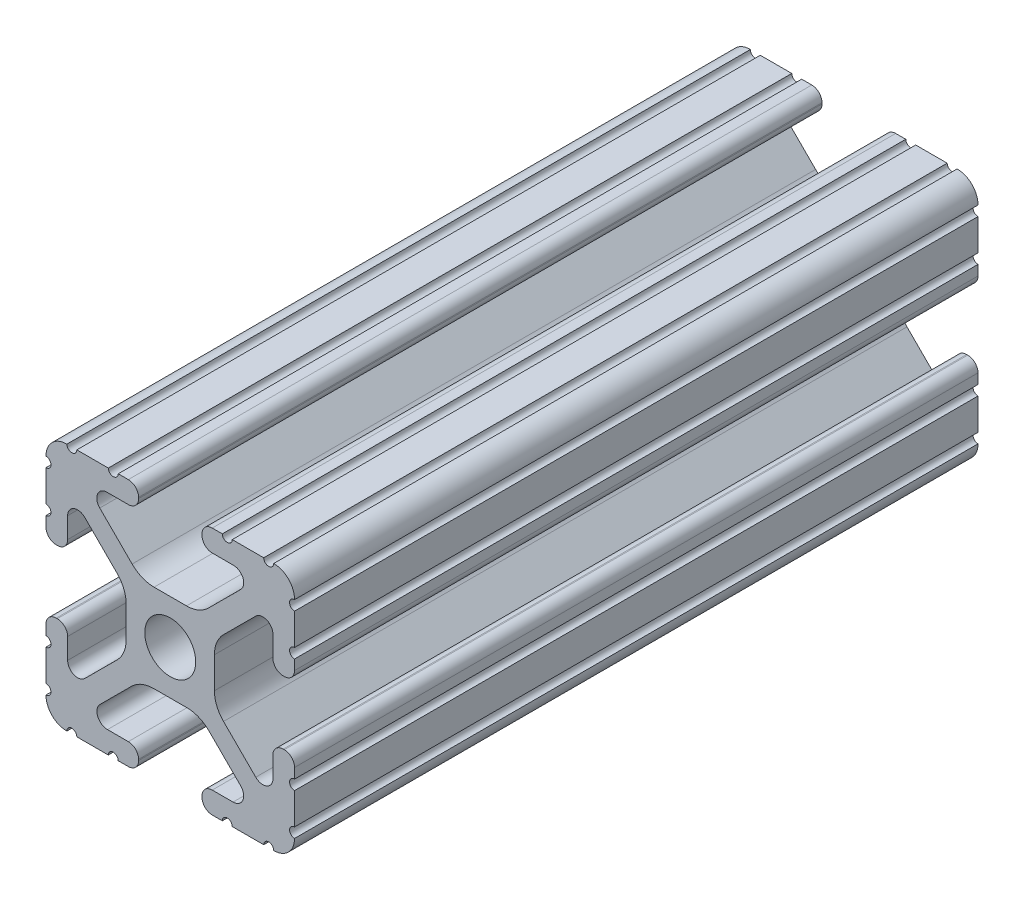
ISO-10303-21;
HEADER;
FILE_DESCRIPTION(('STEP AP214'),'2;1');
FILE_NAME('part.step','',(''),(''),'','','');
FILE_SCHEMA(('AUTOMOTIVE_DESIGN { 1 0 10303 214 1 1 1 1 }'));
ENDSEC;
DATA;
#1=APPLICATION_CONTEXT('core data for automotive mechanical design processes');
#2=APPLICATION_PROTOCOL_DEFINITION('international standard','automotive_design',2000,#1);
#3=PRODUCT_CONTEXT('',#1,'mechanical');
#4=PRODUCT('Part','Part','',(#3));
#5=PRODUCT_RELATED_PRODUCT_CATEGORY('part','',(#4));
#6=PRODUCT_DEFINITION_FORMATION('','',#4);
#7=PRODUCT_DEFINITION_CONTEXT('part definition',#1,'design');
#8=PRODUCT_DEFINITION('design','',#6,#7);
#9=PRODUCT_DEFINITION_SHAPE('','',#8);
#10=(LENGTH_UNIT() NAMED_UNIT(*) SI_UNIT(.MILLI.,.METRE.));
#11=(NAMED_UNIT(*) PLANE_ANGLE_UNIT() SI_UNIT($,.RADIAN.));
#12=(NAMED_UNIT(*) SI_UNIT($,.STERADIAN.) SOLID_ANGLE_UNIT());
#13=UNCERTAINTY_MEASURE_WITH_UNIT(LENGTH_MEASURE(1.E-05),#10,'distance_accuracy_value','');
#14=(GEOMETRIC_REPRESENTATION_CONTEXT(3) GLOBAL_UNCERTAINTY_ASSIGNED_CONTEXT((#13)) GLOBAL_UNIT_ASSIGNED_CONTEXT((#10,
#11,#12)) REPRESENTATION_CONTEXT('',''));
#15=CARTESIAN_POINT('',(0.,0.,0.));
#16=DIRECTION('',(0.,0.,1.));
#17=DIRECTION('',(1.,0.,0.));
#18=AXIS2_PLACEMENT_3D('',#15,#16,#17);
#19=CARTESIAN_POINT('',(-6.41640832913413,-9.40982735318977,34.925));
#20=DIRECTION('',(0.,0.,1.));
#21=DIRECTION('',(1.,0.,0.));
#22=AXIS2_PLACEMENT_3D('',#19,#20,#21);
#23=PLANE('',#22);
#24=CARTESIAN_POINT('',(-6.41640832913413,-9.40982735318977,34.925));
#25=DIRECTION('',(0.,0.,-1.));
#26=DIRECTION('',(1.,0.,0.));
#27=AXIS2_PLACEMENT_3D('',#24,#25,#26);
#28=CIRCLE('',#27,1.08037264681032);
#29=CARTESIAN_POINT('',(-6.41640832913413,-10.4902000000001,34.925));
#30=VERTEX_POINT('',#29);
#31=CARTESIAN_POINT('',(-7.17965049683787,-8.64519250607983,34.925));
#32=VERTEX_POINT('',#31);
#33=EDGE_CURVE('E848',#30,#32,#28,.T.);
#34=ORIENTED_EDGE('',*,*,#33,.T.);
#35=DIRECTION('',(0.707751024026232,0.706461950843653,0.));
#36=VECTOR('',#35,1.);
#37=CARTESIAN_POINT('',(-7.17965049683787,-8.64519250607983,34.925));
#38=LINE('',#37,#36);
#39=CARTESIAN_POINT('',(-3.95227025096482,-5.42369049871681,34.925));
#40=VERTEX_POINT('',#39);
#41=EDGE_CURVE('E356',#32,#40,#38,.T.);
#42=ORIENTED_EDGE('',*,*,#41,.T.);
#43=CARTESIAN_POINT('',(-1.70925355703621,-7.67080000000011,34.925));
#44=DIRECTION('',(0.,0.,-1.));
#45=DIRECTION('',(1.,0.,0.));
#46=AXIS2_PLACEMENT_3D('',#43,#44,#45);
#47=CIRCLE('',#46,3.17500000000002);
#48=CARTESIAN_POINT('',(-1.70925355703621,-4.49580000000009,34.925));
#49=VERTEX_POINT('',#48);
#50=EDGE_CURVE('E1127',#40,#49,#47,.T.);
#51=ORIENTED_EDGE('',*,*,#50,.T.);
#52=DIRECTION('',(1.,0.,0.));
#53=VECTOR('',#52,1.);
#54=CARTESIAN_POINT('',(-1.70925355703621,-4.49580000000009,34.925));
#55=LINE('',#54,#53);
#56=CARTESIAN_POINT('',(1.70925355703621,-4.49580000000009,34.925));
#57=VERTEX_POINT('',#56);
#58=EDGE_CURVE('E1146',#49,#57,#55,.T.);
#59=ORIENTED_EDGE('',*,*,#58,.T.);
#60=CARTESIAN_POINT('',(1.70925355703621,-7.67080000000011,34.925));
#61=DIRECTION('',(0.,0.,-1.));
#62=DIRECTION('',(1.,0.,0.));
#63=AXIS2_PLACEMENT_3D('',#60,#61,#62);
#64=CIRCLE('',#63,3.17500000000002);
#65=CARTESIAN_POINT('',(3.95227025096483,-5.42369049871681,34.925));
#66=VERTEX_POINT('',#65);
#67=EDGE_CURVE('E1143',#57,#66,#64,.T.);
#68=ORIENTED_EDGE('',*,*,#67,.T.);
#69=DIRECTION('',(0.707751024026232,-0.706461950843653,0.));
#70=VECTOR('',#69,1.);
#71=CARTESIAN_POINT('',(3.95227025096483,-5.42369049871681,34.925));
#72=LINE('',#71,#70);
#73=CARTESIAN_POINT('',(7.17965049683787,-8.64519250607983,34.925));
#74=VERTEX_POINT('',#73);
#75=EDGE_CURVE('E1145',#66,#74,#72,.T.);
#76=ORIENTED_EDGE('',*,*,#75,.T.);
#77=CARTESIAN_POINT('',(6.41640832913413,-9.40982735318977,34.925));
#78=DIRECTION('',(0.,0.,-1.));
#79=DIRECTION('',(1.,0.,0.));
#80=AXIS2_PLACEMENT_3D('',#77,#78,#79);
#81=CIRCLE('',#80,1.08037264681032);
#82=CARTESIAN_POINT('',(6.41640832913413,-10.4902000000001,34.925));
#83=VERTEX_POINT('',#82);
#84=EDGE_CURVE('E1148',#74,#83,#81,.T.);
#85=ORIENTED_EDGE('',*,*,#84,.T.);
#86=DIRECTION('',(-1.,0.,0.));
#87=VECTOR('',#86,1.);
#88=CARTESIAN_POINT('',(6.41640832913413,-10.4902000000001,34.925));
#89=LINE('',#88,#87);
#90=CARTESIAN_POINT('',(4.2875124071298,-10.4902000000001,34.925));
#91=VERTEX_POINT('',#90);
#92=EDGE_CURVE('E1154',#83,#91,#89,.T.);
#93=ORIENTED_EDGE('',*,*,#92,.T.);
#94=CARTESIAN_POINT('',(4.2875124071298,-11.5392124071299,34.925));
#95=DIRECTION('',(0.,0.,1.));
#96=DIRECTION('',(1.,0.,0.));
#97=AXIS2_PLACEMENT_3D('',#94,#95,#96);
#98=CIRCLE('',#97,1.04901240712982);
#99=CARTESIAN_POINT('',(3.23849999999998,-11.5392124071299,34.925));
#100=VERTEX_POINT('',#99);
#101=EDGE_CURVE('E1156',#91,#100,#98,.T.);
#102=ORIENTED_EDGE('',*,*,#101,.T.);
#103=DIRECTION('',(0.,-1.,0.));
#104=VECTOR('',#103,1.);
#105=CARTESIAN_POINT('',(3.23849999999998,-11.5392124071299,34.925));
#106=LINE('',#105,#104);
#107=CARTESIAN_POINT('',(3.23849999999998,-11.6509875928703,34.925));
#108=VERTEX_POINT('',#107);
#109=EDGE_CURVE('E1158',#100,#108,#106,.T.);
#110=ORIENTED_EDGE('',*,*,#109,.T.);
#111=CARTESIAN_POINT('',(4.2875124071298,-11.6509875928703,34.925));
#112=DIRECTION('',(0.,0.,1.));
#113=DIRECTION('',(1.,0.,0.));
#114=AXIS2_PLACEMENT_3D('',#111,#112,#113);
#115=CIRCLE('',#114,1.04901240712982);
#116=CARTESIAN_POINT('',(4.2875124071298,-12.7000000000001,34.925));
#117=VERTEX_POINT('',#116);
#118=EDGE_CURVE('E1160',#108,#117,#115,.T.);
#119=ORIENTED_EDGE('',*,*,#118,.T.);
#120=DIRECTION('',(1.,0.,0.));
#121=VECTOR('',#120,1.);
#122=CARTESIAN_POINT('',(4.2875124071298,-12.7000000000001,34.925));
#123=LINE('',#122,#121);
#124=CARTESIAN_POINT('',(5.31712671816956,-12.7000000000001,34.925));
#125=VERTEX_POINT('',#124);
#126=EDGE_CURVE('E1162',#117,#125,#123,.T.);
#127=ORIENTED_EDGE('',*,*,#126,.T.);
#128=CARTESIAN_POINT('',(5.82512671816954,-12.7000000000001,34.925));
#129=DIRECTION('',(0.,0.,-1.));
#130=DIRECTION('',(1.,0.,0.));
#131=AXIS2_PLACEMENT_3D('',#128,#129,#130);
#132=CIRCLE('',#131,0.507999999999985);
#133=CARTESIAN_POINT('',(6.33312671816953,-12.7000000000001,34.925));
#134=VERTEX_POINT('',#133);
#135=EDGE_CURVE('E1164',#125,#134,#132,.T.);
#136=ORIENTED_EDGE('',*,*,#135,.T.);
#137=DIRECTION('',(1.,0.,0.));
#138=VECTOR('',#137,1.);
#139=CARTESIAN_POINT('',(6.33312671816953,-12.7000000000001,34.925));
#140=LINE('',#139,#138);
#141=CARTESIAN_POINT('',(9.55044311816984,-12.7000000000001,34.925));
#142=VERTEX_POINT('',#141);
#143=EDGE_CURVE('E1166',#134,#142,#140,.T.);
#144=ORIENTED_EDGE('',*,*,#143,.T.);
#145=CARTESIAN_POINT('',(10.0584431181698,-12.7000000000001,34.925));
#146=DIRECTION('',(0.,0.,-1.));
#147=DIRECTION('',(1.,0.,0.));
#148=AXIS2_PLACEMENT_3D('',#145,#146,#147);
#149=CIRCLE('',#148,0.507999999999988);
#150=CARTESIAN_POINT('',(10.5664430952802,-12.6998475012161,34.925));
#151=VERTEX_POINT('',#150);
#152=EDGE_CURVE('E1168',#142,#151,#149,.T.);
#153=ORIENTED_EDGE('',*,*,#152,.T.);
#154=CARTESIAN_POINT('',(10.5918000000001,-10.5918000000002,34.925));
#155=DIRECTION('',(0.,0.,1.));
#156=DIRECTION('',(1.,0.,0.));
#157=AXIS2_PLACEMENT_3D('',#154,#155,#156);
#158=CIRCLE('',#157,2.1081999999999);
#159=CARTESIAN_POINT('',(12.699846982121,-10.5663999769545,34.925));
#160=VERTEX_POINT('',#159);
#161=EDGE_CURVE('E1170',#151,#160,#158,.T.);
#162=ORIENTED_EDGE('',*,*,#161,.T.);
#163=CARTESIAN_POINT('',(12.7,-10.0584000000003,34.925));
#164=DIRECTION('',(0.,0.,-1.));
#165=DIRECTION('',(1.,0.,0.));
#166=AXIS2_PLACEMENT_3D('',#163,#164,#165);
#167=CIRCLE('',#166,0.507999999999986);
#168=CARTESIAN_POINT('',(12.7,-9.5504000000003,34.925));
#169=VERTEX_POINT('',#168);
#170=EDGE_CURVE('E1172',#160,#169,#167,.T.);
#171=ORIENTED_EDGE('',*,*,#170,.T.);
#172=DIRECTION('',(0.,1.,0.));
#173=VECTOR('',#172,1.);
#174=CARTESIAN_POINT('',(12.7,-9.5504000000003,34.925));
#175=LINE('',#174,#173);
#176=CARTESIAN_POINT('',(12.7,-6.33308359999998,34.925));
#177=VERTEX_POINT('',#176);
#178=EDGE_CURVE('E1174',#169,#177,#175,.T.);
#179=ORIENTED_EDGE('',*,*,#178,.T.);
#180=CARTESIAN_POINT('',(12.7,-5.8250836,34.925));
#181=DIRECTION('',(0.,0.,-1.));
#182=DIRECTION('',(1.,0.,0.));
#183=AXIS2_PLACEMENT_3D('',#180,#181,#182);
#184=CIRCLE('',#183,0.507999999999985);
#185=CARTESIAN_POINT('',(12.7,-5.31708360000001,34.925));
#186=VERTEX_POINT('',#185);
#187=EDGE_CURVE('E1176',#177,#186,#184,.T.);
#188=ORIENTED_EDGE('',*,*,#187,.T.);
#189=DIRECTION('',(0.,1.,0.));
#190=VECTOR('',#189,1.);
#191=CARTESIAN_POINT('',(12.7,-5.31708360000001,34.925));
#192=LINE('',#191,#190);
#193=CARTESIAN_POINT('',(12.7,-4.28746928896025,34.925));
#194=VERTEX_POINT('',#193);
#195=EDGE_CURVE('E1178',#186,#194,#192,.T.);
#196=ORIENTED_EDGE('',*,*,#195,.T.);
#197=CARTESIAN_POINT('',(11.6509875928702,-4.28746928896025,34.925));
#198=DIRECTION('',(0.,0.,1.));
#199=DIRECTION('',(1.,0.,0.));
#200=AXIS2_PLACEMENT_3D('',#197,#198,#199);
#201=CIRCLE('',#200,1.04901240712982);
#202=CARTESIAN_POINT('',(11.6509875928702,-3.23845688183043,34.925));
#203=VERTEX_POINT('',#202);
#204=EDGE_CURVE('E1180',#194,#203,#201,.T.);
#205=ORIENTED_EDGE('',*,*,#204,.T.);
#206=DIRECTION('',(-1.,0.,0.));
#207=VECTOR('',#206,1.);
#208=CARTESIAN_POINT('',(11.6509875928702,-3.23845688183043,34.925));
#209=LINE('',#208,#207);
#210=CARTESIAN_POINT('',(11.5392124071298,-3.23845688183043,34.925));
#211=VERTEX_POINT('',#210);
#212=EDGE_CURVE('E1182',#203,#211,#209,.T.);
#213=ORIENTED_EDGE('',*,*,#212,.T.);
#214=CARTESIAN_POINT('',(11.5392124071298,-4.28746928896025,34.925));
#215=DIRECTION('',(0.,0.,1.));
#216=DIRECTION('',(1.,0.,0.));
#217=AXIS2_PLACEMENT_3D('',#214,#215,#216);
#218=CIRCLE('',#217,1.04901240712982);
#219=CARTESIAN_POINT('',(10.4902,-4.28746928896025,34.925));
#220=VERTEX_POINT('',#219);
#221=EDGE_CURVE('E1184',#211,#220,#218,.T.);
#222=ORIENTED_EDGE('',*,*,#221,.T.);
#223=DIRECTION('',(0.,-1.,0.));
#224=VECTOR('',#223,1.);
#225=CARTESIAN_POINT('',(10.4902,-4.28746928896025,34.925));
#226=LINE('',#225,#224);
#227=CARTESIAN_POINT('',(10.4902,-6.4020890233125,34.925));
#228=VERTEX_POINT('',#227);
#229=EDGE_CURVE('E1186',#220,#228,#226,.T.);
#230=ORIENTED_EDGE('',*,*,#229,.T.);
#231=CARTESIAN_POINT('',(9.4627890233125,-6.4020890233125,34.925));
#232=DIRECTION('',(0.,0.,-1.));
#233=DIRECTION('',(1.,0.,0.));
#234=AXIS2_PLACEMENT_3D('',#231,#232,#233);
#235=CIRCLE('',#234,1.0274109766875);
#236=CARTESIAN_POINT('',(8.7371313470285,-7.12940893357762,34.925));
#237=VERTEX_POINT('',#236);
#238=EDGE_CURVE('E1188',#228,#237,#235,.T.);
#239=ORIENTED_EDGE('',*,*,#238,.T.);
#240=DIRECTION('',(-0.70791526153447,0.706297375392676,0.));
#241=VECTOR('',#240,1.);
#242=CARTESIAN_POINT('',(8.7371313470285,-7.12940893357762,34.925));
#243=LINE('',#242,#241);
#244=CARTESIAN_POINT('',(5.44100583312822,-3.84081646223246,34.925));
#245=VERTEX_POINT('',#244);
#246=EDGE_CURVE('E1190',#237,#245,#243,.T.);
#247=ORIENTED_EDGE('',*,*,#246,.T.);
#248=CARTESIAN_POINT('',(7.68350000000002,-1.59318550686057,34.925));
#249=DIRECTION('',(0.,0.,-1.));
#250=DIRECTION('',(1.,0.,0.));
#251=AXIS2_PLACEMENT_3D('',#248,#249,#250);
#252=CIRCLE('',#251,3.17500000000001);
#253=CARTESIAN_POINT('',(4.50850000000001,-1.59318550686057,34.925));
#254=VERTEX_POINT('',#253);
#255=EDGE_CURVE('E1192',#245,#254,#252,.T.);
#256=ORIENTED_EDGE('',*,*,#255,.T.);
#257=DIRECTION('',(0.,1.,0.));
#258=VECTOR('',#257,1.);
#259=CARTESIAN_POINT('',(4.5085,-1.59318550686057,34.925));
#260=LINE('',#259,#258);
#261=CARTESIAN_POINT('',(4.50850000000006,1.59318550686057,34.925));
#262=VERTEX_POINT('',#261);
#263=EDGE_CURVE('E1194',#254,#262,#260,.T.);
#264=ORIENTED_EDGE('',*,*,#263,.T.);
#265=CARTESIAN_POINT('',(7.68350000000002,1.59318550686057,34.925));
#266=DIRECTION('',(0.,0.,-1.));
#267=DIRECTION('',(1.,0.,0.));
#268=AXIS2_PLACEMENT_3D('',#265,#266,#267);
#269=CIRCLE('',#268,3.17499999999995);
#270=CARTESIAN_POINT('',(5.44100583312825,3.84081646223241,34.925));
#271=VERTEX_POINT('',#270);
#272=EDGE_CURVE('E1196',#262,#271,#269,.T.);
#273=ORIENTED_EDGE('',*,*,#272,.T.);
#274=DIRECTION('',(0.70791526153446,0.706297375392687,0.));
#275=VECTOR('',#274,1.);
#276=CARTESIAN_POINT('',(5.44100583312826,3.8408164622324,34.925));
#277=LINE('',#276,#275);
#278=CARTESIAN_POINT('',(8.73713134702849,7.12940893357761,34.925));
#279=VERTEX_POINT('',#278);
#280=EDGE_CURVE('E1198',#271,#279,#277,.T.);
#281=ORIENTED_EDGE('',*,*,#280,.T.);
#282=CARTESIAN_POINT('',(9.4627890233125,6.4020890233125,34.925));
#283=DIRECTION('',(0.,0.,-1.));
#284=DIRECTION('',(1.,0.,0.));
#285=AXIS2_PLACEMENT_3D('',#282,#283,#284);
#286=CIRCLE('',#285,1.0274109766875);
#287=CARTESIAN_POINT('',(10.4902,6.4020890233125,34.925));
#288=VERTEX_POINT('',#287);
#289=EDGE_CURVE('E1200',#279,#288,#286,.T.);
#290=ORIENTED_EDGE('',*,*,#289,.T.);
#291=DIRECTION('',(0.,-1.,0.));
#292=VECTOR('',#291,1.);
#293=CARTESIAN_POINT('',(10.4902,6.4020890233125,34.925));
#294=LINE('',#293,#292);
#295=CARTESIAN_POINT('',(10.4902,4.28746928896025,34.925));
#296=VERTEX_POINT('',#295);
#297=EDGE_CURVE('E1202',#288,#296,#294,.T.);
#298=ORIENTED_EDGE('',*,*,#297,.T.);
#299=CARTESIAN_POINT('',(11.5392124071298,4.28746928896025,34.925));
#300=DIRECTION('',(0.,0.,1.));
#301=DIRECTION('',(1.,0.,0.));
#302=AXIS2_PLACEMENT_3D('',#299,#300,#301);
#303=CIRCLE('',#302,1.04901240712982);
#304=CARTESIAN_POINT('',(11.5392124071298,3.23845688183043,34.925));
#305=VERTEX_POINT('',#304);
#306=EDGE_CURVE('E1204',#296,#305,#303,.T.);
#307=ORIENTED_EDGE('',*,*,#306,.T.);
#308=DIRECTION('',(1.,0.,0.));
#309=VECTOR('',#308,1.);
#310=CARTESIAN_POINT('',(11.5392124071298,3.23845688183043,34.925));
#311=LINE('',#310,#309);
#312=CARTESIAN_POINT('',(11.6509875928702,3.23845688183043,34.925));
#313=VERTEX_POINT('',#312);
#314=EDGE_CURVE('E1206',#305,#313,#311,.T.);
#315=ORIENTED_EDGE('',*,*,#314,.T.);
#316=CARTESIAN_POINT('',(11.6509875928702,4.28746928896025,34.925));
#317=DIRECTION('',(0.,0.,1.));
#318=DIRECTION('',(1.,0.,0.));
#319=AXIS2_PLACEMENT_3D('',#316,#317,#318);
#320=CIRCLE('',#319,1.04901240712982);
#321=CARTESIAN_POINT('',(12.7,4.28746928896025,34.925));
#322=VERTEX_POINT('',#321);
#323=EDGE_CURVE('E1208',#313,#322,#320,.T.);
#324=ORIENTED_EDGE('',*,*,#323,.T.);
#325=DIRECTION('',(0.,1.,0.));
#326=VECTOR('',#325,1.);
#327=CARTESIAN_POINT('',(12.7,4.28746928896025,34.925));
#328=LINE('',#327,#326);
#329=CARTESIAN_POINT('',(12.7,5.31708360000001,34.925));
#330=VERTEX_POINT('',#329);
#331=EDGE_CURVE('E1210',#322,#330,#328,.T.);
#332=ORIENTED_EDGE('',*,*,#331,.T.);
#333=CARTESIAN_POINT('',(12.7,5.8250836,34.925));
#334=DIRECTION('',(0.,0.,-1.));
#335=DIRECTION('',(1.,0.,0.));
#336=AXIS2_PLACEMENT_3D('',#333,#334,#335);
#337=CIRCLE('',#336,0.507999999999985);
#338=CARTESIAN_POINT('',(12.7,6.33308359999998,34.925));
#339=VERTEX_POINT('',#338);
#340=EDGE_CURVE('E1212',#330,#339,#337,.T.);
#341=ORIENTED_EDGE('',*,*,#340,.T.);
#342=DIRECTION('',(0.,1.,0.));
#343=VECTOR('',#342,1.);
#344=CARTESIAN_POINT('',(12.7,6.33308359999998,34.925));
#345=LINE('',#344,#343);
#346=CARTESIAN_POINT('',(12.7,9.55040000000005,34.925));
#347=VERTEX_POINT('',#346);
#348=EDGE_CURVE('E1214',#339,#347,#345,.T.);
#349=ORIENTED_EDGE('',*,*,#348,.T.);
#350=CARTESIAN_POINT('',(12.7,10.0584000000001,34.925));
#351=DIRECTION('',(0.,0.,-1.));
#352=DIRECTION('',(1.,0.,0.));
#353=AXIS2_PLACEMENT_3D('',#350,#351,#352);
#354=CIRCLE('',#353,0.508000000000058);
#355=CARTESIAN_POINT('',(12.699846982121,10.5663999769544,34.925));
#356=VERTEX_POINT('',#355);
#357=EDGE_CURVE('E1216',#347,#356,#354,.T.);
#358=ORIENTED_EDGE('',*,*,#357,.T.);
#359=CARTESIAN_POINT('',(10.5918000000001,10.5918000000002,34.925));
#360=DIRECTION('',(0.,0.,1.));
#361=DIRECTION('',(1.,0.,0.));
#362=AXIS2_PLACEMENT_3D('',#359,#360,#361);
#363=CIRCLE('',#362,2.1081999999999);
#364=CARTESIAN_POINT('',(10.5664430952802,12.6998475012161,34.925));
#365=VERTEX_POINT('',#364);
#366=EDGE_CURVE('E1218',#356,#365,#363,.T.);
#367=ORIENTED_EDGE('',*,*,#366,.T.);
#368=CARTESIAN_POINT('',(10.0584431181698,12.7000000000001,34.925));
#369=DIRECTION('',(0.,0.,-1.));
#370=DIRECTION('',(1.,0.,0.));
#371=AXIS2_PLACEMENT_3D('',#368,#369,#370);
#372=CIRCLE('',#371,0.507999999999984);
#373=CARTESIAN_POINT('',(9.55044311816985,12.7000000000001,34.925));
#374=VERTEX_POINT('',#373);
#375=EDGE_CURVE('E1220',#365,#374,#372,.T.);
#376=ORIENTED_EDGE('',*,*,#375,.T.);
#377=DIRECTION('',(-1.,0.,0.));
#378=VECTOR('',#377,1.);
#379=CARTESIAN_POINT('',(9.55044311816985,12.7000000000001,34.925));
#380=LINE('',#379,#378);
#381=CARTESIAN_POINT('',(6.33312671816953,12.7000000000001,34.925));
#382=VERTEX_POINT('',#381);
#383=EDGE_CURVE('E1222',#374,#382,#380,.T.);
#384=ORIENTED_EDGE('',*,*,#383,.T.);
#385=CARTESIAN_POINT('',(5.82512671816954,12.7000000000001,34.925));
#386=DIRECTION('',(0.,0.,-1.));
#387=DIRECTION('',(1.,0.,0.));
#388=AXIS2_PLACEMENT_3D('',#385,#386,#387);
#389=CIRCLE('',#388,0.507999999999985);
#390=CARTESIAN_POINT('',(5.31712671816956,12.7000000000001,34.925));
#391=VERTEX_POINT('',#390);
#392=EDGE_CURVE('E1224',#382,#391,#389,.T.);
#393=ORIENTED_EDGE('',*,*,#392,.T.);
#394=DIRECTION('',(-1.,0.,0.));
#395=VECTOR('',#394,1.);
#396=CARTESIAN_POINT('',(5.31712671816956,12.7000000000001,34.925));
#397=LINE('',#396,#395);
#398=CARTESIAN_POINT('',(4.2875124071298,12.7000000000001,34.925));
#399=VERTEX_POINT('',#398);
#400=EDGE_CURVE('E1226',#391,#399,#397,.T.);
#401=ORIENTED_EDGE('',*,*,#400,.T.);
#402=CARTESIAN_POINT('',(4.2875124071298,11.6509875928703,34.925));
#403=DIRECTION('',(0.,0.,1.));
#404=DIRECTION('',(1.,0.,0.));
#405=AXIS2_PLACEMENT_3D('',#402,#403,#404);
#406=CIRCLE('',#405,1.04901240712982);
#407=CARTESIAN_POINT('',(3.23849999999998,11.6509875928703,34.925));
#408=VERTEX_POINT('',#407);
#409=EDGE_CURVE('E1228',#399,#408,#406,.T.);
#410=ORIENTED_EDGE('',*,*,#409,.T.);
#411=DIRECTION('',(0.,-1.,0.));
#412=VECTOR('',#411,1.);
#413=CARTESIAN_POINT('',(3.23849999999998,11.6509875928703,34.925));
#414=LINE('',#413,#412);
#415=CARTESIAN_POINT('',(3.23849999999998,11.5392124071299,34.925));
#416=VERTEX_POINT('',#415);
#417=EDGE_CURVE('E1230',#408,#416,#414,.T.);
#418=ORIENTED_EDGE('',*,*,#417,.T.);
#419=CARTESIAN_POINT('',(4.2875124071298,11.5392124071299,34.925));
#420=DIRECTION('',(0.,0.,1.));
#421=DIRECTION('',(1.,0.,0.));
#422=AXIS2_PLACEMENT_3D('',#419,#420,#421);
#423=CIRCLE('',#422,1.04901240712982);
#424=CARTESIAN_POINT('',(4.2875124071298,10.4902000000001,34.925));
#425=VERTEX_POINT('',#424);
#426=EDGE_CURVE('E1232',#416,#425,#423,.T.);
#427=ORIENTED_EDGE('',*,*,#426,.T.);
#428=DIRECTION('',(1.,0.,0.));
#429=VECTOR('',#428,1.);
#430=CARTESIAN_POINT('',(4.2875124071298,10.4902000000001,34.925));
#431=LINE('',#430,#429);
#432=CARTESIAN_POINT('',(6.47678859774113,10.4902000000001,34.925));
#433=VERTEX_POINT('',#432);
#434=EDGE_CURVE('E1234',#425,#433,#431,.T.);
#435=ORIENTED_EDGE('',*,*,#434,.T.);
#436=CARTESIAN_POINT('',(6.47678859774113,9.45629072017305,34.925));
#437=DIRECTION('',(0.,0.,-1.));
#438=DIRECTION('',(1.,0.,0.));
#439=AXIS2_PLACEMENT_3D('',#436,#437,#438);
#440=CIRCLE('',#439,1.03390927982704);
#441=CARTESIAN_POINT('',(7.2070360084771,8.72437056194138,34.925));
#442=VERTEX_POINT('',#441);
#443=EDGE_CURVE('E1236',#433,#442,#440,.T.);
#444=ORIENTED_EDGE('',*,*,#443,.T.);
#445=DIRECTION('',(-0.707915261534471,-0.706297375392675,0.));
#446=VECTOR('',#445,1.);
#447=CARTESIAN_POINT('',(7.2070360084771,8.72437056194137,34.925));
#448=LINE('',#447,#446);
#449=CARTESIAN_POINT('',(3.89827256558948,5.42316904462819,34.925));
#450=VERTEX_POINT('',#449);
#451=EDGE_CURVE('E1238',#442,#450,#448,.T.);
#452=ORIENTED_EDGE('',*,*,#451,.T.);
#453=CARTESIAN_POINT('',(1.65577839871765,7.67080000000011,34.925));
#454=DIRECTION('',(0.,0.,-1.));
#455=DIRECTION('',(1.,0.,0.));
#456=AXIS2_PLACEMENT_3D('',#453,#454,#455);
#457=CIRCLE('',#456,3.17500000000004);
#458=CARTESIAN_POINT('',(1.65577839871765,4.49580000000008,34.925));
#459=VERTEX_POINT('',#458);
#460=EDGE_CURVE('E1240',#450,#459,#457,.T.);
#461=ORIENTED_EDGE('',*,*,#460,.T.);
#462=DIRECTION('',(-1.,0.,0.));
#463=VECTOR('',#462,1.);
#464=CARTESIAN_POINT('',(1.65577839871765,4.49580000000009,34.925));
#465=LINE('',#464,#463);
#466=CARTESIAN_POINT('',(-1.65577839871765,4.49580000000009,34.925));
#467=VERTEX_POINT('',#466);
#468=EDGE_CURVE('E1242',#459,#467,#465,.T.);
#469=ORIENTED_EDGE('',*,*,#468,.T.);
#470=CARTESIAN_POINT('',(-1.65577839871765,7.67080000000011,34.925));
#471=DIRECTION('',(0.,0.,-1.));
#472=DIRECTION('',(1.,0.,0.));
#473=AXIS2_PLACEMENT_3D('',#470,#471,#472);
#474=CIRCLE('',#473,3.17500000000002);
#475=CARTESIAN_POINT('',(-3.89827256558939,5.42316904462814,34.925));
#476=VERTEX_POINT('',#475);
#477=EDGE_CURVE('E1244',#467,#476,#474,.T.);
#478=ORIENTED_EDGE('',*,*,#477,.T.);
#479=DIRECTION('',(-0.707915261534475,0.706297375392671,0.));
#480=VECTOR('',#479,1.);
#481=CARTESIAN_POINT('',(-3.89827256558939,5.42316904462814,34.925));
#482=LINE('',#481,#480);
#483=CARTESIAN_POINT('',(-7.20703600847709,8.72437056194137,34.925));
#484=VERTEX_POINT('',#483);
#485=EDGE_CURVE('E1246',#476,#484,#482,.T.);
#486=ORIENTED_EDGE('',*,*,#485,.T.);
#487=CARTESIAN_POINT('',(-6.47678859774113,9.45629072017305,34.925));
#488=DIRECTION('',(0.,0.,-1.));
#489=DIRECTION('',(1.,0.,0.));
#490=AXIS2_PLACEMENT_3D('',#487,#488,#489);
#491=CIRCLE('',#490,1.03390927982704);
#492=CARTESIAN_POINT('',(-6.47678859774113,10.4902000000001,34.925));
#493=VERTEX_POINT('',#492);
#494=EDGE_CURVE('E1248',#484,#493,#491,.T.);
#495=ORIENTED_EDGE('',*,*,#494,.T.);
#496=DIRECTION('',(1.,0.,0.));
#497=VECTOR('',#496,1.);
#498=CARTESIAN_POINT('',(-6.47678859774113,10.4902000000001,34.925));
#499=LINE('',#498,#497);
#500=CARTESIAN_POINT('',(-4.2875124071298,10.4902000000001,34.925));
#501=VERTEX_POINT('',#500);
#502=EDGE_CURVE('E1250',#493,#501,#499,.T.);
#503=ORIENTED_EDGE('',*,*,#502,.T.);
#504=CARTESIAN_POINT('',(-4.2875124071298,11.5392124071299,34.925));
#505=DIRECTION('',(0.,0.,1.));
#506=DIRECTION('',(1.,0.,0.));
#507=AXIS2_PLACEMENT_3D('',#504,#505,#506);
#508=CIRCLE('',#507,1.04901240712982);
#509=CARTESIAN_POINT('',(-3.23849999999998,11.5392124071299,34.925));
#510=VERTEX_POINT('',#509);
#511=EDGE_CURVE('E1252',#501,#510,#508,.T.);
#512=ORIENTED_EDGE('',*,*,#511,.T.);
#513=DIRECTION('',(0.,1.,0.));
#514=VECTOR('',#513,1.);
#515=CARTESIAN_POINT('',(-3.23849999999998,11.5392124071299,34.925));
#516=LINE('',#515,#514);
#517=CARTESIAN_POINT('',(-3.23849999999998,11.6509875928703,34.925));
#518=VERTEX_POINT('',#517);
#519=EDGE_CURVE('E1254',#510,#518,#516,.T.);
#520=ORIENTED_EDGE('',*,*,#519,.T.);
#521=CARTESIAN_POINT('',(-4.2875124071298,11.6509875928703,34.925));
#522=DIRECTION('',(0.,0.,1.));
#523=DIRECTION('',(1.,0.,0.));
#524=AXIS2_PLACEMENT_3D('',#521,#522,#523);
#525=CIRCLE('',#524,1.04901240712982);
#526=CARTESIAN_POINT('',(-4.2875124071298,12.7000000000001,34.925));
#527=VERTEX_POINT('',#526);
#528=EDGE_CURVE('E1256',#518,#527,#525,.T.);
#529=ORIENTED_EDGE('',*,*,#528,.T.);
#530=DIRECTION('',(-1.,0.,0.));
#531=VECTOR('',#530,1.);
#532=CARTESIAN_POINT('',(-4.2875124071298,12.7000000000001,34.925));
#533=LINE('',#532,#531);
#534=CARTESIAN_POINT('',(-5.31712671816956,12.7000000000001,34.925));
#535=VERTEX_POINT('',#534);
#536=EDGE_CURVE('E1258',#527,#535,#533,.T.);
#537=ORIENTED_EDGE('',*,*,#536,.T.);
#538=CARTESIAN_POINT('',(-5.82512671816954,12.7000000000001,34.925));
#539=DIRECTION('',(0.,0.,-1.));
#540=DIRECTION('',(1.,0.,0.));
#541=AXIS2_PLACEMENT_3D('',#538,#539,#540);
#542=CIRCLE('',#541,0.507999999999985);
#543=CARTESIAN_POINT('',(-6.33312671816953,12.7000000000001,34.925));
#544=VERTEX_POINT('',#543);
#545=EDGE_CURVE('E1260',#535,#544,#542,.T.);
#546=ORIENTED_EDGE('',*,*,#545,.T.);
#547=DIRECTION('',(-1.,0.,0.));
#548=VECTOR('',#547,1.);
#549=CARTESIAN_POINT('',(-6.33312671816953,12.7000000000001,34.925));
#550=LINE('',#549,#548);
#551=CARTESIAN_POINT('',(-9.55044311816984,12.7000000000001,34.925));
#552=VERTEX_POINT('',#551);
#553=EDGE_CURVE('E1262',#544,#552,#550,.T.);
#554=ORIENTED_EDGE('',*,*,#553,.T.);
#555=CARTESIAN_POINT('',(-10.0584431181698,12.7000000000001,34.925));
#556=DIRECTION('',(0.,0.,-1.));
#557=DIRECTION('',(1.,0.,0.));
#558=AXIS2_PLACEMENT_3D('',#555,#556,#557);
#559=CIRCLE('',#558,0.507999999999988);
#560=CARTESIAN_POINT('',(-10.5664430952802,12.6998475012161,34.925));
#561=VERTEX_POINT('',#560);
#562=EDGE_CURVE('E1264',#552,#561,#559,.T.);
#563=ORIENTED_EDGE('',*,*,#562,.T.);
#564=CARTESIAN_POINT('',(-10.5918000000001,10.5918000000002,34.925));
#565=DIRECTION('',(0.,0.,1.));
#566=DIRECTION('',(1.,0.,0.));
#567=AXIS2_PLACEMENT_3D('',#564,#565,#566);
#568=CIRCLE('',#567,2.1081999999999);
#569=CARTESIAN_POINT('',(-12.699846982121,10.5663999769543,34.925));
#570=VERTEX_POINT('',#569);
#571=EDGE_CURVE('E1266',#561,#570,#568,.T.);
#572=ORIENTED_EDGE('',*,*,#571,.T.);
#573=CARTESIAN_POINT('',(-12.7,10.0584000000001,34.925));
#574=DIRECTION('',(0.,0.,-1.));
#575=DIRECTION('',(1.,0.,0.));
#576=AXIS2_PLACEMENT_3D('',#573,#574,#575);
#577=CIRCLE('',#576,0.50799999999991);
#578=CARTESIAN_POINT('',(-12.7,9.55040000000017,34.925));
#579=VERTEX_POINT('',#578);
#580=EDGE_CURVE('E1268',#570,#579,#577,.T.);
#581=ORIENTED_EDGE('',*,*,#580,.T.);
#582=DIRECTION('',(0.,-1.,0.));
#583=VECTOR('',#582,1.);
#584=CARTESIAN_POINT('',(-12.7,9.5504000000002,34.925));
#585=LINE('',#584,#583);
#586=CARTESIAN_POINT('',(-12.7,6.33308359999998,34.925));
#587=VERTEX_POINT('',#586);
#588=EDGE_CURVE('E1270',#579,#587,#585,.T.);
#589=ORIENTED_EDGE('',*,*,#588,.T.);
#590=CARTESIAN_POINT('',(-12.7,5.8250836,34.925));
#591=DIRECTION('',(0.,0.,-1.));
#592=DIRECTION('',(1.,0.,0.));
#593=AXIS2_PLACEMENT_3D('',#590,#591,#592);
#594=CIRCLE('',#593,0.507999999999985);
#595=CARTESIAN_POINT('',(-12.7,5.31708360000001,34.925));
#596=VERTEX_POINT('',#595);
#597=EDGE_CURVE('E1272',#587,#596,#594,.T.);
#598=ORIENTED_EDGE('',*,*,#597,.T.);
#599=DIRECTION('',(0.,-1.,0.));
#600=VECTOR('',#599,1.);
#601=CARTESIAN_POINT('',(-12.7,5.31708360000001,34.925));
#602=LINE('',#601,#600);
#603=CARTESIAN_POINT('',(-12.7,4.28746928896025,34.925));
#604=VERTEX_POINT('',#603);
#605=EDGE_CURVE('E1274',#596,#604,#602,.T.);
#606=ORIENTED_EDGE('',*,*,#605,.T.);
#607=CARTESIAN_POINT('',(-11.6509875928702,4.28746928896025,34.925));
#608=DIRECTION('',(0.,0.,1.));
#609=DIRECTION('',(1.,0.,0.));
#610=AXIS2_PLACEMENT_3D('',#607,#608,#609);
#611=CIRCLE('',#610,1.04901240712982);
#612=CARTESIAN_POINT('',(-11.6509875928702,3.23845688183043,34.925));
#613=VERTEX_POINT('',#612);
#614=EDGE_CURVE('E1276',#604,#613,#611,.T.);
#615=ORIENTED_EDGE('',*,*,#614,.T.);
#616=DIRECTION('',(1.,0.,0.));
#617=VECTOR('',#616,1.);
#618=CARTESIAN_POINT('',(-11.6509875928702,3.23845688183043,34.925));
#619=LINE('',#618,#617);
#620=CARTESIAN_POINT('',(-11.5392124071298,3.23845688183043,34.925));
#621=VERTEX_POINT('',#620);
#622=EDGE_CURVE('E1278',#613,#621,#619,.T.);
#623=ORIENTED_EDGE('',*,*,#622,.T.);
#624=CARTESIAN_POINT('',(-11.5392124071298,4.28746928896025,34.925));
#625=DIRECTION('',(0.,0.,1.));
#626=DIRECTION('',(1.,0.,0.));
#627=AXIS2_PLACEMENT_3D('',#624,#625,#626);
#628=CIRCLE('',#627,1.04901240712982);
#629=CARTESIAN_POINT('',(-10.4902,4.28746928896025,34.925));
#630=VERTEX_POINT('',#629);
#631=EDGE_CURVE('E1280',#621,#630,#628,.T.);
#632=ORIENTED_EDGE('',*,*,#631,.T.);
#633=DIRECTION('',(0.,1.,0.));
#634=VECTOR('',#633,1.);
#635=CARTESIAN_POINT('',(-10.4902,4.28746928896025,34.925));
#636=LINE('',#635,#634);
#637=CARTESIAN_POINT('',(-10.4902,6.4020890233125,34.925));
#638=VERTEX_POINT('',#637);
#639=EDGE_CURVE('E1282',#630,#638,#636,.T.);
#640=ORIENTED_EDGE('',*,*,#639,.T.);
#641=CARTESIAN_POINT('',(-9.4627890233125,6.4020890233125,34.925));
#642=DIRECTION('',(0.,0.,-1.));
#643=DIRECTION('',(1.,0.,0.));
#644=AXIS2_PLACEMENT_3D('',#641,#642,#643);
#645=CIRCLE('',#644,1.0274109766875);
#646=CARTESIAN_POINT('',(-8.73713134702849,7.12940893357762,34.925));
#647=VERTEX_POINT('',#646);
#648=EDGE_CURVE('E1284',#638,#647,#645,.T.);
#649=ORIENTED_EDGE('',*,*,#648,.T.);
#650=DIRECTION('',(0.707915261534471,-0.706297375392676,0.));
#651=VECTOR('',#650,1.);
#652=CARTESIAN_POINT('',(-8.73713134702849,7.12940893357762,34.925));
#653=LINE('',#652,#651);
#654=CARTESIAN_POINT('',(-5.44100583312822,3.84081646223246,34.925));
#655=VERTEX_POINT('',#654);
#656=EDGE_CURVE('E1286',#647,#655,#653,.T.);
#657=ORIENTED_EDGE('',*,*,#656,.T.);
#658=CARTESIAN_POINT('',(-7.68350000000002,1.59318550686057,34.925));
#659=DIRECTION('',(0.,0.,-1.));
#660=DIRECTION('',(1.,0.,0.));
#661=AXIS2_PLACEMENT_3D('',#658,#659,#660);
#662=CIRCLE('',#661,3.17500000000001);
#663=CARTESIAN_POINT('',(-4.50850000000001,1.59318550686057,34.925));
#664=VERTEX_POINT('',#663);
#665=EDGE_CURVE('E1288',#655,#664,#662,.T.);
#666=ORIENTED_EDGE('',*,*,#665,.T.);
#667=DIRECTION('',(0.,-1.,0.));
#668=VECTOR('',#667,1.);
#669=CARTESIAN_POINT('',(-4.5085,1.59318550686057,34.925));
#670=LINE('',#669,#668);
#671=CARTESIAN_POINT('',(-4.5085,-1.59318550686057,34.925));
#672=VERTEX_POINT('',#671);
#673=EDGE_CURVE('E1290',#664,#672,#670,.T.);
#674=ORIENTED_EDGE('',*,*,#673,.T.);
#675=CARTESIAN_POINT('',(-7.68350000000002,-1.59318550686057,34.925));
#676=DIRECTION('',(0.,0.,-1.));
#677=DIRECTION('',(1.,0.,0.));
#678=AXIS2_PLACEMENT_3D('',#675,#676,#677);
#679=CIRCLE('',#678,3.17500000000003);
#680=CARTESIAN_POINT('',(-5.44100583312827,-3.84081646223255,34.925));
#681=VERTEX_POINT('',#680);
#682=EDGE_CURVE('E1292',#672,#681,#679,.T.);
#683=ORIENTED_EDGE('',*,*,#682,.T.);
#684=DIRECTION('',(-0.707915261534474,-0.706297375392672,0.));
#685=VECTOR('',#684,1.);
#686=CARTESIAN_POINT('',(-5.44100583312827,-3.84081646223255,34.925));
#687=LINE('',#686,#685);
#688=CARTESIAN_POINT('',(-8.7371313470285,-7.12940893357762,34.925));
#689=VERTEX_POINT('',#688);
#690=EDGE_CURVE('E1294',#681,#689,#687,.T.);
#691=ORIENTED_EDGE('',*,*,#690,.T.);
#692=CARTESIAN_POINT('',(-9.4627890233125,-6.4020890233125,34.925));
#693=DIRECTION('',(0.,0.,-1.));
#694=DIRECTION('',(1.,0.,0.));
#695=AXIS2_PLACEMENT_3D('',#692,#693,#694);
#696=CIRCLE('',#695,1.0274109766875);
#697=CARTESIAN_POINT('',(-10.4902,-6.4020890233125,34.925));
#698=VERTEX_POINT('',#697);
#699=EDGE_CURVE('E1296',#689,#698,#696,.T.);
#700=ORIENTED_EDGE('',*,*,#699,.T.);
#701=DIRECTION('',(0.,1.,0.));
#702=VECTOR('',#701,1.);
#703=CARTESIAN_POINT('',(-10.4902,-6.4020890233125,34.925));
#704=LINE('',#703,#702);
#705=CARTESIAN_POINT('',(-10.4902,-4.28746928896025,34.925));
#706=VERTEX_POINT('',#705);
#707=EDGE_CURVE('E1298',#698,#706,#704,.T.);
#708=ORIENTED_EDGE('',*,*,#707,.T.);
#709=CARTESIAN_POINT('',(-11.5392124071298,-4.28746928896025,34.925));
#710=DIRECTION('',(0.,0.,1.));
#711=DIRECTION('',(1.,0.,0.));
#712=AXIS2_PLACEMENT_3D('',#709,#710,#711);
#713=CIRCLE('',#712,1.04901240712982);
#714=CARTESIAN_POINT('',(-11.5392124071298,-3.23845688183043,34.925));
#715=VERTEX_POINT('',#714);
#716=EDGE_CURVE('E1300',#706,#715,#713,.T.);
#717=ORIENTED_EDGE('',*,*,#716,.T.);
#718=DIRECTION('',(-1.,0.,0.));
#719=VECTOR('',#718,1.);
#720=CARTESIAN_POINT('',(-11.5392124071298,-3.23845688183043,34.925));
#721=LINE('',#720,#719);
#722=CARTESIAN_POINT('',(-11.6509875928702,-3.23845688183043,34.925));
#723=VERTEX_POINT('',#722);
#724=EDGE_CURVE('E1302',#715,#723,#721,.T.);
#725=ORIENTED_EDGE('',*,*,#724,.T.);
#726=CARTESIAN_POINT('',(-11.6509875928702,-4.28746928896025,34.925));
#727=DIRECTION('',(0.,0.,1.));
#728=DIRECTION('',(1.,0.,0.));
#729=AXIS2_PLACEMENT_3D('',#726,#727,#728);
#730=CIRCLE('',#729,1.04901240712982);
#731=CARTESIAN_POINT('',(-12.7,-4.28746928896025,34.925));
#732=VERTEX_POINT('',#731);
#733=EDGE_CURVE('E1304',#723,#732,#730,.T.);
#734=ORIENTED_EDGE('',*,*,#733,.T.);
#735=DIRECTION('',(0.,-1.,0.));
#736=VECTOR('',#735,1.);
#737=CARTESIAN_POINT('',(-12.7,-4.28746928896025,34.925));
#738=LINE('',#737,#736);
#739=CARTESIAN_POINT('',(-12.7,-5.31708360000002,34.925));
#740=VERTEX_POINT('',#739);
#741=EDGE_CURVE('E1306',#732,#740,#738,.T.);
#742=ORIENTED_EDGE('',*,*,#741,.T.);
#743=CARTESIAN_POINT('',(-12.7,-5.8250836,34.925));
#744=DIRECTION('',(0.,0.,-1.));
#745=DIRECTION('',(1.,0.,0.));
#746=AXIS2_PLACEMENT_3D('',#743,#744,#745);
#747=CIRCLE('',#746,0.507999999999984);
#748=CARTESIAN_POINT('',(-12.7,-6.33308359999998,34.925));
#749=VERTEX_POINT('',#748);
#750=EDGE_CURVE('E1308',#740,#749,#747,.T.);
#751=ORIENTED_EDGE('',*,*,#750,.T.);
#752=DIRECTION('',(0.,-1.,0.));
#753=VECTOR('',#752,1.);
#754=CARTESIAN_POINT('',(-12.7,-6.33308359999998,34.925));
#755=LINE('',#754,#753);
#756=CARTESIAN_POINT('',(-12.7,-9.5504000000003,34.925));
#757=VERTEX_POINT('',#756);
#758=EDGE_CURVE('E1310',#749,#757,#755,.T.);
#759=ORIENTED_EDGE('',*,*,#758,.T.);
#760=CARTESIAN_POINT('',(-12.7,-10.0584000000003,34.925));
#761=DIRECTION('',(0.,0.,-1.));
#762=DIRECTION('',(1.,0.,0.));
#763=AXIS2_PLACEMENT_3D('',#760,#761,#762);
#764=CIRCLE('',#763,0.507999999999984);
#765=CARTESIAN_POINT('',(-12.699846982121,-10.5663999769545,34.925));
#766=VERTEX_POINT('',#765);
#767=EDGE_CURVE('E1312',#757,#766,#764,.T.);
#768=ORIENTED_EDGE('',*,*,#767,.T.);
#769=CARTESIAN_POINT('',(-10.5918000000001,-10.5918000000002,34.925));
#770=DIRECTION('',(0.,0.,1.));
#771=DIRECTION('',(1.,0.,0.));
#772=AXIS2_PLACEMENT_3D('',#769,#770,#771);
#773=CIRCLE('',#772,2.1081999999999);
#774=CARTESIAN_POINT('',(-10.5664430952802,-12.6998475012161,34.925));
#775=VERTEX_POINT('',#774);
#776=EDGE_CURVE('E1314',#766,#775,#773,.T.);
#777=ORIENTED_EDGE('',*,*,#776,.T.);
#778=CARTESIAN_POINT('',(-10.0584431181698,-12.7000000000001,34.925));
#779=DIRECTION('',(0.,0.,-1.));
#780=DIRECTION('',(1.,0.,0.));
#781=AXIS2_PLACEMENT_3D('',#778,#779,#780);
#782=CIRCLE('',#781,0.507999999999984);
#783=CARTESIAN_POINT('',(-9.55044311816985,-12.7000000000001,34.925));
#784=VERTEX_POINT('',#783);
#785=EDGE_CURVE('E1316',#775,#784,#782,.T.);
#786=ORIENTED_EDGE('',*,*,#785,.T.);
#787=DIRECTION('',(1.,0.,0.));
#788=VECTOR('',#787,1.);
#789=CARTESIAN_POINT('',(-9.55044311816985,-12.7000000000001,34.925));
#790=LINE('',#789,#788);
#791=CARTESIAN_POINT('',(-6.33312671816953,-12.7000000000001,34.925));
#792=VERTEX_POINT('',#791);
#793=EDGE_CURVE('E1318',#784,#792,#790,.T.);
#794=ORIENTED_EDGE('',*,*,#793,.T.);
#795=CARTESIAN_POINT('',(-5.82512671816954,-12.7000000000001,34.925));
#796=DIRECTION('',(0.,0.,-1.));
#797=DIRECTION('',(1.,0.,0.));
#798=AXIS2_PLACEMENT_3D('',#795,#796,#797);
#799=CIRCLE('',#798,0.507999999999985);
#800=CARTESIAN_POINT('',(-5.31712671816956,-12.7000000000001,34.925));
#801=VERTEX_POINT('',#800);
#802=EDGE_CURVE('E1320',#792,#801,#799,.T.);
#803=ORIENTED_EDGE('',*,*,#802,.T.);
#804=DIRECTION('',(1.,0.,0.));
#805=VECTOR('',#804,1.);
#806=CARTESIAN_POINT('',(-5.31712671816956,-12.7000000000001,34.925));
#807=LINE('',#806,#805);
#808=CARTESIAN_POINT('',(-4.2875124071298,-12.7000000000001,34.925));
#809=VERTEX_POINT('',#808);
#810=EDGE_CURVE('E1322',#801,#809,#807,.T.);
#811=ORIENTED_EDGE('',*,*,#810,.T.);
#812=CARTESIAN_POINT('',(-4.2875124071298,-11.6509875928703,34.925));
#813=DIRECTION('',(0.,0.,1.));
#814=DIRECTION('',(1.,0.,0.));
#815=AXIS2_PLACEMENT_3D('',#812,#813,#814);
#816=CIRCLE('',#815,1.04901240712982);
#817=CARTESIAN_POINT('',(-3.23849999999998,-11.6509875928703,34.925));
#818=VERTEX_POINT('',#817);
#819=EDGE_CURVE('E639',#809,#818,#816,.T.);
#820=ORIENTED_EDGE('',*,*,#819,.T.);
#821=DIRECTION('',(0.,1.,0.));
#822=VECTOR('',#821,1.);
#823=CARTESIAN_POINT('',(-3.23849999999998,-11.6509875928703,34.925));
#824=LINE('',#823,#822);
#825=CARTESIAN_POINT('',(-3.23849999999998,-11.5392124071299,34.925));
#826=VERTEX_POINT('',#825);
#827=EDGE_CURVE('E633',#818,#826,#824,.T.);
#828=ORIENTED_EDGE('',*,*,#827,.T.);
#829=CARTESIAN_POINT('',(-4.2875124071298,-11.5392124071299,34.925));
#830=DIRECTION('',(0.,0.,1.));
#831=DIRECTION('',(1.,0.,0.));
#832=AXIS2_PLACEMENT_3D('',#829,#830,#831);
#833=CIRCLE('',#832,1.04901240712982);
#834=CARTESIAN_POINT('',(-4.2875124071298,-10.4902000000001,34.925));
#835=VERTEX_POINT('',#834);
#836=EDGE_CURVE('E637',#826,#835,#833,.T.);
#837=ORIENTED_EDGE('',*,*,#836,.T.);
#838=DIRECTION('',(-1.,0.,0.));
#839=VECTOR('',#838,1.);
#840=CARTESIAN_POINT('',(-4.2875124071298,-10.4902000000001,34.925));
#841=LINE('',#840,#839);
#842=EDGE_CURVE('E49',#835,#30,#841,.T.);
#843=ORIENTED_EDGE('',*,*,#842,.T.);
#844=EDGE_LOOP('',(#34,#42,#51,#59,#68,#76,#85,#93,#102,#110,#119,#127,#136,#144,#153,#162,#171,
#179,#188,#196,#205,#213,#222,#230,#239,#247,#256,#264,#273,#281,#290,#298,#307,#315,#324,#332,
#341,#349,#358,#367,#376,#384,#393,#401,#410,#418,#427,#435,#444,#452,#461,#469,#478,#486,#495,
#503,#512,#520,#529,#537,#546,#554,#563,#572,#581,#589,#598,#606,#615,#623,#632,#640,#649,#657,
#666,#674,#683,#691,#700,#708,#717,#725,#734,#742,#751,#759,#768,#777,#786,#794,#803,#811,#820,
#828,#837,#843));
#845=FACE_BOUND('',#844,.T.);
#846=CARTESIAN_POINT('',(0.,0.,34.925));
#847=DIRECTION('',(0.,0.,1.));
#848=DIRECTION('',(1.,0.,0.));
#849=AXIS2_PLACEMENT_3D('',#846,#847,#848);
#850=CIRCLE('',#849,2.6035);
#851=CARTESIAN_POINT('',(2.6035,0.,34.925));
#852=VERTEX_POINT('',#851);
#853=EDGE_CURVE('E661',#852,#852,#850,.T.);
#854=ORIENTED_EDGE('',*,*,#853,.F.);
#855=EDGE_LOOP('',(#854));
#856=FACE_BOUND('',#855,.T.);
#857=ADVANCED_FACE('F32',(#845,#856),#23,.T.);
#858=CARTESIAN_POINT('',(-6.41640832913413,-9.40982735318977,-34.925));
#859=DIRECTION('',(0.,0.,1.));
#860=DIRECTION('',(1.,0.,0.));
#861=AXIS2_PLACEMENT_3D('',#858,#859,#860);
#862=PLANE('',#861);
#863=CARTESIAN_POINT('',(-6.41640832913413,-9.40982735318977,-34.925));
#864=DIRECTION('',(0.,0.,-1.));
#865=DIRECTION('',(1.,0.,0.));
#866=AXIS2_PLACEMENT_3D('',#863,#864,#865);
#867=CIRCLE('',#866,1.08037264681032);
#868=CARTESIAN_POINT('',(-6.41640832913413,-10.4902000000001,-34.925));
#869=VERTEX_POINT('',#868);
#870=CARTESIAN_POINT('',(-7.17965049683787,-8.64519250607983,-34.925));
#871=VERTEX_POINT('',#870);
#872=EDGE_CURVE('E657',#869,#871,#867,.T.);
#873=ORIENTED_EDGE('',*,*,#872,.F.);
#874=DIRECTION('',(-1.,0.,0.));
#875=VECTOR('',#874,1.);
#876=CARTESIAN_POINT('',(-4.2875124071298,-10.4902000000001,-34.925));
#877=LINE('',#876,#875);
#878=CARTESIAN_POINT('',(-4.2875124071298,-10.4902000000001,-34.925));
#879=VERTEX_POINT('',#878);
#880=EDGE_CURVE('E348',#879,#869,#877,.T.);
#881=ORIENTED_EDGE('',*,*,#880,.F.);
#882=CARTESIAN_POINT('',(-4.2875124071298,-11.5392124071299,-34.925));
#883=DIRECTION('',(0.,0.,1.));
#884=DIRECTION('',(1.,0.,0.));
#885=AXIS2_PLACEMENT_3D('',#882,#883,#884);
#886=CIRCLE('',#885,1.04901240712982);
#887=CARTESIAN_POINT('',(-3.23849999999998,-11.5392124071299,-34.925));
#888=VERTEX_POINT('',#887);
#889=EDGE_CURVE('E342',#888,#879,#886,.T.);
#890=ORIENTED_EDGE('',*,*,#889,.F.);
#891=DIRECTION('',(0.,1.,0.));
#892=VECTOR('',#891,1.);
#893=CARTESIAN_POINT('',(-3.23849999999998,-11.6509875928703,-34.925));
#894=LINE('',#893,#892);
#895=CARTESIAN_POINT('',(-3.23849999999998,-11.6509875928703,-34.925));
#896=VERTEX_POINT('',#895);
#897=EDGE_CURVE('E647',#896,#888,#894,.T.);
#898=ORIENTED_EDGE('',*,*,#897,.F.);
#899=CARTESIAN_POINT('',(-4.2875124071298,-11.6509875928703,-34.925));
#900=DIRECTION('',(0.,0.,1.));
#901=DIRECTION('',(1.,0.,0.));
#902=AXIS2_PLACEMENT_3D('',#899,#900,#901);
#903=CIRCLE('',#902,1.04901240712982);
#904=CARTESIAN_POINT('',(-4.2875124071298,-12.7000000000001,-34.925));
#905=VERTEX_POINT('',#904);
#906=EDGE_CURVE('E843',#905,#896,#903,.T.);
#907=ORIENTED_EDGE('',*,*,#906,.F.);
#908=DIRECTION('',(1.,0.,0.));
#909=VECTOR('',#908,1.);
#910=CARTESIAN_POINT('',(-5.31712671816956,-12.7000000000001,-34.925));
#911=LINE('',#910,#909);
#912=CARTESIAN_POINT('',(-5.31712671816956,-12.7000000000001,-34.925));
#913=VERTEX_POINT('',#912);
#914=EDGE_CURVE('E841',#913,#905,#911,.T.);
#915=ORIENTED_EDGE('',*,*,#914,.F.);
#916=CARTESIAN_POINT('',(-5.82512671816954,-12.7000000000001,-34.925));
#917=DIRECTION('',(0.,0.,-1.));
#918=DIRECTION('',(1.,0.,0.));
#919=AXIS2_PLACEMENT_3D('',#916,#917,#918);
#920=CIRCLE('',#919,0.507999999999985);
#921=CARTESIAN_POINT('',(-6.33312671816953,-12.7000000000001,-34.925));
#922=VERTEX_POINT('',#921);
#923=EDGE_CURVE('E839',#922,#913,#920,.T.);
#924=ORIENTED_EDGE('',*,*,#923,.F.);
#925=DIRECTION('',(1.,0.,0.));
#926=VECTOR('',#925,1.);
#927=CARTESIAN_POINT('',(-9.55044311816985,-12.7000000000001,-34.925));
#928=LINE('',#927,#926);
#929=CARTESIAN_POINT('',(-9.55044311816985,-12.7000000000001,-34.925));
#930=VERTEX_POINT('',#929);
#931=EDGE_CURVE('E837',#930,#922,#928,.T.);
#932=ORIENTED_EDGE('',*,*,#931,.F.);
#933=CARTESIAN_POINT('',(-10.0584431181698,-12.7000000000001,-34.925));
#934=DIRECTION('',(0.,0.,-1.));
#935=DIRECTION('',(1.,0.,0.));
#936=AXIS2_PLACEMENT_3D('',#933,#934,#935);
#937=CIRCLE('',#936,0.507999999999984);
#938=CARTESIAN_POINT('',(-10.5664430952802,-12.6998475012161,-34.925));
#939=VERTEX_POINT('',#938);
#940=EDGE_CURVE('E835',#939,#930,#937,.T.);
#941=ORIENTED_EDGE('',*,*,#940,.F.);
#942=CARTESIAN_POINT('',(-10.5918000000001,-10.5918000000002,-34.925));
#943=DIRECTION('',(0.,0.,1.));
#944=DIRECTION('',(1.,0.,0.));
#945=AXIS2_PLACEMENT_3D('',#942,#943,#944);
#946=CIRCLE('',#945,2.1081999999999);
#947=CARTESIAN_POINT('',(-12.699846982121,-10.5663999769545,-34.925));
#948=VERTEX_POINT('',#947);
#949=EDGE_CURVE('E833',#948,#939,#946,.T.);
#950=ORIENTED_EDGE('',*,*,#949,.F.);
#951=CARTESIAN_POINT('',(-12.7,-10.0584000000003,-34.925));
#952=DIRECTION('',(0.,0.,-1.));
#953=DIRECTION('',(1.,0.,0.));
#954=AXIS2_PLACEMENT_3D('',#951,#952,#953);
#955=CIRCLE('',#954,0.507999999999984);
#956=CARTESIAN_POINT('',(-12.7,-9.5504000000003,-34.925));
#957=VERTEX_POINT('',#956);
#958=EDGE_CURVE('E831',#957,#948,#955,.T.);
#959=ORIENTED_EDGE('',*,*,#958,.F.);
#960=DIRECTION('',(0.,-1.,0.));
#961=VECTOR('',#960,1.);
#962=CARTESIAN_POINT('',(-12.7,-6.33308359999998,-34.925));
#963=LINE('',#962,#961);
#964=CARTESIAN_POINT('',(-12.7,-6.33308359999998,-34.925));
#965=VERTEX_POINT('',#964);
#966=EDGE_CURVE('E829',#965,#957,#963,.T.);
#967=ORIENTED_EDGE('',*,*,#966,.F.);
#968=CARTESIAN_POINT('',(-12.7,-5.8250836,-34.925));
#969=DIRECTION('',(0.,0.,-1.));
#970=DIRECTION('',(1.,0.,0.));
#971=AXIS2_PLACEMENT_3D('',#968,#969,#970);
#972=CIRCLE('',#971,0.507999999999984);
#973=CARTESIAN_POINT('',(-12.7,-5.31708360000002,-34.925));
#974=VERTEX_POINT('',#973);
#975=EDGE_CURVE('E827',#974,#965,#972,.T.);
#976=ORIENTED_EDGE('',*,*,#975,.F.);
#977=DIRECTION('',(0.,-1.,0.));
#978=VECTOR('',#977,1.);
#979=CARTESIAN_POINT('',(-12.7,-4.28746928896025,-34.925));
#980=LINE('',#979,#978);
#981=CARTESIAN_POINT('',(-12.7,-4.28746928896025,-34.925));
#982=VERTEX_POINT('',#981);
#983=EDGE_CURVE('E825',#982,#974,#980,.T.);
#984=ORIENTED_EDGE('',*,*,#983,.F.);
#985=CARTESIAN_POINT('',(-11.6509875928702,-4.28746928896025,-34.925));
#986=DIRECTION('',(0.,0.,1.));
#987=DIRECTION('',(1.,0.,0.));
#988=AXIS2_PLACEMENT_3D('',#985,#986,#987);
#989=CIRCLE('',#988,1.04901240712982);
#990=CARTESIAN_POINT('',(-11.6509875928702,-3.23845688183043,-34.925));
#991=VERTEX_POINT('',#990);
#992=EDGE_CURVE('E823',#991,#982,#989,.T.);
#993=ORIENTED_EDGE('',*,*,#992,.F.);
#994=DIRECTION('',(-1.,0.,0.));
#995=VECTOR('',#994,1.);
#996=CARTESIAN_POINT('',(-11.5392124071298,-3.23845688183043,-34.925));
#997=LINE('',#996,#995);
#998=CARTESIAN_POINT('',(-11.5392124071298,-3.23845688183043,-34.925));
#999=VERTEX_POINT('',#998);
#1000=EDGE_CURVE('E821',#999,#991,#997,.T.);
#1001=ORIENTED_EDGE('',*,*,#1000,.F.);
#1002=CARTESIAN_POINT('',(-11.5392124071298,-4.28746928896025,-34.925));
#1003=DIRECTION('',(0.,0.,1.));
#1004=DIRECTION('',(1.,0.,0.));
#1005=AXIS2_PLACEMENT_3D('',#1002,#1003,#1004);
#1006=CIRCLE('',#1005,1.04901240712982);
#1007=CARTESIAN_POINT('',(-10.4902,-4.28746928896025,-34.925));
#1008=VERTEX_POINT('',#1007);
#1009=EDGE_CURVE('E819',#1008,#999,#1006,.T.);
#1010=ORIENTED_EDGE('',*,*,#1009,.F.);
#1011=DIRECTION('',(0.,1.,0.));
#1012=VECTOR('',#1011,1.);
#1013=CARTESIAN_POINT('',(-10.4902,-6.4020890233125,-34.925));
#1014=LINE('',#1013,#1012);
#1015=CARTESIAN_POINT('',(-10.4902,-6.4020890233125,-34.925));
#1016=VERTEX_POINT('',#1015);
#1017=EDGE_CURVE('E817',#1016,#1008,#1014,.T.);
#1018=ORIENTED_EDGE('',*,*,#1017,.F.);
#1019=CARTESIAN_POINT('',(-9.4627890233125,-6.4020890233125,-34.925));
#1020=DIRECTION('',(0.,0.,-1.));
#1021=DIRECTION('',(1.,0.,0.));
#1022=AXIS2_PLACEMENT_3D('',#1019,#1020,#1021);
#1023=CIRCLE('',#1022,1.0274109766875);
#1024=CARTESIAN_POINT('',(-8.7371313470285,-7.12940893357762,-34.925));
#1025=VERTEX_POINT('',#1024);
#1026=EDGE_CURVE('E815',#1025,#1016,#1023,.T.);
#1027=ORIENTED_EDGE('',*,*,#1026,.F.);
#1028=DIRECTION('',(-0.707915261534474,-0.706297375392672,0.));
#1029=VECTOR('',#1028,1.);
#1030=CARTESIAN_POINT('',(-5.44100583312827,-3.84081646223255,-34.925));
#1031=LINE('',#1030,#1029);
#1032=CARTESIAN_POINT('',(-5.44100583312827,-3.84081646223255,-34.925));
#1033=VERTEX_POINT('',#1032);
#1034=EDGE_CURVE('E813',#1033,#1025,#1031,.T.);
#1035=ORIENTED_EDGE('',*,*,#1034,.F.);
#1036=CARTESIAN_POINT('',(-7.68350000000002,-1.59318550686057,-34.925));
#1037=DIRECTION('',(0.,0.,-1.));
#1038=DIRECTION('',(1.,0.,0.));
#1039=AXIS2_PLACEMENT_3D('',#1036,#1037,#1038);
#1040=CIRCLE('',#1039,3.17500000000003);
#1041=CARTESIAN_POINT('',(-4.5085,-1.59318550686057,-34.925));
#1042=VERTEX_POINT('',#1041);
#1043=EDGE_CURVE('E811',#1042,#1033,#1040,.T.);
#1044=ORIENTED_EDGE('',*,*,#1043,.F.);
#1045=DIRECTION('',(0.,-1.,0.));
#1046=VECTOR('',#1045,1.);
#1047=CARTESIAN_POINT('',(-4.5085,1.59318550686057,-34.925));
#1048=LINE('',#1047,#1046);
#1049=CARTESIAN_POINT('',(-4.50850000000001,1.59318550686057,-34.925));
#1050=VERTEX_POINT('',#1049);
#1051=EDGE_CURVE('E809',#1050,#1042,#1048,.T.);
#1052=ORIENTED_EDGE('',*,*,#1051,.F.);
#1053=CARTESIAN_POINT('',(-7.68350000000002,1.59318550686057,-34.925));
#1054=DIRECTION('',(0.,0.,-1.));
#1055=DIRECTION('',(1.,0.,0.));
#1056=AXIS2_PLACEMENT_3D('',#1053,#1054,#1055);
#1057=CIRCLE('',#1056,3.17500000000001);
#1058=CARTESIAN_POINT('',(-5.44100583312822,3.84081646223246,-34.925));
#1059=VERTEX_POINT('',#1058);
#1060=EDGE_CURVE('E807',#1059,#1050,#1057,.T.);
#1061=ORIENTED_EDGE('',*,*,#1060,.F.);
#1062=DIRECTION('',(0.707915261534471,-0.706297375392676,0.));
#1063=VECTOR('',#1062,1.);
#1064=CARTESIAN_POINT('',(-8.73713134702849,7.12940893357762,-34.925));
#1065=LINE('',#1064,#1063);
#1066=CARTESIAN_POINT('',(-8.73713134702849,7.12940893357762,-34.925));
#1067=VERTEX_POINT('',#1066);
#1068=EDGE_CURVE('E805',#1067,#1059,#1065,.T.);
#1069=ORIENTED_EDGE('',*,*,#1068,.F.);
#1070=CARTESIAN_POINT('',(-9.4627890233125,6.4020890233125,-34.925));
#1071=DIRECTION('',(0.,0.,-1.));
#1072=DIRECTION('',(1.,0.,0.));
#1073=AXIS2_PLACEMENT_3D('',#1070,#1071,#1072);
#1074=CIRCLE('',#1073,1.0274109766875);
#1075=CARTESIAN_POINT('',(-10.4902,6.4020890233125,-34.925));
#1076=VERTEX_POINT('',#1075);
#1077=EDGE_CURVE('E803',#1076,#1067,#1074,.T.);
#1078=ORIENTED_EDGE('',*,*,#1077,.F.);
#1079=DIRECTION('',(0.,1.,0.));
#1080=VECTOR('',#1079,1.);
#1081=CARTESIAN_POINT('',(-10.4902,4.28746928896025,-34.925));
#1082=LINE('',#1081,#1080);
#1083=CARTESIAN_POINT('',(-10.4902,4.28746928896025,-34.925));
#1084=VERTEX_POINT('',#1083);
#1085=EDGE_CURVE('E801',#1084,#1076,#1082,.T.);
#1086=ORIENTED_EDGE('',*,*,#1085,.F.);
#1087=CARTESIAN_POINT('',(-11.5392124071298,4.28746928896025,-34.925));
#1088=DIRECTION('',(0.,0.,1.));
#1089=DIRECTION('',(1.,0.,0.));
#1090=AXIS2_PLACEMENT_3D('',#1087,#1088,#1089);
#1091=CIRCLE('',#1090,1.04901240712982);
#1092=CARTESIAN_POINT('',(-11.5392124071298,3.23845688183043,-34.925));
#1093=VERTEX_POINT('',#1092);
#1094=EDGE_CURVE('E799',#1093,#1084,#1091,.T.);
#1095=ORIENTED_EDGE('',*,*,#1094,.F.);
#1096=DIRECTION('',(1.,0.,0.));
#1097=VECTOR('',#1096,1.);
#1098=CARTESIAN_POINT('',(-11.6509875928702,3.23845688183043,-34.925));
#1099=LINE('',#1098,#1097);
#1100=CARTESIAN_POINT('',(-11.6509875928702,3.23845688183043,-34.925));
#1101=VERTEX_POINT('',#1100);
#1102=EDGE_CURVE('E797',#1101,#1093,#1099,.T.);
#1103=ORIENTED_EDGE('',*,*,#1102,.F.);
#1104=CARTESIAN_POINT('',(-11.6509875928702,4.28746928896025,-34.925));
#1105=DIRECTION('',(0.,0.,1.));
#1106=DIRECTION('',(1.,0.,0.));
#1107=AXIS2_PLACEMENT_3D('',#1104,#1105,#1106);
#1108=CIRCLE('',#1107,1.04901240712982);
#1109=CARTESIAN_POINT('',(-12.7,4.28746928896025,-34.925));
#1110=VERTEX_POINT('',#1109);
#1111=EDGE_CURVE('E795',#1110,#1101,#1108,.T.);
#1112=ORIENTED_EDGE('',*,*,#1111,.F.);
#1113=DIRECTION('',(0.,-1.,0.));
#1114=VECTOR('',#1113,1.);
#1115=CARTESIAN_POINT('',(-12.7,5.31708360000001,-34.925));
#1116=LINE('',#1115,#1114);
#1117=CARTESIAN_POINT('',(-12.7,5.31708360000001,-34.925));
#1118=VERTEX_POINT('',#1117);
#1119=EDGE_CURVE('E793',#1118,#1110,#1116,.T.);
#1120=ORIENTED_EDGE('',*,*,#1119,.F.);
#1121=CARTESIAN_POINT('',(-12.7,5.8250836,-34.925));
#1122=DIRECTION('',(0.,0.,-1.));
#1123=DIRECTION('',(1.,0.,0.));
#1124=AXIS2_PLACEMENT_3D('',#1121,#1122,#1123);
#1125=CIRCLE('',#1124,0.507999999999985);
#1126=CARTESIAN_POINT('',(-12.7,6.33308359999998,-34.925));
#1127=VERTEX_POINT('',#1126);
#1128=EDGE_CURVE('E791',#1127,#1118,#1125,.T.);
#1129=ORIENTED_EDGE('',*,*,#1128,.F.);
#1130=DIRECTION('',(0.,-1.,0.));
#1131=VECTOR('',#1130,1.);
#1132=CARTESIAN_POINT('',(-12.7,9.5504000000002,-34.925));
#1133=LINE('',#1132,#1131);
#1134=CARTESIAN_POINT('',(-12.7,9.55040000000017,-34.925));
#1135=VERTEX_POINT('',#1134);
#1136=EDGE_CURVE('E789',#1135,#1127,#1133,.T.);
#1137=ORIENTED_EDGE('',*,*,#1136,.F.);
#1138=CARTESIAN_POINT('',(-12.7,10.0584000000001,-34.925));
#1139=DIRECTION('',(0.,0.,-1.));
#1140=DIRECTION('',(1.,0.,0.));
#1141=AXIS2_PLACEMENT_3D('',#1138,#1139,#1140);
#1142=CIRCLE('',#1141,0.50799999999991);
#1143=CARTESIAN_POINT('',(-12.699846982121,10.5663999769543,-34.925));
#1144=VERTEX_POINT('',#1143);
#1145=EDGE_CURVE('E787',#1144,#1135,#1142,.T.);
#1146=ORIENTED_EDGE('',*,*,#1145,.F.);
#1147=CARTESIAN_POINT('',(-10.5918000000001,10.5918000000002,-34.925));
#1148=DIRECTION('',(0.,0.,1.));
#1149=DIRECTION('',(1.,0.,0.));
#1150=AXIS2_PLACEMENT_3D('',#1147,#1148,#1149);
#1151=CIRCLE('',#1150,2.1081999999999);
#1152=CARTESIAN_POINT('',(-10.5664430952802,12.6998475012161,-34.925));
#1153=VERTEX_POINT('',#1152);
#1154=EDGE_CURVE('E785',#1153,#1144,#1151,.T.);
#1155=ORIENTED_EDGE('',*,*,#1154,.F.);
#1156=CARTESIAN_POINT('',(-10.0584431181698,12.7000000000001,-34.925));
#1157=DIRECTION('',(0.,0.,-1.));
#1158=DIRECTION('',(1.,0.,0.));
#1159=AXIS2_PLACEMENT_3D('',#1156,#1157,#1158);
#1160=CIRCLE('',#1159,0.507999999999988);
#1161=CARTESIAN_POINT('',(-9.55044311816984,12.7000000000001,-34.925));
#1162=VERTEX_POINT('',#1161);
#1163=EDGE_CURVE('E783',#1162,#1153,#1160,.T.);
#1164=ORIENTED_EDGE('',*,*,#1163,.F.);
#1165=DIRECTION('',(-1.,0.,0.));
#1166=VECTOR('',#1165,1.);
#1167=CARTESIAN_POINT('',(-6.33312671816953,12.7000000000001,-34.925));
#1168=LINE('',#1167,#1166);
#1169=CARTESIAN_POINT('',(-6.33312671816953,12.7000000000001,-34.925));
#1170=VERTEX_POINT('',#1169);
#1171=EDGE_CURVE('E781',#1170,#1162,#1168,.T.);
#1172=ORIENTED_EDGE('',*,*,#1171,.F.);
#1173=CARTESIAN_POINT('',(-5.82512671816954,12.7000000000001,-34.925));
#1174=DIRECTION('',(0.,0.,-1.));
#1175=DIRECTION('',(1.,0.,0.));
#1176=AXIS2_PLACEMENT_3D('',#1173,#1174,#1175);
#1177=CIRCLE('',#1176,0.507999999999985);
#1178=CARTESIAN_POINT('',(-5.31712671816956,12.7000000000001,-34.925));
#1179=VERTEX_POINT('',#1178);
#1180=EDGE_CURVE('E779',#1179,#1170,#1177,.T.);
#1181=ORIENTED_EDGE('',*,*,#1180,.F.);
#1182=DIRECTION('',(-1.,0.,0.));
#1183=VECTOR('',#1182,1.);
#1184=CARTESIAN_POINT('',(-4.2875124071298,12.7000000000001,-34.925));
#1185=LINE('',#1184,#1183);
#1186=CARTESIAN_POINT('',(-4.2875124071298,12.7000000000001,-34.925));
#1187=VERTEX_POINT('',#1186);
#1188=EDGE_CURVE('E777',#1187,#1179,#1185,.T.);
#1189=ORIENTED_EDGE('',*,*,#1188,.F.);
#1190=CARTESIAN_POINT('',(-4.2875124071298,11.6509875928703,-34.925));
#1191=DIRECTION('',(0.,0.,1.));
#1192=DIRECTION('',(1.,0.,0.));
#1193=AXIS2_PLACEMENT_3D('',#1190,#1191,#1192);
#1194=CIRCLE('',#1193,1.04901240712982);
#1195=CARTESIAN_POINT('',(-3.23849999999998,11.6509875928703,-34.925));
#1196=VERTEX_POINT('',#1195);
#1197=EDGE_CURVE('E775',#1196,#1187,#1194,.T.);
#1198=ORIENTED_EDGE('',*,*,#1197,.F.);
#1199=DIRECTION('',(0.,1.,0.));
#1200=VECTOR('',#1199,1.);
#1201=CARTESIAN_POINT('',(-3.23849999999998,11.5392124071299,-34.925));
#1202=LINE('',#1201,#1200);
#1203=CARTESIAN_POINT('',(-3.23849999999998,11.5392124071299,-34.925));
#1204=VERTEX_POINT('',#1203);
#1205=EDGE_CURVE('E773',#1204,#1196,#1202,.T.);
#1206=ORIENTED_EDGE('',*,*,#1205,.F.);
#1207=CARTESIAN_POINT('',(-4.2875124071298,11.5392124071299,-34.925));
#1208=DIRECTION('',(0.,0.,1.));
#1209=DIRECTION('',(1.,0.,0.));
#1210=AXIS2_PLACEMENT_3D('',#1207,#1208,#1209);
#1211=CIRCLE('',#1210,1.04901240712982);
#1212=CARTESIAN_POINT('',(-4.2875124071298,10.4902000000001,-34.925));
#1213=VERTEX_POINT('',#1212);
#1214=EDGE_CURVE('E771',#1213,#1204,#1211,.T.);
#1215=ORIENTED_EDGE('',*,*,#1214,.F.);
#1216=DIRECTION('',(1.,0.,0.));
#1217=VECTOR('',#1216,1.);
#1218=CARTESIAN_POINT('',(-6.47678859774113,10.4902000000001,-34.925));
#1219=LINE('',#1218,#1217);
#1220=CARTESIAN_POINT('',(-6.47678859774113,10.4902000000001,-34.925));
#1221=VERTEX_POINT('',#1220);
#1222=EDGE_CURVE('E769',#1221,#1213,#1219,.T.);
#1223=ORIENTED_EDGE('',*,*,#1222,.F.);
#1224=CARTESIAN_POINT('',(-6.47678859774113,9.45629072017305,-34.925));
#1225=DIRECTION('',(0.,0.,-1.));
#1226=DIRECTION('',(1.,0.,0.));
#1227=AXIS2_PLACEMENT_3D('',#1224,#1225,#1226);
#1228=CIRCLE('',#1227,1.03390927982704);
#1229=CARTESIAN_POINT('',(-7.20703600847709,8.72437056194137,-34.925));
#1230=VERTEX_POINT('',#1229);
#1231=EDGE_CURVE('E767',#1230,#1221,#1228,.T.);
#1232=ORIENTED_EDGE('',*,*,#1231,.F.);
#1233=DIRECTION('',(-0.707915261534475,0.706297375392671,0.));
#1234=VECTOR('',#1233,1.);
#1235=CARTESIAN_POINT('',(-3.89827256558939,5.42316904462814,-34.925));
#1236=LINE('',#1235,#1234);
#1237=CARTESIAN_POINT('',(-3.89827256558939,5.42316904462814,-34.925));
#1238=VERTEX_POINT('',#1237);
#1239=EDGE_CURVE('E765',#1238,#1230,#1236,.T.);
#1240=ORIENTED_EDGE('',*,*,#1239,.F.);
#1241=CARTESIAN_POINT('',(-1.65577839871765,7.67080000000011,-34.925));
#1242=DIRECTION('',(0.,0.,-1.));
#1243=DIRECTION('',(1.,0.,0.));
#1244=AXIS2_PLACEMENT_3D('',#1241,#1242,#1243);
#1245=CIRCLE('',#1244,3.17500000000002);
#1246=CARTESIAN_POINT('',(-1.65577839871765,4.49580000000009,-34.925));
#1247=VERTEX_POINT('',#1246);
#1248=EDGE_CURVE('E763',#1247,#1238,#1245,.T.);
#1249=ORIENTED_EDGE('',*,*,#1248,.F.);
#1250=DIRECTION('',(-1.,0.,0.));
#1251=VECTOR('',#1250,1.);
#1252=CARTESIAN_POINT('',(1.65577839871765,4.49580000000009,-34.925));
#1253=LINE('',#1252,#1251);
#1254=CARTESIAN_POINT('',(1.65577839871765,4.49580000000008,-34.925));
#1255=VERTEX_POINT('',#1254);
#1256=EDGE_CURVE('E761',#1255,#1247,#1253,.T.);
#1257=ORIENTED_EDGE('',*,*,#1256,.F.);
#1258=CARTESIAN_POINT('',(1.65577839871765,7.67080000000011,-34.925));
#1259=DIRECTION('',(0.,0.,-1.));
#1260=DIRECTION('',(1.,0.,0.));
#1261=AXIS2_PLACEMENT_3D('',#1258,#1259,#1260);
#1262=CIRCLE('',#1261,3.17500000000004);
#1263=CARTESIAN_POINT('',(3.89827256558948,5.42316904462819,-34.925));
#1264=VERTEX_POINT('',#1263);
#1265=EDGE_CURVE('E759',#1264,#1255,#1262,.T.);
#1266=ORIENTED_EDGE('',*,*,#1265,.F.);
#1267=DIRECTION('',(-0.707915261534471,-0.706297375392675,0.));
#1268=VECTOR('',#1267,1.);
#1269=CARTESIAN_POINT('',(7.2070360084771,8.72437056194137,-34.925));
#1270=LINE('',#1269,#1268);
#1271=CARTESIAN_POINT('',(7.2070360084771,8.72437056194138,-34.925));
#1272=VERTEX_POINT('',#1271);
#1273=EDGE_CURVE('E757',#1272,#1264,#1270,.T.);
#1274=ORIENTED_EDGE('',*,*,#1273,.F.);
#1275=CARTESIAN_POINT('',(6.47678859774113,9.45629072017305,-34.925));
#1276=DIRECTION('',(0.,0.,-1.));
#1277=DIRECTION('',(1.,0.,0.));
#1278=AXIS2_PLACEMENT_3D('',#1275,#1276,#1277);
#1279=CIRCLE('',#1278,1.03390927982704);
#1280=CARTESIAN_POINT('',(6.47678859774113,10.4902000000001,-34.925));
#1281=VERTEX_POINT('',#1280);
#1282=EDGE_CURVE('E755',#1281,#1272,#1279,.T.);
#1283=ORIENTED_EDGE('',*,*,#1282,.F.);
#1284=DIRECTION('',(1.,0.,0.));
#1285=VECTOR('',#1284,1.);
#1286=CARTESIAN_POINT('',(4.2875124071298,10.4902000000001,-34.925));
#1287=LINE('',#1286,#1285);
#1288=CARTESIAN_POINT('',(4.2875124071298,10.4902000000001,-34.925));
#1289=VERTEX_POINT('',#1288);
#1290=EDGE_CURVE('E753',#1289,#1281,#1287,.T.);
#1291=ORIENTED_EDGE('',*,*,#1290,.F.);
#1292=CARTESIAN_POINT('',(4.2875124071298,11.5392124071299,-34.925));
#1293=DIRECTION('',(0.,0.,1.));
#1294=DIRECTION('',(1.,0.,0.));
#1295=AXIS2_PLACEMENT_3D('',#1292,#1293,#1294);
#1296=CIRCLE('',#1295,1.04901240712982);
#1297=CARTESIAN_POINT('',(3.23849999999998,11.5392124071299,-34.925));
#1298=VERTEX_POINT('',#1297);
#1299=EDGE_CURVE('E751',#1298,#1289,#1296,.T.);
#1300=ORIENTED_EDGE('',*,*,#1299,.F.);
#1301=DIRECTION('',(0.,-1.,0.));
#1302=VECTOR('',#1301,1.);
#1303=CARTESIAN_POINT('',(3.23849999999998,11.6509875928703,-34.925));
#1304=LINE('',#1303,#1302);
#1305=CARTESIAN_POINT('',(3.23849999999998,11.6509875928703,-34.925));
#1306=VERTEX_POINT('',#1305);
#1307=EDGE_CURVE('E749',#1306,#1298,#1304,.T.);
#1308=ORIENTED_EDGE('',*,*,#1307,.F.);
#1309=CARTESIAN_POINT('',(4.2875124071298,11.6509875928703,-34.925));
#1310=DIRECTION('',(0.,0.,1.));
#1311=DIRECTION('',(1.,0.,0.));
#1312=AXIS2_PLACEMENT_3D('',#1309,#1310,#1311);
#1313=CIRCLE('',#1312,1.04901240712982);
#1314=CARTESIAN_POINT('',(4.2875124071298,12.7000000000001,-34.925));
#1315=VERTEX_POINT('',#1314);
#1316=EDGE_CURVE('E747',#1315,#1306,#1313,.T.);
#1317=ORIENTED_EDGE('',*,*,#1316,.F.);
#1318=DIRECTION('',(-1.,0.,0.));
#1319=VECTOR('',#1318,1.);
#1320=CARTESIAN_POINT('',(5.31712671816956,12.7000000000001,-34.925));
#1321=LINE('',#1320,#1319);
#1322=CARTESIAN_POINT('',(5.31712671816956,12.7000000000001,-34.925));
#1323=VERTEX_POINT('',#1322);
#1324=EDGE_CURVE('E745',#1323,#1315,#1321,.T.);
#1325=ORIENTED_EDGE('',*,*,#1324,.F.);
#1326=CARTESIAN_POINT('',(5.82512671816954,12.7000000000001,-34.925));
#1327=DIRECTION('',(0.,0.,-1.));
#1328=DIRECTION('',(1.,0.,0.));
#1329=AXIS2_PLACEMENT_3D('',#1326,#1327,#1328);
#1330=CIRCLE('',#1329,0.507999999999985);
#1331=CARTESIAN_POINT('',(6.33312671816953,12.7000000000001,-34.925));
#1332=VERTEX_POINT('',#1331);
#1333=EDGE_CURVE('E743',#1332,#1323,#1330,.T.);
#1334=ORIENTED_EDGE('',*,*,#1333,.F.);
#1335=DIRECTION('',(-1.,0.,0.));
#1336=VECTOR('',#1335,1.);
#1337=CARTESIAN_POINT('',(9.55044311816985,12.7000000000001,-34.925));
#1338=LINE('',#1337,#1336);
#1339=CARTESIAN_POINT('',(9.55044311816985,12.7000000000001,-34.925));
#1340=VERTEX_POINT('',#1339);
#1341=EDGE_CURVE('E741',#1340,#1332,#1338,.T.);
#1342=ORIENTED_EDGE('',*,*,#1341,.F.);
#1343=CARTESIAN_POINT('',(10.0584431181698,12.7000000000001,-34.925));
#1344=DIRECTION('',(0.,0.,-1.));
#1345=DIRECTION('',(1.,0.,0.));
#1346=AXIS2_PLACEMENT_3D('',#1343,#1344,#1345);
#1347=CIRCLE('',#1346,0.507999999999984);
#1348=CARTESIAN_POINT('',(10.5664430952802,12.6998475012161,-34.925));
#1349=VERTEX_POINT('',#1348);
#1350=EDGE_CURVE('E739',#1349,#1340,#1347,.T.);
#1351=ORIENTED_EDGE('',*,*,#1350,.F.);
#1352=CARTESIAN_POINT('',(10.5918000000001,10.5918000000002,-34.925));
#1353=DIRECTION('',(0.,0.,1.));
#1354=DIRECTION('',(1.,0.,0.));
#1355=AXIS2_PLACEMENT_3D('',#1352,#1353,#1354);
#1356=CIRCLE('',#1355,2.1081999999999);
#1357=CARTESIAN_POINT('',(12.699846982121,10.5663999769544,-34.925));
#1358=VERTEX_POINT('',#1357);
#1359=EDGE_CURVE('E737',#1358,#1349,#1356,.T.);
#1360=ORIENTED_EDGE('',*,*,#1359,.F.);
#1361=CARTESIAN_POINT('',(12.7,10.0584000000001,-34.925));
#1362=DIRECTION('',(0.,0.,-1.));
#1363=DIRECTION('',(1.,0.,0.));
#1364=AXIS2_PLACEMENT_3D('',#1361,#1362,#1363);
#1365=CIRCLE('',#1364,0.508000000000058);
#1366=CARTESIAN_POINT('',(12.7,9.55040000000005,-34.925));
#1367=VERTEX_POINT('',#1366);
#1368=EDGE_CURVE('E735',#1367,#1358,#1365,.T.);
#1369=ORIENTED_EDGE('',*,*,#1368,.F.);
#1370=DIRECTION('',(0.,1.,0.));
#1371=VECTOR('',#1370,1.);
#1372=CARTESIAN_POINT('',(12.7,6.33308359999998,-34.925));
#1373=LINE('',#1372,#1371);
#1374=CARTESIAN_POINT('',(12.7,6.33308359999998,-34.925));
#1375=VERTEX_POINT('',#1374);
#1376=EDGE_CURVE('E733',#1375,#1367,#1373,.T.);
#1377=ORIENTED_EDGE('',*,*,#1376,.F.);
#1378=CARTESIAN_POINT('',(12.7,5.8250836,-34.925));
#1379=DIRECTION('',(0.,0.,-1.));
#1380=DIRECTION('',(1.,0.,0.));
#1381=AXIS2_PLACEMENT_3D('',#1378,#1379,#1380);
#1382=CIRCLE('',#1381,0.507999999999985);
#1383=CARTESIAN_POINT('',(12.7,5.31708360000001,-34.925));
#1384=VERTEX_POINT('',#1383);
#1385=EDGE_CURVE('E731',#1384,#1375,#1382,.T.);
#1386=ORIENTED_EDGE('',*,*,#1385,.F.);
#1387=DIRECTION('',(0.,1.,0.));
#1388=VECTOR('',#1387,1.);
#1389=CARTESIAN_POINT('',(12.7,4.28746928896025,-34.925));
#1390=LINE('',#1389,#1388);
#1391=CARTESIAN_POINT('',(12.7,4.28746928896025,-34.925));
#1392=VERTEX_POINT('',#1391);
#1393=EDGE_CURVE('E729',#1392,#1384,#1390,.T.);
#1394=ORIENTED_EDGE('',*,*,#1393,.F.);
#1395=CARTESIAN_POINT('',(11.6509875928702,4.28746928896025,-34.925));
#1396=DIRECTION('',(0.,0.,1.));
#1397=DIRECTION('',(1.,0.,0.));
#1398=AXIS2_PLACEMENT_3D('',#1395,#1396,#1397);
#1399=CIRCLE('',#1398,1.04901240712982);
#1400=CARTESIAN_POINT('',(11.6509875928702,3.23845688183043,-34.925));
#1401=VERTEX_POINT('',#1400);
#1402=EDGE_CURVE('E727',#1401,#1392,#1399,.T.);
#1403=ORIENTED_EDGE('',*,*,#1402,.F.);
#1404=DIRECTION('',(1.,0.,0.));
#1405=VECTOR('',#1404,1.);
#1406=CARTESIAN_POINT('',(11.5392124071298,3.23845688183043,-34.925));
#1407=LINE('',#1406,#1405);
#1408=CARTESIAN_POINT('',(11.5392124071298,3.23845688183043,-34.925));
#1409=VERTEX_POINT('',#1408);
#1410=EDGE_CURVE('E725',#1409,#1401,#1407,.T.);
#1411=ORIENTED_EDGE('',*,*,#1410,.F.);
#1412=CARTESIAN_POINT('',(11.5392124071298,4.28746928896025,-34.925));
#1413=DIRECTION('',(0.,0.,1.));
#1414=DIRECTION('',(1.,0.,0.));
#1415=AXIS2_PLACEMENT_3D('',#1412,#1413,#1414);
#1416=CIRCLE('',#1415,1.04901240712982);
#1417=CARTESIAN_POINT('',(10.4902,4.28746928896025,-34.925));
#1418=VERTEX_POINT('',#1417);
#1419=EDGE_CURVE('E723',#1418,#1409,#1416,.T.);
#1420=ORIENTED_EDGE('',*,*,#1419,.F.);
#1421=DIRECTION('',(0.,-1.,0.));
#1422=VECTOR('',#1421,1.);
#1423=CARTESIAN_POINT('',(10.4902,6.4020890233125,-34.925));
#1424=LINE('',#1423,#1422);
#1425=CARTESIAN_POINT('',(10.4902,6.4020890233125,-34.925));
#1426=VERTEX_POINT('',#1425);
#1427=EDGE_CURVE('E721',#1426,#1418,#1424,.T.);
#1428=ORIENTED_EDGE('',*,*,#1427,.F.);
#1429=CARTESIAN_POINT('',(9.4627890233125,6.4020890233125,-34.925));
#1430=DIRECTION('',(0.,0.,-1.));
#1431=DIRECTION('',(1.,0.,0.));
#1432=AXIS2_PLACEMENT_3D('',#1429,#1430,#1431);
#1433=CIRCLE('',#1432,1.0274109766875);
#1434=CARTESIAN_POINT('',(8.73713134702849,7.12940893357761,-34.925));
#1435=VERTEX_POINT('',#1434);
#1436=EDGE_CURVE('E719',#1435,#1426,#1433,.T.);
#1437=ORIENTED_EDGE('',*,*,#1436,.F.);
#1438=DIRECTION('',(0.70791526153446,0.706297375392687,0.));
#1439=VECTOR('',#1438,1.);
#1440=CARTESIAN_POINT('',(5.44100583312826,3.8408164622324,-34.925));
#1441=LINE('',#1440,#1439);
#1442=CARTESIAN_POINT('',(5.44100583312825,3.84081646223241,-34.925));
#1443=VERTEX_POINT('',#1442);
#1444=EDGE_CURVE('E717',#1443,#1435,#1441,.T.);
#1445=ORIENTED_EDGE('',*,*,#1444,.F.);
#1446=CARTESIAN_POINT('',(7.68350000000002,1.59318550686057,-34.925));
#1447=DIRECTION('',(0.,0.,-1.));
#1448=DIRECTION('',(1.,0.,0.));
#1449=AXIS2_PLACEMENT_3D('',#1446,#1447,#1448);
#1450=CIRCLE('',#1449,3.17499999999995);
#1451=CARTESIAN_POINT('',(4.50850000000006,1.59318550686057,-34.925));
#1452=VERTEX_POINT('',#1451);
#1453=EDGE_CURVE('E715',#1452,#1443,#1450,.T.);
#1454=ORIENTED_EDGE('',*,*,#1453,.F.);
#1455=DIRECTION('',(0.,1.,0.));
#1456=VECTOR('',#1455,1.);
#1457=CARTESIAN_POINT('',(4.5085,-1.59318550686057,-34.925));
#1458=LINE('',#1457,#1456);
#1459=CARTESIAN_POINT('',(4.50850000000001,-1.59318550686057,-34.925));
#1460=VERTEX_POINT('',#1459);
#1461=EDGE_CURVE('E713',#1460,#1452,#1458,.T.);
#1462=ORIENTED_EDGE('',*,*,#1461,.F.);
#1463=CARTESIAN_POINT('',(7.68350000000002,-1.59318550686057,-34.925));
#1464=DIRECTION('',(0.,0.,-1.));
#1465=DIRECTION('',(1.,0.,0.));
#1466=AXIS2_PLACEMENT_3D('',#1463,#1464,#1465);
#1467=CIRCLE('',#1466,3.17500000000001);
#1468=CARTESIAN_POINT('',(5.44100583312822,-3.84081646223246,-34.925));
#1469=VERTEX_POINT('',#1468);
#1470=EDGE_CURVE('E711',#1469,#1460,#1467,.T.);
#1471=ORIENTED_EDGE('',*,*,#1470,.F.);
#1472=DIRECTION('',(-0.70791526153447,0.706297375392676,0.));
#1473=VECTOR('',#1472,1.);
#1474=CARTESIAN_POINT('',(8.7371313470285,-7.12940893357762,-34.925));
#1475=LINE('',#1474,#1473);
#1476=CARTESIAN_POINT('',(8.7371313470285,-7.12940893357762,-34.925));
#1477=VERTEX_POINT('',#1476);
#1478=EDGE_CURVE('E709',#1477,#1469,#1475,.T.);
#1479=ORIENTED_EDGE('',*,*,#1478,.F.);
#1480=CARTESIAN_POINT('',(9.4627890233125,-6.4020890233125,-34.925));
#1481=DIRECTION('',(0.,0.,-1.));
#1482=DIRECTION('',(1.,0.,0.));
#1483=AXIS2_PLACEMENT_3D('',#1480,#1481,#1482);
#1484=CIRCLE('',#1483,1.0274109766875);
#1485=CARTESIAN_POINT('',(10.4902,-6.4020890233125,-34.925));
#1486=VERTEX_POINT('',#1485);
#1487=EDGE_CURVE('E707',#1486,#1477,#1484,.T.);
#1488=ORIENTED_EDGE('',*,*,#1487,.F.);
#1489=DIRECTION('',(0.,-1.,0.));
#1490=VECTOR('',#1489,1.);
#1491=CARTESIAN_POINT('',(10.4902,-4.28746928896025,-34.925));
#1492=LINE('',#1491,#1490);
#1493=CARTESIAN_POINT('',(10.4902,-4.28746928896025,-34.925));
#1494=VERTEX_POINT('',#1493);
#1495=EDGE_CURVE('E705',#1494,#1486,#1492,.T.);
#1496=ORIENTED_EDGE('',*,*,#1495,.F.);
#1497=CARTESIAN_POINT('',(11.5392124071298,-4.28746928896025,-34.925));
#1498=DIRECTION('',(0.,0.,1.));
#1499=DIRECTION('',(1.,0.,0.));
#1500=AXIS2_PLACEMENT_3D('',#1497,#1498,#1499);
#1501=CIRCLE('',#1500,1.04901240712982);
#1502=CARTESIAN_POINT('',(11.5392124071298,-3.23845688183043,-34.925));
#1503=VERTEX_POINT('',#1502);
#1504=EDGE_CURVE('E703',#1503,#1494,#1501,.T.);
#1505=ORIENTED_EDGE('',*,*,#1504,.F.);
#1506=DIRECTION('',(-1.,0.,0.));
#1507=VECTOR('',#1506,1.);
#1508=CARTESIAN_POINT('',(11.6509875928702,-3.23845688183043,-34.925));
#1509=LINE('',#1508,#1507);
#1510=CARTESIAN_POINT('',(11.6509875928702,-3.23845688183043,-34.925));
#1511=VERTEX_POINT('',#1510);
#1512=EDGE_CURVE('E701',#1511,#1503,#1509,.T.);
#1513=ORIENTED_EDGE('',*,*,#1512,.F.);
#1514=CARTESIAN_POINT('',(11.6509875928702,-4.28746928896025,-34.925));
#1515=DIRECTION('',(0.,0.,1.));
#1516=DIRECTION('',(1.,0.,0.));
#1517=AXIS2_PLACEMENT_3D('',#1514,#1515,#1516);
#1518=CIRCLE('',#1517,1.04901240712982);
#1519=CARTESIAN_POINT('',(12.7,-4.28746928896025,-34.925));
#1520=VERTEX_POINT('',#1519);
#1521=EDGE_CURVE('E699',#1520,#1511,#1518,.T.);
#1522=ORIENTED_EDGE('',*,*,#1521,.F.);
#1523=DIRECTION('',(0.,1.,0.));
#1524=VECTOR('',#1523,1.);
#1525=CARTESIAN_POINT('',(12.7,-5.31708360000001,-34.925));
#1526=LINE('',#1525,#1524);
#1527=CARTESIAN_POINT('',(12.7,-5.31708360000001,-34.925));
#1528=VERTEX_POINT('',#1527);
#1529=EDGE_CURVE('E697',#1528,#1520,#1526,.T.);
#1530=ORIENTED_EDGE('',*,*,#1529,.F.);
#1531=CARTESIAN_POINT('',(12.7,-5.8250836,-34.925));
#1532=DIRECTION('',(0.,0.,-1.));
#1533=DIRECTION('',(1.,0.,0.));
#1534=AXIS2_PLACEMENT_3D('',#1531,#1532,#1533);
#1535=CIRCLE('',#1534,0.507999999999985);
#1536=CARTESIAN_POINT('',(12.7,-6.33308359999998,-34.925));
#1537=VERTEX_POINT('',#1536);
#1538=EDGE_CURVE('E695',#1537,#1528,#1535,.T.);
#1539=ORIENTED_EDGE('',*,*,#1538,.F.);
#1540=DIRECTION('',(0.,1.,0.));
#1541=VECTOR('',#1540,1.);
#1542=CARTESIAN_POINT('',(12.7,-9.5504000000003,-34.925));
#1543=LINE('',#1542,#1541);
#1544=CARTESIAN_POINT('',(12.7,-9.5504000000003,-34.925));
#1545=VERTEX_POINT('',#1544);
#1546=EDGE_CURVE('E693',#1545,#1537,#1543,.T.);
#1547=ORIENTED_EDGE('',*,*,#1546,.F.);
#1548=CARTESIAN_POINT('',(12.7,-10.0584000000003,-34.925));
#1549=DIRECTION('',(0.,0.,-1.));
#1550=DIRECTION('',(1.,0.,0.));
#1551=AXIS2_PLACEMENT_3D('',#1548,#1549,#1550);
#1552=CIRCLE('',#1551,0.507999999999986);
#1553=CARTESIAN_POINT('',(12.699846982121,-10.5663999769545,-34.925));
#1554=VERTEX_POINT('',#1553);
#1555=EDGE_CURVE('E691',#1554,#1545,#1552,.T.);
#1556=ORIENTED_EDGE('',*,*,#1555,.F.);
#1557=CARTESIAN_POINT('',(10.5918000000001,-10.5918000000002,-34.925));
#1558=DIRECTION('',(0.,0.,1.));
#1559=DIRECTION('',(1.,0.,0.));
#1560=AXIS2_PLACEMENT_3D('',#1557,#1558,#1559);
#1561=CIRCLE('',#1560,2.1081999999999);
#1562=CARTESIAN_POINT('',(10.5664430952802,-12.6998475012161,-34.925));
#1563=VERTEX_POINT('',#1562);
#1564=EDGE_CURVE('E689',#1563,#1554,#1561,.T.);
#1565=ORIENTED_EDGE('',*,*,#1564,.F.);
#1566=CARTESIAN_POINT('',(10.0584431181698,-12.7000000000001,-34.925));
#1567=DIRECTION('',(0.,0.,-1.));
#1568=DIRECTION('',(1.,0.,0.));
#1569=AXIS2_PLACEMENT_3D('',#1566,#1567,#1568);
#1570=CIRCLE('',#1569,0.507999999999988);
#1571=CARTESIAN_POINT('',(9.55044311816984,-12.7000000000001,-34.925));
#1572=VERTEX_POINT('',#1571);
#1573=EDGE_CURVE('E687',#1572,#1563,#1570,.T.);
#1574=ORIENTED_EDGE('',*,*,#1573,.F.);
#1575=DIRECTION('',(1.,0.,0.));
#1576=VECTOR('',#1575,1.);
#1577=CARTESIAN_POINT('',(6.33312671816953,-12.7000000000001,-34.925));
#1578=LINE('',#1577,#1576);
#1579=CARTESIAN_POINT('',(6.33312671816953,-12.7000000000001,-34.925));
#1580=VERTEX_POINT('',#1579);
#1581=EDGE_CURVE('E685',#1580,#1572,#1578,.T.);
#1582=ORIENTED_EDGE('',*,*,#1581,.F.);
#1583=CARTESIAN_POINT('',(5.82512671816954,-12.7000000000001,-34.925));
#1584=DIRECTION('',(0.,0.,-1.));
#1585=DIRECTION('',(1.,0.,0.));
#1586=AXIS2_PLACEMENT_3D('',#1583,#1584,#1585);
#1587=CIRCLE('',#1586,0.507999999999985);
#1588=CARTESIAN_POINT('',(5.31712671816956,-12.7000000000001,-34.925));
#1589=VERTEX_POINT('',#1588);
#1590=EDGE_CURVE('E683',#1589,#1580,#1587,.T.);
#1591=ORIENTED_EDGE('',*,*,#1590,.F.);
#1592=DIRECTION('',(1.,0.,0.));
#1593=VECTOR('',#1592,1.);
#1594=CARTESIAN_POINT('',(4.2875124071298,-12.7000000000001,-34.925));
#1595=LINE('',#1594,#1593);
#1596=CARTESIAN_POINT('',(4.2875124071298,-12.7000000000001,-34.925));
#1597=VERTEX_POINT('',#1596);
#1598=EDGE_CURVE('E681',#1597,#1589,#1595,.T.);
#1599=ORIENTED_EDGE('',*,*,#1598,.F.);
#1600=CARTESIAN_POINT('',(4.2875124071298,-11.6509875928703,-34.925));
#1601=DIRECTION('',(0.,0.,1.));
#1602=DIRECTION('',(1.,0.,0.));
#1603=AXIS2_PLACEMENT_3D('',#1600,#1601,#1602);
#1604=CIRCLE('',#1603,1.04901240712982);
#1605=CARTESIAN_POINT('',(3.23849999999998,-11.6509875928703,-34.925));
#1606=VERTEX_POINT('',#1605);
#1607=EDGE_CURVE('E679',#1606,#1597,#1604,.T.);
#1608=ORIENTED_EDGE('',*,*,#1607,.F.);
#1609=DIRECTION('',(0.,-1.,0.));
#1610=VECTOR('',#1609,1.);
#1611=CARTESIAN_POINT('',(3.23849999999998,-11.5392124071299,-34.925));
#1612=LINE('',#1611,#1610);
#1613=CARTESIAN_POINT('',(3.23849999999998,-11.5392124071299,-34.925));
#1614=VERTEX_POINT('',#1613);
#1615=EDGE_CURVE('E677',#1614,#1606,#1612,.T.);
#1616=ORIENTED_EDGE('',*,*,#1615,.F.);
#1617=CARTESIAN_POINT('',(4.2875124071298,-11.5392124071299,-34.925));
#1618=DIRECTION('',(0.,0.,1.));
#1619=DIRECTION('',(1.,0.,0.));
#1620=AXIS2_PLACEMENT_3D('',#1617,#1618,#1619);
#1621=CIRCLE('',#1620,1.04901240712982);
#1622=CARTESIAN_POINT('',(4.2875124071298,-10.4902000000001,-34.925));
#1623=VERTEX_POINT('',#1622);
#1624=EDGE_CURVE('E675',#1623,#1614,#1621,.T.);
#1625=ORIENTED_EDGE('',*,*,#1624,.F.);
#1626=DIRECTION('',(-1.,0.,0.));
#1627=VECTOR('',#1626,1.);
#1628=CARTESIAN_POINT('',(6.41640832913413,-10.4902000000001,-34.925));
#1629=LINE('',#1628,#1627);
#1630=CARTESIAN_POINT('',(6.41640832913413,-10.4902000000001,-34.925));
#1631=VERTEX_POINT('',#1630);
#1632=EDGE_CURVE('E673',#1631,#1623,#1629,.T.);
#1633=ORIENTED_EDGE('',*,*,#1632,.F.);
#1634=CARTESIAN_POINT('',(6.41640832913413,-9.40982735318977,-34.925));
#1635=DIRECTION('',(0.,0.,-1.));
#1636=DIRECTION('',(1.,0.,0.));
#1637=AXIS2_PLACEMENT_3D('',#1634,#1635,#1636);
#1638=CIRCLE('',#1637,1.08037264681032);
#1639=CARTESIAN_POINT('',(7.17965049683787,-8.64519250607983,-34.925));
#1640=VERTEX_POINT('',#1639);
#1641=EDGE_CURVE('E671',#1640,#1631,#1638,.T.);
#1642=ORIENTED_EDGE('',*,*,#1641,.F.);
#1643=DIRECTION('',(0.707751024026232,-0.706461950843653,0.));
#1644=VECTOR('',#1643,1.);
#1645=CARTESIAN_POINT('',(3.95227025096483,-5.42369049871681,-34.925));
#1646=LINE('',#1645,#1644);
#1647=CARTESIAN_POINT('',(3.95227025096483,-5.42369049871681,-34.925));
#1648=VERTEX_POINT('',#1647);
#1649=EDGE_CURVE('E669',#1648,#1640,#1646,.T.);
#1650=ORIENTED_EDGE('',*,*,#1649,.F.);
#1651=CARTESIAN_POINT('',(1.70925355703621,-7.67080000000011,-34.925));
#1652=DIRECTION('',(0.,0.,-1.));
#1653=DIRECTION('',(1.,0.,0.));
#1654=AXIS2_PLACEMENT_3D('',#1651,#1652,#1653);
#1655=CIRCLE('',#1654,3.17500000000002);
#1656=CARTESIAN_POINT('',(1.70925355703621,-4.49580000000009,-34.925));
#1657=VERTEX_POINT('',#1656);
#1658=EDGE_CURVE('E667',#1657,#1648,#1655,.T.);
#1659=ORIENTED_EDGE('',*,*,#1658,.F.);
#1660=DIRECTION('',(1.,0.,0.));
#1661=VECTOR('',#1660,1.);
#1662=CARTESIAN_POINT('',(-1.70925355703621,-4.49580000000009,-34.925));
#1663=LINE('',#1662,#1661);
#1664=CARTESIAN_POINT('',(-1.70925355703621,-4.49580000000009,-34.925));
#1665=VERTEX_POINT('',#1664);
#1666=EDGE_CURVE('E665',#1665,#1657,#1663,.T.);
#1667=ORIENTED_EDGE('',*,*,#1666,.F.);
#1668=CARTESIAN_POINT('',(-1.70925355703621,-7.67080000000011,-34.925));
#1669=DIRECTION('',(0.,0.,-1.));
#1670=DIRECTION('',(1.,0.,0.));
#1671=AXIS2_PLACEMENT_3D('',#1668,#1669,#1670);
#1672=CIRCLE('',#1671,3.17500000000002);
#1673=CARTESIAN_POINT('',(-3.95227025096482,-5.42369049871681,-34.925));
#1674=VERTEX_POINT('',#1673);
#1675=EDGE_CURVE('E663',#1674,#1665,#1672,.T.);
#1676=ORIENTED_EDGE('',*,*,#1675,.F.);
#1677=DIRECTION('',(0.707751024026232,0.706461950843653,0.));
#1678=VECTOR('',#1677,1.);
#1679=CARTESIAN_POINT('',(-7.17965049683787,-8.64519250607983,-34.925));
#1680=LINE('',#1679,#1678);
#1681=EDGE_CURVE('E660',#871,#1674,#1680,.T.);
#1682=ORIENTED_EDGE('',*,*,#1681,.F.);
#1683=EDGE_LOOP('',(#873,#881,#890,#898,#907,#915,#924,#932,#941,#950,#959,#967,#976,#984,#993,
#1001,#1010,#1018,#1027,#1035,#1044,#1052,#1061,#1069,#1078,#1086,#1095,#1103,#1112,#1120,#1129,
#1137,#1146,#1155,#1164,#1172,#1181,#1189,#1198,#1206,#1215,#1223,#1232,#1240,#1249,#1257,#1266,
#1274,#1283,#1291,#1300,#1308,#1317,#1325,#1334,#1342,#1351,#1360,#1369,#1377,#1386,#1394,#1403,
#1411,#1420,#1428,#1437,#1445,#1454,#1462,#1471,#1479,#1488,#1496,#1505,#1513,#1522,#1530,#1539,
#1547,#1556,#1565,#1574,#1582,#1591,#1599,#1608,#1616,#1625,#1633,#1642,#1650,#1659,#1667,#1676,#1682));
#1684=FACE_BOUND('',#1683,.T.);
#1685=CARTESIAN_POINT('',(0.,0.,-34.925));
#1686=DIRECTION('',(0.,0.,1.));
#1687=DIRECTION('',(1.,0.,0.));
#1688=AXIS2_PLACEMENT_3D('',#1685,#1686,#1687);
#1689=CIRCLE('',#1688,2.6035);
#1690=CARTESIAN_POINT('',(2.6035,0.,-34.925));
#1691=VERTEX_POINT('',#1690);
#1692=EDGE_CURVE('E2561',#1691,#1691,#1689,.T.);
#1693=ORIENTED_EDGE('',*,*,#1692,.T.);
#1694=EDGE_LOOP('',(#1693));
#1695=FACE_BOUND('',#1694,.T.);
#1696=ADVANCED_FACE('F1131',(#1684,#1695),#862,.F.);
#1697=CARTESIAN_POINT('',(-6.41640832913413,-9.40982735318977,34.925));
#1698=DIRECTION('',(0.,0.,-1.));
#1699=DIRECTION('',(-1.,0.,0.));
#1700=AXIS2_PLACEMENT_3D('',#1697,#1698,#1699);
#1701=CYLINDRICAL_SURFACE('',#1700,1.08037264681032);
#1702=ORIENTED_EDGE('',*,*,#872,.T.);
#1703=DIRECTION('',(0.,0.,-1.));
#1704=VECTOR('',#1703,1.);
#1705=CARTESIAN_POINT('',(-7.17965049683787,-8.64519250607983,34.925));
#1706=LINE('',#1705,#1704);
#1707=EDGE_CURVE('E11',#32,#871,#1706,.T.);
#1708=ORIENTED_EDGE('',*,*,#1707,.F.);
#1709=ORIENTED_EDGE('',*,*,#33,.F.);
#1710=DIRECTION('',(0.,0.,-1.));
#1711=VECTOR('',#1710,1.);
#1712=CARTESIAN_POINT('',(-6.41640832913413,-10.4902000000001,34.925));
#1713=LINE('',#1712,#1711);
#1714=EDGE_CURVE('E653',#30,#869,#1713,.T.);
#1715=ORIENTED_EDGE('',*,*,#1714,.T.);
#1716=EDGE_LOOP('',(#1702,#1708,#1709,#1715));
#1717=FACE_BOUND('',#1716,.T.);
#1718=ADVANCED_FACE('F34',(#1717),#1701,.F.);
#1719=CARTESIAN_POINT('',(-7.17965049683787,-8.64519250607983,34.925));
#1720=DIRECTION('',(-0.706461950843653,0.707751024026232,0.));
#1721=DIRECTION('',(-0.707751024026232,-0.706461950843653,0.));
#1722=AXIS2_PLACEMENT_3D('',#1719,#1720,#1721);
#1723=PLANE('',#1722);
#1724=ORIENTED_EDGE('',*,*,#1681,.T.);
#1725=DIRECTION('',(0.,0.,-1.));
#1726=VECTOR('',#1725,1.);
#1727=CARTESIAN_POINT('',(-3.95227025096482,-5.42369049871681,34.925));
#1728=LINE('',#1727,#1726);
#1729=EDGE_CURVE('E41',#40,#1674,#1728,.T.);
#1730=ORIENTED_EDGE('',*,*,#1729,.F.);
#1731=ORIENTED_EDGE('',*,*,#41,.F.);
#1732=ORIENTED_EDGE('',*,*,#1707,.T.);
#1733=EDGE_LOOP('',(#1724,#1730,#1731,#1732));
#1734=FACE_BOUND('',#1733,.T.);
#1735=ADVANCED_FACE('F1356',(#1734),#1723,.F.);
#1736=CARTESIAN_POINT('',(-1.70925355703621,-7.67080000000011,34.925));
#1737=DIRECTION('',(0.,0.,-1.));
#1738=DIRECTION('',(-1.,0.,0.));
#1739=AXIS2_PLACEMENT_3D('',#1736,#1737,#1738);
#1740=CYLINDRICAL_SURFACE('',#1739,3.17500000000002);
#1741=ORIENTED_EDGE('',*,*,#1675,.T.);
#1742=DIRECTION('',(0.,0.,-1.));
#1743=VECTOR('',#1742,1.);
#1744=CARTESIAN_POINT('',(-1.70925355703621,-4.49580000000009,34.925));
#1745=LINE('',#1744,#1743);
#1746=EDGE_CURVE('E1119',#49,#1665,#1745,.T.);
#1747=ORIENTED_EDGE('',*,*,#1746,.F.);
#1748=ORIENTED_EDGE('',*,*,#50,.F.);
#1749=ORIENTED_EDGE('',*,*,#1729,.T.);
#1750=EDGE_LOOP('',(#1741,#1747,#1748,#1749));
#1751=FACE_BOUND('',#1750,.T.);
#1752=ADVANCED_FACE('F1125',(#1751),#1740,.F.);
#1753=CARTESIAN_POINT('',(-1.70925355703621,-4.49580000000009,34.925));
#1754=DIRECTION('',(0.,1.,0.));
#1755=DIRECTION('',(-1.,0.,0.));
#1756=AXIS2_PLACEMENT_3D('',#1753,#1754,#1755);
#1757=PLANE('',#1756);
#1758=ORIENTED_EDGE('',*,*,#1666,.T.);
#1759=DIRECTION('',(0.,0.,-1.));
#1760=VECTOR('',#1759,1.);
#1761=CARTESIAN_POINT('',(1.70925355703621,-4.49580000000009,34.925));
#1762=LINE('',#1761,#1760);
#1763=EDGE_CURVE('E1116',#57,#1657,#1762,.T.);
#1764=ORIENTED_EDGE('',*,*,#1763,.F.);
#1765=ORIENTED_EDGE('',*,*,#58,.F.);
#1766=ORIENTED_EDGE('',*,*,#1746,.T.);
#1767=EDGE_LOOP('',(#1758,#1764,#1765,#1766));
#1768=FACE_BOUND('',#1767,.T.);
#1769=ADVANCED_FACE('F1137',(#1768),#1757,.F.);
#1770=CARTESIAN_POINT('',(1.70925355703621,-7.67080000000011,34.925));
#1771=DIRECTION('',(0.,0.,-1.));
#1772=DIRECTION('',(-1.,0.,0.));
#1773=AXIS2_PLACEMENT_3D('',#1770,#1771,#1772);
#1774=CYLINDRICAL_SURFACE('',#1773,3.17500000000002);
#1775=ORIENTED_EDGE('',*,*,#1658,.T.);
#1776=DIRECTION('',(0.,0.,-1.));
#1777=VECTOR('',#1776,1.);
#1778=CARTESIAN_POINT('',(3.95227025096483,-5.42369049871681,34.925));
#1779=LINE('',#1778,#1777);
#1780=EDGE_CURVE('E1113',#66,#1648,#1779,.T.);
#1781=ORIENTED_EDGE('',*,*,#1780,.F.);
#1782=ORIENTED_EDGE('',*,*,#67,.F.);
#1783=ORIENTED_EDGE('',*,*,#1763,.T.);
#1784=EDGE_LOOP('',(#1775,#1781,#1782,#1783));
#1785=FACE_BOUND('',#1784,.T.);
#1786=ADVANCED_FACE('F1141',(#1785),#1774,.F.);
#1787=CARTESIAN_POINT('',(3.95227025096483,-5.42369049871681,34.925));
#1788=DIRECTION('',(0.706461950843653,0.707751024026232,0.));
#1789=DIRECTION('',(-0.707751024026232,0.706461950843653,0.));
#1790=AXIS2_PLACEMENT_3D('',#1787,#1788,#1789);
#1791=PLANE('',#1790);
#1792=ORIENTED_EDGE('',*,*,#1649,.T.);
#1793=DIRECTION('',(0.,0.,-1.));
#1794=VECTOR('',#1793,1.);
#1795=CARTESIAN_POINT('',(7.17965049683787,-8.64519250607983,34.925));
#1796=LINE('',#1795,#1794);
#1797=EDGE_CURVE('E1110',#74,#1640,#1796,.T.);
#1798=ORIENTED_EDGE('',*,*,#1797,.F.);
#1799=ORIENTED_EDGE('',*,*,#75,.F.);
#1800=ORIENTED_EDGE('',*,*,#1780,.T.);
#1801=EDGE_LOOP('',(#1792,#1798,#1799,#1800));
#1802=FACE_BOUND('',#1801,.T.);
#1803=ADVANCED_FACE('F1369',(#1802),#1791,.F.);
#1804=CARTESIAN_POINT('',(6.41640832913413,-9.40982735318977,34.925));
#1805=DIRECTION('',(0.,0.,-1.));
#1806=DIRECTION('',(-1.,0.,0.));
#1807=AXIS2_PLACEMENT_3D('',#1804,#1805,#1806);
#1808=CYLINDRICAL_SURFACE('',#1807,1.08037264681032);
#1809=ORIENTED_EDGE('',*,*,#1641,.T.);
#1810=DIRECTION('',(0.,0.,-1.));
#1811=VECTOR('',#1810,1.);
#1812=CARTESIAN_POINT('',(6.41640832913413,-10.4902000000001,34.925));
#1813=LINE('',#1812,#1811);
#1814=EDGE_CURVE('E1107',#83,#1631,#1813,.T.);
#1815=ORIENTED_EDGE('',*,*,#1814,.F.);
#1816=ORIENTED_EDGE('',*,*,#84,.F.);
#1817=ORIENTED_EDGE('',*,*,#1797,.T.);
#1818=EDGE_LOOP('',(#1809,#1815,#1816,#1817));
#1819=FACE_BOUND('',#1818,.T.);
#1820=ADVANCED_FACE('F1372',(#1819),#1808,.F.);
#1821=CARTESIAN_POINT('',(6.41640832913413,-10.4902000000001,34.925));
#1822=DIRECTION('',(0.,-1.,0.));
#1823=DIRECTION('',(0.,0.,-1.));
#1824=AXIS2_PLACEMENT_3D('',#1821,#1822,#1823);
#1825=PLANE('',#1824);
#1826=ORIENTED_EDGE('',*,*,#1632,.T.);
#1827=DIRECTION('',(0.,0.,-1.));
#1828=VECTOR('',#1827,1.);
#1829=CARTESIAN_POINT('',(4.2875124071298,-10.4902000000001,34.925));
#1830=LINE('',#1829,#1828);
#1831=EDGE_CURVE('E1104',#91,#1623,#1830,.T.);
#1832=ORIENTED_EDGE('',*,*,#1831,.F.);
#1833=ORIENTED_EDGE('',*,*,#92,.F.);
#1834=ORIENTED_EDGE('',*,*,#1814,.T.);
#1835=EDGE_LOOP('',(#1826,#1832,#1833,#1834));
#1836=FACE_BOUND('',#1835,.T.);
#1837=ADVANCED_FACE('F1376',(#1836),#1825,.F.);
#1838=CARTESIAN_POINT('',(4.2875124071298,-11.5392124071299,34.925));
#1839=DIRECTION('',(0.,0.,-1.));
#1840=DIRECTION('',(-1.,0.,0.));
#1841=AXIS2_PLACEMENT_3D('',#1838,#1839,#1840);
#1842=CYLINDRICAL_SURFACE('',#1841,1.04901240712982);
#1843=ORIENTED_EDGE('',*,*,#1624,.T.);
#1844=DIRECTION('',(0.,0.,-1.));
#1845=VECTOR('',#1844,1.);
#1846=CARTESIAN_POINT('',(3.23849999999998,-11.5392124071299,34.925));
#1847=LINE('',#1846,#1845);
#1848=EDGE_CURVE('E1101',#100,#1614,#1847,.T.);
#1849=ORIENTED_EDGE('',*,*,#1848,.F.);
#1850=ORIENTED_EDGE('',*,*,#101,.F.);
#1851=ORIENTED_EDGE('',*,*,#1831,.T.);
#1852=EDGE_LOOP('',(#1843,#1849,#1850,#1851));
#1853=FACE_BOUND('',#1852,.T.);
#1854=ADVANCED_FACE('F1380',(#1853),#1842,.T.);
#1855=CARTESIAN_POINT('',(3.23849999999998,-11.5392124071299,34.925));
#1856=DIRECTION('',(1.,0.,0.));
#1857=DIRECTION('',(0.,0.,-1.));
#1858=AXIS2_PLACEMENT_3D('',#1855,#1856,#1857);
#1859=PLANE('',#1858);
#1860=ORIENTED_EDGE('',*,*,#1615,.T.);
#1861=DIRECTION('',(0.,0.,-1.));
#1862=VECTOR('',#1861,1.);
#1863=CARTESIAN_POINT('',(3.23849999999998,-11.6509875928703,34.925));
#1864=LINE('',#1863,#1862);
#1865=EDGE_CURVE('E1098',#108,#1606,#1864,.T.);
#1866=ORIENTED_EDGE('',*,*,#1865,.F.);
#1867=ORIENTED_EDGE('',*,*,#109,.F.);
#1868=ORIENTED_EDGE('',*,*,#1848,.T.);
#1869=EDGE_LOOP('',(#1860,#1866,#1867,#1868));
#1870=FACE_BOUND('',#1869,.T.);
#1871=ADVANCED_FACE('F1384',(#1870),#1859,.F.);
#1872=CARTESIAN_POINT('',(4.2875124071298,-11.6509875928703,34.925));
#1873=DIRECTION('',(0.,0.,-1.));
#1874=DIRECTION('',(-1.,0.,0.));
#1875=AXIS2_PLACEMENT_3D('',#1872,#1873,#1874);
#1876=CYLINDRICAL_SURFACE('',#1875,1.04901240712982);
#1877=ORIENTED_EDGE('',*,*,#1607,.T.);
#1878=DIRECTION('',(0.,0.,-1.));
#1879=VECTOR('',#1878,1.);
#1880=CARTESIAN_POINT('',(4.2875124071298,-12.7000000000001,34.925));
#1881=LINE('',#1880,#1879);
#1882=EDGE_CURVE('E1095',#117,#1597,#1881,.T.);
#1883=ORIENTED_EDGE('',*,*,#1882,.F.);
#1884=ORIENTED_EDGE('',*,*,#118,.F.);
#1885=ORIENTED_EDGE('',*,*,#1865,.T.);
#1886=EDGE_LOOP('',(#1877,#1883,#1884,#1885));
#1887=FACE_BOUND('',#1886,.T.);
#1888=ADVANCED_FACE('F1388',(#1887),#1876,.T.);
#1889=CARTESIAN_POINT('',(4.2875124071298,-12.7000000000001,34.925));
#1890=DIRECTION('',(0.,1.,0.));
#1891=DIRECTION('',(-1.,0.,0.));
#1892=AXIS2_PLACEMENT_3D('',#1889,#1890,#1891);
#1893=PLANE('',#1892);
#1894=ORIENTED_EDGE('',*,*,#1598,.T.);
#1895=DIRECTION('',(0.,0.,-1.));
#1896=VECTOR('',#1895,1.);
#1897=CARTESIAN_POINT('',(5.31712671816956,-12.7000000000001,34.925));
#1898=LINE('',#1897,#1896);
#1899=EDGE_CURVE('E1092',#125,#1589,#1898,.T.);
#1900=ORIENTED_EDGE('',*,*,#1899,.F.);
#1901=ORIENTED_EDGE('',*,*,#126,.F.);
#1902=ORIENTED_EDGE('',*,*,#1882,.T.);
#1903=EDGE_LOOP('',(#1894,#1900,#1901,#1902));
#1904=FACE_BOUND('',#1903,.T.);
#1905=ADVANCED_FACE('F1392',(#1904),#1893,.F.);
#1906=CARTESIAN_POINT('',(5.82512671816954,-12.7000000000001,34.925));
#1907=DIRECTION('',(0.,0.,-1.));
#1908=DIRECTION('',(-1.,0.,0.));
#1909=AXIS2_PLACEMENT_3D('',#1906,#1907,#1908);
#1910=CYLINDRICAL_SURFACE('',#1909,0.507999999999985);
#1911=ORIENTED_EDGE('',*,*,#1590,.T.);
#1912=DIRECTION('',(0.,0.,-1.));
#1913=VECTOR('',#1912,1.);
#1914=CARTESIAN_POINT('',(6.33312671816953,-12.7000000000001,34.925));
#1915=LINE('',#1914,#1913);
#1916=EDGE_CURVE('E1089',#134,#1580,#1915,.T.);
#1917=ORIENTED_EDGE('',*,*,#1916,.F.);
#1918=ORIENTED_EDGE('',*,*,#135,.F.);
#1919=ORIENTED_EDGE('',*,*,#1899,.T.);
#1920=EDGE_LOOP('',(#1911,#1917,#1918,#1919));
#1921=FACE_BOUND('',#1920,.T.);
#1922=ADVANCED_FACE('F1396',(#1921),#1910,.F.);
#1923=CARTESIAN_POINT('',(6.33312671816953,-12.7000000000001,34.925));
#1924=DIRECTION('',(0.,1.,0.));
#1925=DIRECTION('',(0.,0.,1.));
#1926=AXIS2_PLACEMENT_3D('',#1923,#1924,#1925);
#1927=PLANE('',#1926);
#1928=ORIENTED_EDGE('',*,*,#1581,.T.);
#1929=DIRECTION('',(0.,0.,-1.));
#1930=VECTOR('',#1929,1.);
#1931=CARTESIAN_POINT('',(9.55044311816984,-12.7000000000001,34.925));
#1932=LINE('',#1931,#1930);
#1933=EDGE_CURVE('E1086',#142,#1572,#1932,.T.);
#1934=ORIENTED_EDGE('',*,*,#1933,.F.);
#1935=ORIENTED_EDGE('',*,*,#143,.F.);
#1936=ORIENTED_EDGE('',*,*,#1916,.T.);
#1937=EDGE_LOOP('',(#1928,#1934,#1935,#1936));
#1938=FACE_BOUND('',#1937,.T.);
#1939=ADVANCED_FACE('F1400',(#1938),#1927,.F.);
#1940=CARTESIAN_POINT('',(10.0584431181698,-12.7000000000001,34.925));
#1941=DIRECTION('',(0.,0.,-1.));
#1942=DIRECTION('',(-1.,0.,0.));
#1943=AXIS2_PLACEMENT_3D('',#1940,#1941,#1942);
#1944=CYLINDRICAL_SURFACE('',#1943,0.507999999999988);
#1945=ORIENTED_EDGE('',*,*,#1573,.T.);
#1946=DIRECTION('',(0.,0.,-1.));
#1947=VECTOR('',#1946,1.);
#1948=CARTESIAN_POINT('',(10.5664430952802,-12.6998475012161,34.925));
#1949=LINE('',#1948,#1947);
#1950=EDGE_CURVE('E1083',#151,#1563,#1949,.T.);
#1951=ORIENTED_EDGE('',*,*,#1950,.F.);
#1952=ORIENTED_EDGE('',*,*,#152,.F.);
#1953=ORIENTED_EDGE('',*,*,#1933,.T.);
#1954=EDGE_LOOP('',(#1945,#1951,#1952,#1953));
#1955=FACE_BOUND('',#1954,.T.);
#1956=ADVANCED_FACE('F1404',(#1955),#1944,.F.);
#1957=CARTESIAN_POINT('',(10.5918000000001,-10.5918000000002,34.925));
#1958=DIRECTION('',(0.,0.,-1.));
#1959=DIRECTION('',(-1.,0.,0.));
#1960=AXIS2_PLACEMENT_3D('',#1957,#1958,#1959);
#1961=CYLINDRICAL_SURFACE('',#1960,2.1081999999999);
#1962=ORIENTED_EDGE('',*,*,#1564,.T.);
#1963=DIRECTION('',(0.,0.,-1.));
#1964=VECTOR('',#1963,1.);
#1965=CARTESIAN_POINT('',(12.699846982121,-10.5663999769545,34.925));
#1966=LINE('',#1965,#1964);
#1967=EDGE_CURVE('E1080',#160,#1554,#1966,.T.);
#1968=ORIENTED_EDGE('',*,*,#1967,.F.);
#1969=ORIENTED_EDGE('',*,*,#161,.F.);
#1970=ORIENTED_EDGE('',*,*,#1950,.T.);
#1971=EDGE_LOOP('',(#1962,#1968,#1969,#1970));
#1972=FACE_BOUND('',#1971,.T.);
#1973=ADVANCED_FACE('F1408',(#1972),#1961,.T.);
#1974=CARTESIAN_POINT('',(12.7,-10.0584000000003,34.925));
#1975=DIRECTION('',(0.,0.,-1.));
#1976=DIRECTION('',(-1.,0.,0.));
#1977=AXIS2_PLACEMENT_3D('',#1974,#1975,#1976);
#1978=CYLINDRICAL_SURFACE('',#1977,0.507999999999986);
#1979=ORIENTED_EDGE('',*,*,#1555,.T.);
#1980=DIRECTION('',(0.,0.,-1.));
#1981=VECTOR('',#1980,1.);
#1982=CARTESIAN_POINT('',(12.7,-9.5504000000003,34.925));
#1983=LINE('',#1982,#1981);
#1984=EDGE_CURVE('E1077',#169,#1545,#1983,.T.);
#1985=ORIENTED_EDGE('',*,*,#1984,.F.);
#1986=ORIENTED_EDGE('',*,*,#170,.F.);
#1987=ORIENTED_EDGE('',*,*,#1967,.T.);
#1988=EDGE_LOOP('',(#1979,#1985,#1986,#1987));
#1989=FACE_BOUND('',#1988,.T.);
#1990=ADVANCED_FACE('F1412',(#1989),#1978,.F.);
#1991=CARTESIAN_POINT('',(12.7,-9.5504000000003,34.925));
#1992=DIRECTION('',(-1.,0.,0.));
#1993=DIRECTION('',(0.,-1.,0.));
#1994=AXIS2_PLACEMENT_3D('',#1991,#1992,#1993);
#1995=PLANE('',#1994);
#1996=ORIENTED_EDGE('',*,*,#1546,.T.);
#1997=DIRECTION('',(0.,0.,-1.));
#1998=VECTOR('',#1997,1.);
#1999=CARTESIAN_POINT('',(12.7,-6.33308359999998,34.925));
#2000=LINE('',#1999,#1998);
#2001=EDGE_CURVE('E1074',#177,#1537,#2000,.T.);
#2002=ORIENTED_EDGE('',*,*,#2001,.F.);
#2003=ORIENTED_EDGE('',*,*,#178,.F.);
#2004=ORIENTED_EDGE('',*,*,#1984,.T.);
#2005=EDGE_LOOP('',(#1996,#2002,#2003,#2004));
#2006=FACE_BOUND('',#2005,.T.);
#2007=ADVANCED_FACE('F1416',(#2006),#1995,.F.);
#2008=CARTESIAN_POINT('',(12.7,-5.8250836,34.925));
#2009=DIRECTION('',(0.,0.,-1.));
#2010=DIRECTION('',(-1.,0.,0.));
#2011=AXIS2_PLACEMENT_3D('',#2008,#2009,#2010);
#2012=CYLINDRICAL_SURFACE('',#2011,0.507999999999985);
#2013=ORIENTED_EDGE('',*,*,#1538,.T.);
#2014=DIRECTION('',(0.,0.,-1.));
#2015=VECTOR('',#2014,1.);
#2016=CARTESIAN_POINT('',(12.7,-5.31708360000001,34.925));
#2017=LINE('',#2016,#2015);
#2018=EDGE_CURVE('E1071',#186,#1528,#2017,.T.);
#2019=ORIENTED_EDGE('',*,*,#2018,.F.);
#2020=ORIENTED_EDGE('',*,*,#187,.F.);
#2021=ORIENTED_EDGE('',*,*,#2001,.T.);
#2022=EDGE_LOOP('',(#2013,#2019,#2020,#2021));
#2023=FACE_BOUND('',#2022,.T.);
#2024=ADVANCED_FACE('F1420',(#2023),#2012,.F.);
#2025=CARTESIAN_POINT('',(12.7,-5.31708360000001,34.925));
#2026=DIRECTION('',(-1.,0.,0.));
#2027=DIRECTION('',(0.,-1.,0.));
#2028=AXIS2_PLACEMENT_3D('',#2025,#2026,#2027);
#2029=PLANE('',#2028);
#2030=ORIENTED_EDGE('',*,*,#1529,.T.);
#2031=DIRECTION('',(0.,0.,-1.));
#2032=VECTOR('',#2031,1.);
#2033=CARTESIAN_POINT('',(12.7,-4.28746928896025,34.925));
#2034=LINE('',#2033,#2032);
#2035=EDGE_CURVE('E1068',#194,#1520,#2034,.T.);
#2036=ORIENTED_EDGE('',*,*,#2035,.F.);
#2037=ORIENTED_EDGE('',*,*,#195,.F.);
#2038=ORIENTED_EDGE('',*,*,#2018,.T.);
#2039=EDGE_LOOP('',(#2030,#2036,#2037,#2038));
#2040=FACE_BOUND('',#2039,.T.);
#2041=ADVANCED_FACE('F1424',(#2040),#2029,.F.);
#2042=CARTESIAN_POINT('',(11.6509875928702,-4.28746928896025,34.925));
#2043=DIRECTION('',(0.,0.,-1.));
#2044=DIRECTION('',(-1.,0.,0.));
#2045=AXIS2_PLACEMENT_3D('',#2042,#2043,#2044);
#2046=CYLINDRICAL_SURFACE('',#2045,1.04901240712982);
#2047=ORIENTED_EDGE('',*,*,#1521,.T.);
#2048=DIRECTION('',(0.,0.,-1.));
#2049=VECTOR('',#2048,1.);
#2050=CARTESIAN_POINT('',(11.6509875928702,-3.23845688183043,34.925));
#2051=LINE('',#2050,#2049);
#2052=EDGE_CURVE('E1065',#203,#1511,#2051,.T.);
#2053=ORIENTED_EDGE('',*,*,#2052,.F.);
#2054=ORIENTED_EDGE('',*,*,#204,.F.);
#2055=ORIENTED_EDGE('',*,*,#2035,.T.);
#2056=EDGE_LOOP('',(#2047,#2053,#2054,#2055));
#2057=FACE_BOUND('',#2056,.T.);
#2058=ADVANCED_FACE('F1428',(#2057),#2046,.T.);
#2059=CARTESIAN_POINT('',(11.6509875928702,-3.23845688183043,34.925));
#2060=DIRECTION('',(0.,-1.,0.));
#2061=DIRECTION('',(1.,0.,0.));
#2062=AXIS2_PLACEMENT_3D('',#2059,#2060,#2061);
#2063=PLANE('',#2062);
#2064=ORIENTED_EDGE('',*,*,#1512,.T.);
#2065=DIRECTION('',(0.,0.,-1.));
#2066=VECTOR('',#2065,1.);
#2067=CARTESIAN_POINT('',(11.5392124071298,-3.23845688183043,34.925));
#2068=LINE('',#2067,#2066);
#2069=EDGE_CURVE('E1062',#211,#1503,#2068,.T.);
#2070=ORIENTED_EDGE('',*,*,#2069,.F.);
#2071=ORIENTED_EDGE('',*,*,#212,.F.);
#2072=ORIENTED_EDGE('',*,*,#2052,.T.);
#2073=EDGE_LOOP('',(#2064,#2070,#2071,#2072));
#2074=FACE_BOUND('',#2073,.T.);
#2075=ADVANCED_FACE('F1432',(#2074),#2063,.F.);
#2076=CARTESIAN_POINT('',(11.5392124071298,-4.28746928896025,34.925));
#2077=DIRECTION('',(0.,0.,-1.));
#2078=DIRECTION('',(-1.,0.,0.));
#2079=AXIS2_PLACEMENT_3D('',#2076,#2077,#2078);
#2080=CYLINDRICAL_SURFACE('',#2079,1.04901240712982);
#2081=ORIENTED_EDGE('',*,*,#1504,.T.);
#2082=DIRECTION('',(0.,0.,-1.));
#2083=VECTOR('',#2082,1.);
#2084=CARTESIAN_POINT('',(10.4902,-4.28746928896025,34.925));
#2085=LINE('',#2084,#2083);
#2086=EDGE_CURVE('E1059',#220,#1494,#2085,.T.);
#2087=ORIENTED_EDGE('',*,*,#2086,.F.);
#2088=ORIENTED_EDGE('',*,*,#221,.F.);
#2089=ORIENTED_EDGE('',*,*,#2069,.T.);
#2090=EDGE_LOOP('',(#2081,#2087,#2088,#2089));
#2091=FACE_BOUND('',#2090,.T.);
#2092=ADVANCED_FACE('F1436',(#2091),#2080,.T.);
#2093=CARTESIAN_POINT('',(10.4902,-4.28746928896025,34.925));
#2094=DIRECTION('',(1.,0.,0.));
#2095=DIRECTION('',(0.,1.,0.));
#2096=AXIS2_PLACEMENT_3D('',#2093,#2094,#2095);
#2097=PLANE('',#2096);
#2098=ORIENTED_EDGE('',*,*,#1495,.T.);
#2099=DIRECTION('',(0.,0.,-1.));
#2100=VECTOR('',#2099,1.);
#2101=CARTESIAN_POINT('',(10.4902,-6.4020890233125,34.925));
#2102=LINE('',#2101,#2100);
#2103=EDGE_CURVE('E1056',#228,#1486,#2102,.T.);
#2104=ORIENTED_EDGE('',*,*,#2103,.F.);
#2105=ORIENTED_EDGE('',*,*,#229,.F.);
#2106=ORIENTED_EDGE('',*,*,#2086,.T.);
#2107=EDGE_LOOP('',(#2098,#2104,#2105,#2106));
#2108=FACE_BOUND('',#2107,.T.);
#2109=ADVANCED_FACE('F1440',(#2108),#2097,.F.);
#2110=CARTESIAN_POINT('',(9.4627890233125,-6.4020890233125,34.925));
#2111=DIRECTION('',(0.,0.,-1.));
#2112=DIRECTION('',(-1.,0.,0.));
#2113=AXIS2_PLACEMENT_3D('',#2110,#2111,#2112);
#2114=CYLINDRICAL_SURFACE('',#2113,1.0274109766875);
#2115=ORIENTED_EDGE('',*,*,#1487,.T.);
#2116=DIRECTION('',(0.,0.,-1.));
#2117=VECTOR('',#2116,1.);
#2118=CARTESIAN_POINT('',(8.7371313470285,-7.12940893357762,34.925));
#2119=LINE('',#2118,#2117);
#2120=EDGE_CURVE('E1053',#237,#1477,#2119,.T.);
#2121=ORIENTED_EDGE('',*,*,#2120,.F.);
#2122=ORIENTED_EDGE('',*,*,#238,.F.);
#2123=ORIENTED_EDGE('',*,*,#2103,.T.);
#2124=EDGE_LOOP('',(#2115,#2121,#2122,#2123));
#2125=FACE_BOUND('',#2124,.T.);
#2126=ADVANCED_FACE('F1444',(#2125),#2114,.F.);
#2127=CARTESIAN_POINT('',(8.7371313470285,-7.12940893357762,34.925));
#2128=DIRECTION('',(-0.706297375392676,-0.70791526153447,0.));
#2129=DIRECTION('',(0.70791526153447,-0.706297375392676,0.));
#2130=AXIS2_PLACEMENT_3D('',#2127,#2128,#2129);
#2131=PLANE('',#2130);
#2132=ORIENTED_EDGE('',*,*,#1478,.T.);
#2133=DIRECTION('',(0.,0.,-1.));
#2134=VECTOR('',#2133,1.);
#2135=CARTESIAN_POINT('',(5.44100583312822,-3.84081646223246,34.925));
#2136=LINE('',#2135,#2134);
#2137=EDGE_CURVE('E1050',#245,#1469,#2136,.T.);
#2138=ORIENTED_EDGE('',*,*,#2137,.F.);
#2139=ORIENTED_EDGE('',*,*,#246,.F.);
#2140=ORIENTED_EDGE('',*,*,#2120,.T.);
#2141=EDGE_LOOP('',(#2132,#2138,#2139,#2140));
#2142=FACE_BOUND('',#2141,.T.);
#2143=ADVANCED_FACE('F1448',(#2142),#2131,.F.);
#2144=CARTESIAN_POINT('',(7.68350000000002,-1.59318550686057,34.925));
#2145=DIRECTION('',(0.,0.,-1.));
#2146=DIRECTION('',(-1.,0.,0.));
#2147=AXIS2_PLACEMENT_3D('',#2144,#2145,#2146);
#2148=CYLINDRICAL_SURFACE('',#2147,3.17500000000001);
#2149=ORIENTED_EDGE('',*,*,#1470,.T.);
#2150=DIRECTION('',(0.,0.,-1.));
#2151=VECTOR('',#2150,1.);
#2152=CARTESIAN_POINT('',(4.50850000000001,-1.59318550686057,34.925));
#2153=LINE('',#2152,#2151);
#2154=EDGE_CURVE('E1047',#254,#1460,#2153,.T.);
#2155=ORIENTED_EDGE('',*,*,#2154,.F.);
#2156=ORIENTED_EDGE('',*,*,#255,.F.);
#2157=ORIENTED_EDGE('',*,*,#2137,.T.);
#2158=EDGE_LOOP('',(#2149,#2155,#2156,#2157));
#2159=FACE_BOUND('',#2158,.T.);
#2160=ADVANCED_FACE('F1452',(#2159),#2148,.F.);
#2161=CARTESIAN_POINT('',(4.5085,-1.59318550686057,34.925));
#2162=DIRECTION('',(-1.,0.,0.));
#2163=DIRECTION('',(0.,-1.,0.));
#2164=AXIS2_PLACEMENT_3D('',#2161,#2162,#2163);
#2165=PLANE('',#2164);
#2166=ORIENTED_EDGE('',*,*,#1461,.T.);
#2167=DIRECTION('',(0.,0.,-1.));
#2168=VECTOR('',#2167,1.);
#2169=CARTESIAN_POINT('',(4.50850000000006,1.59318550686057,34.925));
#2170=LINE('',#2169,#2168);
#2171=EDGE_CURVE('E1044',#262,#1452,#2170,.T.);
#2172=ORIENTED_EDGE('',*,*,#2171,.F.);
#2173=ORIENTED_EDGE('',*,*,#263,.F.);
#2174=ORIENTED_EDGE('',*,*,#2154,.T.);
#2175=EDGE_LOOP('',(#2166,#2172,#2173,#2174));
#2176=FACE_BOUND('',#2175,.T.);
#2177=ADVANCED_FACE('F1456',(#2176),#2165,.F.);
#2178=CARTESIAN_POINT('',(7.68350000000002,1.59318550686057,34.925));
#2179=DIRECTION('',(0.,0.,-1.));
#2180=DIRECTION('',(-1.,0.,0.));
#2181=AXIS2_PLACEMENT_3D('',#2178,#2179,#2180);
#2182=CYLINDRICAL_SURFACE('',#2181,3.17499999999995);
#2183=ORIENTED_EDGE('',*,*,#1453,.T.);
#2184=DIRECTION('',(0.,0.,-1.));
#2185=VECTOR('',#2184,1.);
#2186=CARTESIAN_POINT('',(5.44100583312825,3.84081646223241,34.925));
#2187=LINE('',#2186,#2185);
#2188=EDGE_CURVE('E1041',#271,#1443,#2187,.T.);
#2189=ORIENTED_EDGE('',*,*,#2188,.F.);
#2190=ORIENTED_EDGE('',*,*,#272,.F.);
#2191=ORIENTED_EDGE('',*,*,#2171,.T.);
#2192=EDGE_LOOP('',(#2183,#2189,#2190,#2191));
#2193=FACE_BOUND('',#2192,.T.);
#2194=ADVANCED_FACE('F1460',(#2193),#2182,.F.);
#2195=CARTESIAN_POINT('',(5.44100583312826,3.8408164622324,34.925));
#2196=DIRECTION('',(-0.706297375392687,0.70791526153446,0.));
#2197=DIRECTION('',(-0.70791526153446,-0.706297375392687,0.));
#2198=AXIS2_PLACEMENT_3D('',#2195,#2196,#2197);
#2199=PLANE('',#2198);
#2200=ORIENTED_EDGE('',*,*,#1444,.T.);
#2201=DIRECTION('',(0.,0.,-1.));
#2202=VECTOR('',#2201,1.);
#2203=CARTESIAN_POINT('',(8.73713134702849,7.12940893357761,34.925));
#2204=LINE('',#2203,#2202);
#2205=EDGE_CURVE('E1038',#279,#1435,#2204,.T.);
#2206=ORIENTED_EDGE('',*,*,#2205,.F.);
#2207=ORIENTED_EDGE('',*,*,#280,.F.);
#2208=ORIENTED_EDGE('',*,*,#2188,.T.);
#2209=EDGE_LOOP('',(#2200,#2206,#2207,#2208));
#2210=FACE_BOUND('',#2209,.T.);
#2211=ADVANCED_FACE('F1464',(#2210),#2199,.F.);
#2212=CARTESIAN_POINT('',(9.4627890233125,6.4020890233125,34.925));
#2213=DIRECTION('',(0.,0.,-1.));
#2214=DIRECTION('',(-1.,0.,0.));
#2215=AXIS2_PLACEMENT_3D('',#2212,#2213,#2214);
#2216=CYLINDRICAL_SURFACE('',#2215,1.0274109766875);
#2217=ORIENTED_EDGE('',*,*,#1436,.T.);
#2218=DIRECTION('',(0.,0.,-1.));
#2219=VECTOR('',#2218,1.);
#2220=CARTESIAN_POINT('',(10.4902,6.4020890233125,34.925));
#2221=LINE('',#2220,#2219);
#2222=EDGE_CURVE('E1035',#288,#1426,#2221,.T.);
#2223=ORIENTED_EDGE('',*,*,#2222,.F.);
#2224=ORIENTED_EDGE('',*,*,#289,.F.);
#2225=ORIENTED_EDGE('',*,*,#2205,.T.);
#2226=EDGE_LOOP('',(#2217,#2223,#2224,#2225));
#2227=FACE_BOUND('',#2226,.T.);
#2228=ADVANCED_FACE('F1468',(#2227),#2216,.F.);
#2229=CARTESIAN_POINT('',(10.4902,6.4020890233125,34.925));
#2230=DIRECTION('',(1.,0.,0.));
#2231=DIRECTION('',(0.,0.,-1.));
#2232=AXIS2_PLACEMENT_3D('',#2229,#2230,#2231);
#2233=PLANE('',#2232);
#2234=ORIENTED_EDGE('',*,*,#1427,.T.);
#2235=DIRECTION('',(0.,0.,-1.));
#2236=VECTOR('',#2235,1.);
#2237=CARTESIAN_POINT('',(10.4902,4.28746928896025,34.925));
#2238=LINE('',#2237,#2236);
#2239=EDGE_CURVE('E1032',#296,#1418,#2238,.T.);
#2240=ORIENTED_EDGE('',*,*,#2239,.F.);
#2241=ORIENTED_EDGE('',*,*,#297,.F.);
#2242=ORIENTED_EDGE('',*,*,#2222,.T.);
#2243=EDGE_LOOP('',(#2234,#2240,#2241,#2242));
#2244=FACE_BOUND('',#2243,.T.);
#2245=ADVANCED_FACE('F1472',(#2244),#2233,.F.);
#2246=CARTESIAN_POINT('',(11.5392124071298,4.28746928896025,34.925));
#2247=DIRECTION('',(0.,0.,-1.));
#2248=DIRECTION('',(-1.,0.,0.));
#2249=AXIS2_PLACEMENT_3D('',#2246,#2247,#2248);
#2250=CYLINDRICAL_SURFACE('',#2249,1.04901240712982);
#2251=ORIENTED_EDGE('',*,*,#1419,.T.);
#2252=DIRECTION('',(0.,0.,-1.));
#2253=VECTOR('',#2252,1.);
#2254=CARTESIAN_POINT('',(11.5392124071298,3.23845688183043,34.925));
#2255=LINE('',#2254,#2253);
#2256=EDGE_CURVE('E1029',#305,#1409,#2255,.T.);
#2257=ORIENTED_EDGE('',*,*,#2256,.F.);
#2258=ORIENTED_EDGE('',*,*,#306,.F.);
#2259=ORIENTED_EDGE('',*,*,#2239,.T.);
#2260=EDGE_LOOP('',(#2251,#2257,#2258,#2259));
#2261=FACE_BOUND('',#2260,.T.);
#2262=ADVANCED_FACE('F1476',(#2261),#2250,.T.);
#2263=CARTESIAN_POINT('',(11.5392124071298,3.23845688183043,34.925));
#2264=DIRECTION('',(0.,1.,0.));
#2265=DIRECTION('',(-1.,0.,0.));
#2266=AXIS2_PLACEMENT_3D('',#2263,#2264,#2265);
#2267=PLANE('',#2266);
#2268=ORIENTED_EDGE('',*,*,#1410,.T.);
#2269=DIRECTION('',(0.,0.,-1.));
#2270=VECTOR('',#2269,1.);
#2271=CARTESIAN_POINT('',(11.6509875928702,3.23845688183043,34.925));
#2272=LINE('',#2271,#2270);
#2273=EDGE_CURVE('E1026',#313,#1401,#2272,.T.);
#2274=ORIENTED_EDGE('',*,*,#2273,.F.);
#2275=ORIENTED_EDGE('',*,*,#314,.F.);
#2276=ORIENTED_EDGE('',*,*,#2256,.T.);
#2277=EDGE_LOOP('',(#2268,#2274,#2275,#2276));
#2278=FACE_BOUND('',#2277,.T.);
#2279=ADVANCED_FACE('F1480',(#2278),#2267,.F.);
#2280=CARTESIAN_POINT('',(11.6509875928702,4.28746928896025,34.925));
#2281=DIRECTION('',(0.,0.,-1.));
#2282=DIRECTION('',(-1.,0.,0.));
#2283=AXIS2_PLACEMENT_3D('',#2280,#2281,#2282);
#2284=CYLINDRICAL_SURFACE('',#2283,1.04901240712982);
#2285=ORIENTED_EDGE('',*,*,#1402,.T.);
#2286=DIRECTION('',(0.,0.,-1.));
#2287=VECTOR('',#2286,1.);
#2288=CARTESIAN_POINT('',(12.7,4.28746928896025,34.925));
#2289=LINE('',#2288,#2287);
#2290=EDGE_CURVE('E1023',#322,#1392,#2289,.T.);
#2291=ORIENTED_EDGE('',*,*,#2290,.F.);
#2292=ORIENTED_EDGE('',*,*,#323,.F.);
#2293=ORIENTED_EDGE('',*,*,#2273,.T.);
#2294=EDGE_LOOP('',(#2285,#2291,#2292,#2293));
#2295=FACE_BOUND('',#2294,.T.);
#2296=ADVANCED_FACE('F1484',(#2295),#2284,.T.);
#2297=CARTESIAN_POINT('',(12.7,4.28746928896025,34.925));
#2298=DIRECTION('',(-1.,0.,0.));
#2299=DIRECTION('',(0.,-1.,0.));
#2300=AXIS2_PLACEMENT_3D('',#2297,#2298,#2299);
#2301=PLANE('',#2300);
#2302=ORIENTED_EDGE('',*,*,#1393,.T.);
#2303=DIRECTION('',(0.,0.,-1.));
#2304=VECTOR('',#2303,1.);
#2305=CARTESIAN_POINT('',(12.7,5.31708360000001,34.925));
#2306=LINE('',#2305,#2304);
#2307=EDGE_CURVE('E1020',#330,#1384,#2306,.T.);
#2308=ORIENTED_EDGE('',*,*,#2307,.F.);
#2309=ORIENTED_EDGE('',*,*,#331,.F.);
#2310=ORIENTED_EDGE('',*,*,#2290,.T.);
#2311=EDGE_LOOP('',(#2302,#2308,#2309,#2310));
#2312=FACE_BOUND('',#2311,.T.);
#2313=ADVANCED_FACE('F1488',(#2312),#2301,.F.);
#2314=CARTESIAN_POINT('',(12.7,5.8250836,34.925));
#2315=DIRECTION('',(0.,0.,-1.));
#2316=DIRECTION('',(-1.,0.,0.));
#2317=AXIS2_PLACEMENT_3D('',#2314,#2315,#2316);
#2318=CYLINDRICAL_SURFACE('',#2317,0.507999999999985);
#2319=ORIENTED_EDGE('',*,*,#1385,.T.);
#2320=DIRECTION('',(0.,0.,-1.));
#2321=VECTOR('',#2320,1.);
#2322=CARTESIAN_POINT('',(12.7,6.33308359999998,34.925));
#2323=LINE('',#2322,#2321);
#2324=EDGE_CURVE('E1017',#339,#1375,#2323,.T.);
#2325=ORIENTED_EDGE('',*,*,#2324,.F.);
#2326=ORIENTED_EDGE('',*,*,#340,.F.);
#2327=ORIENTED_EDGE('',*,*,#2307,.T.);
#2328=EDGE_LOOP('',(#2319,#2325,#2326,#2327));
#2329=FACE_BOUND('',#2328,.T.);
#2330=ADVANCED_FACE('F1492',(#2329),#2318,.F.);
#2331=CARTESIAN_POINT('',(12.7,6.33308359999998,34.925));
#2332=DIRECTION('',(-1.,0.,0.));
#2333=DIRECTION('',(0.,0.,1.));
#2334=AXIS2_PLACEMENT_3D('',#2331,#2332,#2333);
#2335=PLANE('',#2334);
#2336=ORIENTED_EDGE('',*,*,#1376,.T.);
#2337=DIRECTION('',(0.,0.,-1.));
#2338=VECTOR('',#2337,1.);
#2339=CARTESIAN_POINT('',(12.7,9.55040000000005,34.925));
#2340=LINE('',#2339,#2338);
#2341=EDGE_CURVE('E1014',#347,#1367,#2340,.T.);
#2342=ORIENTED_EDGE('',*,*,#2341,.F.);
#2343=ORIENTED_EDGE('',*,*,#348,.F.);
#2344=ORIENTED_EDGE('',*,*,#2324,.T.);
#2345=EDGE_LOOP('',(#2336,#2342,#2343,#2344));
#2346=FACE_BOUND('',#2345,.T.);
#2347=ADVANCED_FACE('F1496',(#2346),#2335,.F.);
#2348=CARTESIAN_POINT('',(12.7,10.0584000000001,34.925));
#2349=DIRECTION('',(0.,0.,-1.));
#2350=DIRECTION('',(-1.,0.,0.));
#2351=AXIS2_PLACEMENT_3D('',#2348,#2349,#2350);
#2352=CYLINDRICAL_SURFACE('',#2351,0.508000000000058);
#2353=ORIENTED_EDGE('',*,*,#1368,.T.);
#2354=DIRECTION('',(0.,0.,-1.));
#2355=VECTOR('',#2354,1.);
#2356=CARTESIAN_POINT('',(12.699846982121,10.5663999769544,34.925));
#2357=LINE('',#2356,#2355);
#2358=EDGE_CURVE('E1011',#356,#1358,#2357,.T.);
#2359=ORIENTED_EDGE('',*,*,#2358,.F.);
#2360=ORIENTED_EDGE('',*,*,#357,.F.);
#2361=ORIENTED_EDGE('',*,*,#2341,.T.);
#2362=EDGE_LOOP('',(#2353,#2359,#2360,#2361));
#2363=FACE_BOUND('',#2362,.T.);
#2364=ADVANCED_FACE('F1500',(#2363),#2352,.F.);
#2365=CARTESIAN_POINT('',(10.5918000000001,10.5918000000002,34.925));
#2366=DIRECTION('',(0.,0.,-1.));
#2367=DIRECTION('',(-1.,0.,0.));
#2368=AXIS2_PLACEMENT_3D('',#2365,#2366,#2367);
#2369=CYLINDRICAL_SURFACE('',#2368,2.1081999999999);
#2370=ORIENTED_EDGE('',*,*,#1359,.T.);
#2371=DIRECTION('',(0.,0.,-1.));
#2372=VECTOR('',#2371,1.);
#2373=CARTESIAN_POINT('',(10.5664430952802,12.6998475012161,34.925));
#2374=LINE('',#2373,#2372);
#2375=EDGE_CURVE('E1008',#365,#1349,#2374,.T.);
#2376=ORIENTED_EDGE('',*,*,#2375,.F.);
#2377=ORIENTED_EDGE('',*,*,#366,.F.);
#2378=ORIENTED_EDGE('',*,*,#2358,.T.);
#2379=EDGE_LOOP('',(#2370,#2376,#2377,#2378));
#2380=FACE_BOUND('',#2379,.T.);
#2381=ADVANCED_FACE('F1504',(#2380),#2369,.T.);
#2382=CARTESIAN_POINT('',(10.0584431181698,12.7000000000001,34.925));
#2383=DIRECTION('',(0.,0.,-1.));
#2384=DIRECTION('',(-1.,0.,0.));
#2385=AXIS2_PLACEMENT_3D('',#2382,#2383,#2384);
#2386=CYLINDRICAL_SURFACE('',#2385,0.507999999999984);
#2387=ORIENTED_EDGE('',*,*,#1350,.T.);
#2388=DIRECTION('',(0.,0.,-1.));
#2389=VECTOR('',#2388,1.);
#2390=CARTESIAN_POINT('',(9.55044311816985,12.7000000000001,34.925));
#2391=LINE('',#2390,#2389);
#2392=EDGE_CURVE('E1005',#374,#1340,#2391,.T.);
#2393=ORIENTED_EDGE('',*,*,#2392,.F.);
#2394=ORIENTED_EDGE('',*,*,#375,.F.);
#2395=ORIENTED_EDGE('',*,*,#2375,.T.);
#2396=EDGE_LOOP('',(#2387,#2393,#2394,#2395));
#2397=FACE_BOUND('',#2396,.T.);
#2398=ADVANCED_FACE('F1508',(#2397),#2386,.F.);
#2399=CARTESIAN_POINT('',(9.55044311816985,12.7000000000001,34.925));
#2400=DIRECTION('',(0.,-1.,0.));
#2401=DIRECTION('',(0.,0.,-1.));
#2402=AXIS2_PLACEMENT_3D('',#2399,#2400,#2401);
#2403=PLANE('',#2402);
#2404=ORIENTED_EDGE('',*,*,#1341,.T.);
#2405=DIRECTION('',(0.,0.,-1.));
#2406=VECTOR('',#2405,1.);
#2407=CARTESIAN_POINT('',(6.33312671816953,12.7000000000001,34.925));
#2408=LINE('',#2407,#2406);
#2409=EDGE_CURVE('E1002',#382,#1332,#2408,.T.);
#2410=ORIENTED_EDGE('',*,*,#2409,.F.);
#2411=ORIENTED_EDGE('',*,*,#383,.F.);
#2412=ORIENTED_EDGE('',*,*,#2392,.T.);
#2413=EDGE_LOOP('',(#2404,#2410,#2411,#2412));
#2414=FACE_BOUND('',#2413,.T.);
#2415=ADVANCED_FACE('F1512',(#2414),#2403,.F.);
#2416=CARTESIAN_POINT('',(5.82512671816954,12.7000000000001,34.925));
#2417=DIRECTION('',(0.,0.,-1.));
#2418=DIRECTION('',(-1.,0.,0.));
#2419=AXIS2_PLACEMENT_3D('',#2416,#2417,#2418);
#2420=CYLINDRICAL_SURFACE('',#2419,0.507999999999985);
#2421=ORIENTED_EDGE('',*,*,#1333,.T.);
#2422=DIRECTION('',(0.,0.,-1.));
#2423=VECTOR('',#2422,1.);
#2424=CARTESIAN_POINT('',(5.31712671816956,12.7000000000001,34.925));
#2425=LINE('',#2424,#2423);
#2426=EDGE_CURVE('E999',#391,#1323,#2425,.T.);
#2427=ORIENTED_EDGE('',*,*,#2426,.F.);
#2428=ORIENTED_EDGE('',*,*,#392,.F.);
#2429=ORIENTED_EDGE('',*,*,#2409,.T.);
#2430=EDGE_LOOP('',(#2421,#2427,#2428,#2429));
#2431=FACE_BOUND('',#2430,.T.);
#2432=ADVANCED_FACE('F1516',(#2431),#2420,.F.);
#2433=CARTESIAN_POINT('',(5.31712671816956,12.7000000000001,34.925));
#2434=DIRECTION('',(0.,-1.,0.));
#2435=DIRECTION('',(1.,0.,0.));
#2436=AXIS2_PLACEMENT_3D('',#2433,#2434,#2435);
#2437=PLANE('',#2436);
#2438=ORIENTED_EDGE('',*,*,#1324,.T.);
#2439=DIRECTION('',(0.,0.,-1.));
#2440=VECTOR('',#2439,1.);
#2441=CARTESIAN_POINT('',(4.2875124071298,12.7000000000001,34.925));
#2442=LINE('',#2441,#2440);
#2443=EDGE_CURVE('E996',#399,#1315,#2442,.T.);
#2444=ORIENTED_EDGE('',*,*,#2443,.F.);
#2445=ORIENTED_EDGE('',*,*,#400,.F.);
#2446=ORIENTED_EDGE('',*,*,#2426,.T.);
#2447=EDGE_LOOP('',(#2438,#2444,#2445,#2446));
#2448=FACE_BOUND('',#2447,.T.);
#2449=ADVANCED_FACE('F1520',(#2448),#2437,.F.);
#2450=CARTESIAN_POINT('',(4.2875124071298,11.6509875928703,34.925));
#2451=DIRECTION('',(0.,0.,-1.));
#2452=DIRECTION('',(-1.,0.,0.));
#2453=AXIS2_PLACEMENT_3D('',#2450,#2451,#2452);
#2454=CYLINDRICAL_SURFACE('',#2453,1.04901240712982);
#2455=ORIENTED_EDGE('',*,*,#1316,.T.);
#2456=DIRECTION('',(0.,0.,-1.));
#2457=VECTOR('',#2456,1.);
#2458=CARTESIAN_POINT('',(3.23849999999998,11.6509875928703,34.925));
#2459=LINE('',#2458,#2457);
#2460=EDGE_CURVE('E993',#408,#1306,#2459,.T.);
#2461=ORIENTED_EDGE('',*,*,#2460,.F.);
#2462=ORIENTED_EDGE('',*,*,#409,.F.);
#2463=ORIENTED_EDGE('',*,*,#2443,.T.);
#2464=EDGE_LOOP('',(#2455,#2461,#2462,#2463));
#2465=FACE_BOUND('',#2464,.T.);
#2466=ADVANCED_FACE('F1524',(#2465),#2454,.T.);
#2467=CARTESIAN_POINT('',(3.23849999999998,11.6509875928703,34.925));
#2468=DIRECTION('',(1.,0.,0.));
#2469=DIRECTION('',(0.,1.,0.));
#2470=AXIS2_PLACEMENT_3D('',#2467,#2468,#2469);
#2471=PLANE('',#2470);
#2472=ORIENTED_EDGE('',*,*,#1307,.T.);
#2473=DIRECTION('',(0.,0.,-1.));
#2474=VECTOR('',#2473,1.);
#2475=CARTESIAN_POINT('',(3.23849999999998,11.5392124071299,34.925));
#2476=LINE('',#2475,#2474);
#2477=EDGE_CURVE('E990',#416,#1298,#2476,.T.);
#2478=ORIENTED_EDGE('',*,*,#2477,.F.);
#2479=ORIENTED_EDGE('',*,*,#417,.F.);
#2480=ORIENTED_EDGE('',*,*,#2460,.T.);
#2481=EDGE_LOOP('',(#2472,#2478,#2479,#2480));
#2482=FACE_BOUND('',#2481,.T.);
#2483=ADVANCED_FACE('F1528',(#2482),#2471,.F.);
#2484=CARTESIAN_POINT('',(4.2875124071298,11.5392124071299,34.925));
#2485=DIRECTION('',(0.,0.,-1.));
#2486=DIRECTION('',(-1.,0.,0.));
#2487=AXIS2_PLACEMENT_3D('',#2484,#2485,#2486);
#2488=CYLINDRICAL_SURFACE('',#2487,1.04901240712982);
#2489=ORIENTED_EDGE('',*,*,#1299,.T.);
#2490=DIRECTION('',(0.,0.,-1.));
#2491=VECTOR('',#2490,1.);
#2492=CARTESIAN_POINT('',(4.2875124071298,10.4902000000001,34.925));
#2493=LINE('',#2492,#2491);
#2494=EDGE_CURVE('E987',#425,#1289,#2493,.T.);
#2495=ORIENTED_EDGE('',*,*,#2494,.F.);
#2496=ORIENTED_EDGE('',*,*,#426,.F.);
#2497=ORIENTED_EDGE('',*,*,#2477,.T.);
#2498=EDGE_LOOP('',(#2489,#2495,#2496,#2497));
#2499=FACE_BOUND('',#2498,.T.);
#2500=ADVANCED_FACE('F1532',(#2499),#2488,.T.);
#2501=CARTESIAN_POINT('',(4.2875124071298,10.4902000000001,34.925));
#2502=DIRECTION('',(0.,1.,0.));
#2503=DIRECTION('',(-1.,0.,0.));
#2504=AXIS2_PLACEMENT_3D('',#2501,#2502,#2503);
#2505=PLANE('',#2504);
#2506=ORIENTED_EDGE('',*,*,#1290,.T.);
#2507=DIRECTION('',(0.,0.,-1.));
#2508=VECTOR('',#2507,1.);
#2509=CARTESIAN_POINT('',(6.47678859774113,10.4902000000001,34.925));
#2510=LINE('',#2509,#2508);
#2511=EDGE_CURVE('E984',#433,#1281,#2510,.T.);
#2512=ORIENTED_EDGE('',*,*,#2511,.F.);
#2513=ORIENTED_EDGE('',*,*,#434,.F.);
#2514=ORIENTED_EDGE('',*,*,#2494,.T.);
#2515=EDGE_LOOP('',(#2506,#2512,#2513,#2514));
#2516=FACE_BOUND('',#2515,.T.);
#2517=ADVANCED_FACE('F1536',(#2516),#2505,.F.);
#2518=CARTESIAN_POINT('',(6.47678859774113,9.45629072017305,34.925));
#2519=DIRECTION('',(0.,0.,-1.));
#2520=DIRECTION('',(-1.,0.,0.));
#2521=AXIS2_PLACEMENT_3D('',#2518,#2519,#2520);
#2522=CYLINDRICAL_SURFACE('',#2521,1.03390927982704);
#2523=ORIENTED_EDGE('',*,*,#1282,.T.);
#2524=DIRECTION('',(0.,0.,-1.));
#2525=VECTOR('',#2524,1.);
#2526=CARTESIAN_POINT('',(7.2070360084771,8.72437056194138,34.925));
#2527=LINE('',#2526,#2525);
#2528=EDGE_CURVE('E981',#442,#1272,#2527,.T.);
#2529=ORIENTED_EDGE('',*,*,#2528,.F.);
#2530=ORIENTED_EDGE('',*,*,#443,.F.);
#2531=ORIENTED_EDGE('',*,*,#2511,.T.);
#2532=EDGE_LOOP('',(#2523,#2529,#2530,#2531));
#2533=FACE_BOUND('',#2532,.T.);
#2534=ADVANCED_FACE('F1540',(#2533),#2522,.F.);
#2535=CARTESIAN_POINT('',(7.2070360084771,8.72437056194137,34.925));
#2536=DIRECTION('',(0.706297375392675,-0.707915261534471,0.));
#2537=DIRECTION('',(0.707915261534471,0.706297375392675,0.));
#2538=AXIS2_PLACEMENT_3D('',#2535,#2536,#2537);
#2539=PLANE('',#2538);
#2540=ORIENTED_EDGE('',*,*,#1273,.T.);
#2541=DIRECTION('',(0.,0.,-1.));
#2542=VECTOR('',#2541,1.);
#2543=CARTESIAN_POINT('',(3.89827256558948,5.42316904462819,34.925));
#2544=LINE('',#2543,#2542);
#2545=EDGE_CURVE('E978',#450,#1264,#2544,.T.);
#2546=ORIENTED_EDGE('',*,*,#2545,.F.);
#2547=ORIENTED_EDGE('',*,*,#451,.F.);
#2548=ORIENTED_EDGE('',*,*,#2528,.T.);
#2549=EDGE_LOOP('',(#2540,#2546,#2547,#2548));
#2550=FACE_BOUND('',#2549,.T.);
#2551=ADVANCED_FACE('F1544',(#2550),#2539,.F.);
#2552=CARTESIAN_POINT('',(1.65577839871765,7.67080000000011,34.925));
#2553=DIRECTION('',(0.,0.,-1.));
#2554=DIRECTION('',(-1.,0.,0.));
#2555=AXIS2_PLACEMENT_3D('',#2552,#2553,#2554);
#2556=CYLINDRICAL_SURFACE('',#2555,3.17500000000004);
#2557=ORIENTED_EDGE('',*,*,#1265,.T.);
#2558=DIRECTION('',(0.,0.,-1.));
#2559=VECTOR('',#2558,1.);
#2560=CARTESIAN_POINT('',(1.65577839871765,4.49580000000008,34.925));
#2561=LINE('',#2560,#2559);
#2562=EDGE_CURVE('E975',#459,#1255,#2561,.T.);
#2563=ORIENTED_EDGE('',*,*,#2562,.F.);
#2564=ORIENTED_EDGE('',*,*,#460,.F.);
#2565=ORIENTED_EDGE('',*,*,#2545,.T.);
#2566=EDGE_LOOP('',(#2557,#2563,#2564,#2565));
#2567=FACE_BOUND('',#2566,.T.);
#2568=ADVANCED_FACE('F1548',(#2567),#2556,.F.);
#2569=CARTESIAN_POINT('',(1.65577839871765,4.49580000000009,34.925));
#2570=DIRECTION('',(0.,-1.,0.));
#2571=DIRECTION('',(1.,0.,0.));
#2572=AXIS2_PLACEMENT_3D('',#2569,#2570,#2571);
#2573=PLANE('',#2572);
#2574=ORIENTED_EDGE('',*,*,#1256,.T.);
#2575=DIRECTION('',(0.,0.,-1.));
#2576=VECTOR('',#2575,1.);
#2577=CARTESIAN_POINT('',(-1.65577839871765,4.49580000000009,34.925));
#2578=LINE('',#2577,#2576);
#2579=EDGE_CURVE('E972',#467,#1247,#2578,.T.);
#2580=ORIENTED_EDGE('',*,*,#2579,.F.);
#2581=ORIENTED_EDGE('',*,*,#468,.F.);
#2582=ORIENTED_EDGE('',*,*,#2562,.T.);
#2583=EDGE_LOOP('',(#2574,#2580,#2581,#2582));
#2584=FACE_BOUND('',#2583,.T.);
#2585=ADVANCED_FACE('F1552',(#2584),#2573,.F.);
#2586=CARTESIAN_POINT('',(-1.65577839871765,7.67080000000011,34.925));
#2587=DIRECTION('',(0.,0.,-1.));
#2588=DIRECTION('',(-1.,0.,0.));
#2589=AXIS2_PLACEMENT_3D('',#2586,#2587,#2588);
#2590=CYLINDRICAL_SURFACE('',#2589,3.17500000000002);
#2591=ORIENTED_EDGE('',*,*,#1248,.T.);
#2592=DIRECTION('',(0.,0.,-1.));
#2593=VECTOR('',#2592,1.);
#2594=CARTESIAN_POINT('',(-3.89827256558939,5.42316904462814,34.925));
#2595=LINE('',#2594,#2593);
#2596=EDGE_CURVE('E969',#476,#1238,#2595,.T.);
#2597=ORIENTED_EDGE('',*,*,#2596,.F.);
#2598=ORIENTED_EDGE('',*,*,#477,.F.);
#2599=ORIENTED_EDGE('',*,*,#2579,.T.);
#2600=EDGE_LOOP('',(#2591,#2597,#2598,#2599));
#2601=FACE_BOUND('',#2600,.T.);
#2602=ADVANCED_FACE('F1556',(#2601),#2590,.F.);
#2603=CARTESIAN_POINT('',(-3.89827256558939,5.42316904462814,34.925));
#2604=DIRECTION('',(-0.706297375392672,-0.707915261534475,0.));
#2605=DIRECTION('',(0.707915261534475,-0.706297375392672,0.));
#2606=AXIS2_PLACEMENT_3D('',#2603,#2604,#2605);
#2607=PLANE('',#2606);
#2608=ORIENTED_EDGE('',*,*,#1239,.T.);
#2609=DIRECTION('',(0.,0.,-1.));
#2610=VECTOR('',#2609,1.);
#2611=CARTESIAN_POINT('',(-7.20703600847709,8.72437056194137,34.925));
#2612=LINE('',#2611,#2610);
#2613=EDGE_CURVE('E966',#484,#1230,#2612,.T.);
#2614=ORIENTED_EDGE('',*,*,#2613,.F.);
#2615=ORIENTED_EDGE('',*,*,#485,.F.);
#2616=ORIENTED_EDGE('',*,*,#2596,.T.);
#2617=EDGE_LOOP('',(#2608,#2614,#2615,#2616));
#2618=FACE_BOUND('',#2617,.T.);
#2619=ADVANCED_FACE('F1560',(#2618),#2607,.F.);
#2620=CARTESIAN_POINT('',(-6.47678859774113,9.45629072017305,34.925));
#2621=DIRECTION('',(0.,0.,-1.));
#2622=DIRECTION('',(-1.,0.,0.));
#2623=AXIS2_PLACEMENT_3D('',#2620,#2621,#2622);
#2624=CYLINDRICAL_SURFACE('',#2623,1.03390927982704);
#2625=ORIENTED_EDGE('',*,*,#1231,.T.);
#2626=DIRECTION('',(0.,0.,-1.));
#2627=VECTOR('',#2626,1.);
#2628=CARTESIAN_POINT('',(-6.47678859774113,10.4902000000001,34.925));
#2629=LINE('',#2628,#2627);
#2630=EDGE_CURVE('E963',#493,#1221,#2629,.T.);
#2631=ORIENTED_EDGE('',*,*,#2630,.F.);
#2632=ORIENTED_EDGE('',*,*,#494,.F.);
#2633=ORIENTED_EDGE('',*,*,#2613,.T.);
#2634=EDGE_LOOP('',(#2625,#2631,#2632,#2633));
#2635=FACE_BOUND('',#2634,.T.);
#2636=ADVANCED_FACE('F1564',(#2635),#2624,.F.);
#2637=CARTESIAN_POINT('',(-6.47678859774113,10.4902000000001,34.925));
#2638=DIRECTION('',(0.,1.,0.));
#2639=DIRECTION('',(0.,0.,1.));
#2640=AXIS2_PLACEMENT_3D('',#2637,#2638,#2639);
#2641=PLANE('',#2640);
#2642=ORIENTED_EDGE('',*,*,#1222,.T.);
#2643=DIRECTION('',(0.,0.,-1.));
#2644=VECTOR('',#2643,1.);
#2645=CARTESIAN_POINT('',(-4.2875124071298,10.4902000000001,34.925));
#2646=LINE('',#2645,#2644);
#2647=EDGE_CURVE('E960',#501,#1213,#2646,.T.);
#2648=ORIENTED_EDGE('',*,*,#2647,.F.);
#2649=ORIENTED_EDGE('',*,*,#502,.F.);
#2650=ORIENTED_EDGE('',*,*,#2630,.T.);
#2651=EDGE_LOOP('',(#2642,#2648,#2649,#2650));
#2652=FACE_BOUND('',#2651,.T.);
#2653=ADVANCED_FACE('F1568',(#2652),#2641,.F.);
#2654=CARTESIAN_POINT('',(-4.2875124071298,11.5392124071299,34.925));
#2655=DIRECTION('',(0.,0.,-1.));
#2656=DIRECTION('',(-1.,0.,0.));
#2657=AXIS2_PLACEMENT_3D('',#2654,#2655,#2656);
#2658=CYLINDRICAL_SURFACE('',#2657,1.04901240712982);
#2659=ORIENTED_EDGE('',*,*,#1214,.T.);
#2660=DIRECTION('',(0.,0.,-1.));
#2661=VECTOR('',#2660,1.);
#2662=CARTESIAN_POINT('',(-3.23849999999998,11.5392124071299,34.925));
#2663=LINE('',#2662,#2661);
#2664=EDGE_CURVE('E957',#510,#1204,#2663,.T.);
#2665=ORIENTED_EDGE('',*,*,#2664,.F.);
#2666=ORIENTED_EDGE('',*,*,#511,.F.);
#2667=ORIENTED_EDGE('',*,*,#2647,.T.);
#2668=EDGE_LOOP('',(#2659,#2665,#2666,#2667));
#2669=FACE_BOUND('',#2668,.T.);
#2670=ADVANCED_FACE('F1572',(#2669),#2658,.T.);
#2671=CARTESIAN_POINT('',(-3.23849999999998,11.5392124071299,34.925));
#2672=DIRECTION('',(-1.,0.,0.));
#2673=DIRECTION('',(0.,-1.,0.));
#2674=AXIS2_PLACEMENT_3D('',#2671,#2672,#2673);
#2675=PLANE('',#2674);
#2676=ORIENTED_EDGE('',*,*,#1205,.T.);
#2677=DIRECTION('',(0.,0.,-1.));
#2678=VECTOR('',#2677,1.);
#2679=CARTESIAN_POINT('',(-3.23849999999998,11.6509875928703,34.925));
#2680=LINE('',#2679,#2678);
#2681=EDGE_CURVE('E954',#518,#1196,#2680,.T.);
#2682=ORIENTED_EDGE('',*,*,#2681,.F.);
#2683=ORIENTED_EDGE('',*,*,#519,.F.);
#2684=ORIENTED_EDGE('',*,*,#2664,.T.);
#2685=EDGE_LOOP('',(#2676,#2682,#2683,#2684));
#2686=FACE_BOUND('',#2685,.T.);
#2687=ADVANCED_FACE('F1576',(#2686),#2675,.F.);
#2688=CARTESIAN_POINT('',(-4.2875124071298,11.6509875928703,34.925));
#2689=DIRECTION('',(0.,0.,-1.));
#2690=DIRECTION('',(-1.,0.,0.));
#2691=AXIS2_PLACEMENT_3D('',#2688,#2689,#2690);
#2692=CYLINDRICAL_SURFACE('',#2691,1.04901240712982);
#2693=ORIENTED_EDGE('',*,*,#1197,.T.);
#2694=DIRECTION('',(0.,0.,-1.));
#2695=VECTOR('',#2694,1.);
#2696=CARTESIAN_POINT('',(-4.2875124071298,12.7000000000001,34.925));
#2697=LINE('',#2696,#2695);
#2698=EDGE_CURVE('E951',#527,#1187,#2697,.T.);
#2699=ORIENTED_EDGE('',*,*,#2698,.F.);
#2700=ORIENTED_EDGE('',*,*,#528,.F.);
#2701=ORIENTED_EDGE('',*,*,#2681,.T.);
#2702=EDGE_LOOP('',(#2693,#2699,#2700,#2701));
#2703=FACE_BOUND('',#2702,.T.);
#2704=ADVANCED_FACE('F1580',(#2703),#2692,.T.);
#2705=CARTESIAN_POINT('',(-4.2875124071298,12.7000000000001,34.925));
#2706=DIRECTION('',(0.,-1.,0.));
#2707=DIRECTION('',(1.,0.,0.));
#2708=AXIS2_PLACEMENT_3D('',#2705,#2706,#2707);
#2709=PLANE('',#2708);
#2710=ORIENTED_EDGE('',*,*,#1188,.T.);
#2711=DIRECTION('',(0.,0.,-1.));
#2712=VECTOR('',#2711,1.);
#2713=CARTESIAN_POINT('',(-5.31712671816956,12.7000000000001,34.925));
#2714=LINE('',#2713,#2712);
#2715=EDGE_CURVE('E948',#535,#1179,#2714,.T.);
#2716=ORIENTED_EDGE('',*,*,#2715,.F.);
#2717=ORIENTED_EDGE('',*,*,#536,.F.);
#2718=ORIENTED_EDGE('',*,*,#2698,.T.);
#2719=EDGE_LOOP('',(#2710,#2716,#2717,#2718));
#2720=FACE_BOUND('',#2719,.T.);
#2721=ADVANCED_FACE('F1584',(#2720),#2709,.F.);
#2722=CARTESIAN_POINT('',(-5.82512671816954,12.7000000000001,34.925));
#2723=DIRECTION('',(0.,0.,-1.));
#2724=DIRECTION('',(-1.,0.,0.));
#2725=AXIS2_PLACEMENT_3D('',#2722,#2723,#2724);
#2726=CYLINDRICAL_SURFACE('',#2725,0.507999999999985);
#2727=ORIENTED_EDGE('',*,*,#1180,.T.);
#2728=DIRECTION('',(0.,0.,-1.));
#2729=VECTOR('',#2728,1.);
#2730=CARTESIAN_POINT('',(-6.33312671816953,12.7000000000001,34.925));
#2731=LINE('',#2730,#2729);
#2732=EDGE_CURVE('E945',#544,#1170,#2731,.T.);
#2733=ORIENTED_EDGE('',*,*,#2732,.F.);
#2734=ORIENTED_EDGE('',*,*,#545,.F.);
#2735=ORIENTED_EDGE('',*,*,#2715,.T.);
#2736=EDGE_LOOP('',(#2727,#2733,#2734,#2735));
#2737=FACE_BOUND('',#2736,.T.);
#2738=ADVANCED_FACE('F1588',(#2737),#2726,.F.);
#2739=CARTESIAN_POINT('',(-6.33312671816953,12.7000000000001,34.925));
#2740=DIRECTION('',(0.,-1.,0.));
#2741=DIRECTION('',(0.,0.,-1.));
#2742=AXIS2_PLACEMENT_3D('',#2739,#2740,#2741);
#2743=PLANE('',#2742);
#2744=ORIENTED_EDGE('',*,*,#1171,.T.);
#2745=DIRECTION('',(0.,0.,-1.));
#2746=VECTOR('',#2745,1.);
#2747=CARTESIAN_POINT('',(-9.55044311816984,12.7000000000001,34.925));
#2748=LINE('',#2747,#2746);
#2749=EDGE_CURVE('E942',#552,#1162,#2748,.T.);
#2750=ORIENTED_EDGE('',*,*,#2749,.F.);
#2751=ORIENTED_EDGE('',*,*,#553,.F.);
#2752=ORIENTED_EDGE('',*,*,#2732,.T.);
#2753=EDGE_LOOP('',(#2744,#2750,#2751,#2752));
#2754=FACE_BOUND('',#2753,.T.);
#2755=ADVANCED_FACE('F1592',(#2754),#2743,.F.);
#2756=CARTESIAN_POINT('',(-10.0584431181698,12.7000000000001,34.925));
#2757=DIRECTION('',(0.,0.,-1.));
#2758=DIRECTION('',(-1.,0.,0.));
#2759=AXIS2_PLACEMENT_3D('',#2756,#2757,#2758);
#2760=CYLINDRICAL_SURFACE('',#2759,0.507999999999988);
#2761=ORIENTED_EDGE('',*,*,#1163,.T.);
#2762=DIRECTION('',(0.,0.,-1.));
#2763=VECTOR('',#2762,1.);
#2764=CARTESIAN_POINT('',(-10.5664430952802,12.6998475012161,34.925));
#2765=LINE('',#2764,#2763);
#2766=EDGE_CURVE('E939',#561,#1153,#2765,.T.);
#2767=ORIENTED_EDGE('',*,*,#2766,.F.);
#2768=ORIENTED_EDGE('',*,*,#562,.F.);
#2769=ORIENTED_EDGE('',*,*,#2749,.T.);
#2770=EDGE_LOOP('',(#2761,#2767,#2768,#2769));
#2771=FACE_BOUND('',#2770,.T.);
#2772=ADVANCED_FACE('F1596',(#2771),#2760,.F.);
#2773=CARTESIAN_POINT('',(-10.5918000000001,10.5918000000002,34.925));
#2774=DIRECTION('',(0.,0.,-1.));
#2775=DIRECTION('',(-1.,0.,0.));
#2776=AXIS2_PLACEMENT_3D('',#2773,#2774,#2775);
#2777=CYLINDRICAL_SURFACE('',#2776,2.1081999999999);
#2778=ORIENTED_EDGE('',*,*,#1154,.T.);
#2779=DIRECTION('',(0.,0.,-1.));
#2780=VECTOR('',#2779,1.);
#2781=CARTESIAN_POINT('',(-12.699846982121,10.5663999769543,34.925));
#2782=LINE('',#2781,#2780);
#2783=EDGE_CURVE('E936',#570,#1144,#2782,.T.);
#2784=ORIENTED_EDGE('',*,*,#2783,.F.);
#2785=ORIENTED_EDGE('',*,*,#571,.F.);
#2786=ORIENTED_EDGE('',*,*,#2766,.T.);
#2787=EDGE_LOOP('',(#2778,#2784,#2785,#2786));
#2788=FACE_BOUND('',#2787,.T.);
#2789=ADVANCED_FACE('F1600',(#2788),#2777,.T.);
#2790=CARTESIAN_POINT('',(-12.7,10.0584000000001,34.925));
#2791=DIRECTION('',(0.,0.,-1.));
#2792=DIRECTION('',(-1.,0.,0.));
#2793=AXIS2_PLACEMENT_3D('',#2790,#2791,#2792);
#2794=CYLINDRICAL_SURFACE('',#2793,0.50799999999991);
#2795=ORIENTED_EDGE('',*,*,#1145,.T.);
#2796=DIRECTION('',(0.,0.,-1.));
#2797=VECTOR('',#2796,1.);
#2798=CARTESIAN_POINT('',(-12.7,9.55040000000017,34.925));
#2799=LINE('',#2798,#2797);
#2800=EDGE_CURVE('E933',#579,#1135,#2799,.T.);
#2801=ORIENTED_EDGE('',*,*,#2800,.F.);
#2802=ORIENTED_EDGE('',*,*,#580,.F.);
#2803=ORIENTED_EDGE('',*,*,#2783,.T.);
#2804=EDGE_LOOP('',(#2795,#2801,#2802,#2803));
#2805=FACE_BOUND('',#2804,.T.);
#2806=ADVANCED_FACE('F1604',(#2805),#2794,.F.);
#2807=CARTESIAN_POINT('',(-12.7,9.5504000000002,34.925));
#2808=DIRECTION('',(1.,0.,0.));
#2809=DIRECTION('',(0.,0.,-1.));
#2810=AXIS2_PLACEMENT_3D('',#2807,#2808,#2809);
#2811=PLANE('',#2810);
#2812=ORIENTED_EDGE('',*,*,#1136,.T.);
#2813=DIRECTION('',(0.,0.,-1.));
#2814=VECTOR('',#2813,1.);
#2815=CARTESIAN_POINT('',(-12.7,6.33308359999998,34.925));
#2816=LINE('',#2815,#2814);
#2817=EDGE_CURVE('E930',#587,#1127,#2816,.T.);
#2818=ORIENTED_EDGE('',*,*,#2817,.F.);
#2819=ORIENTED_EDGE('',*,*,#588,.F.);
#2820=ORIENTED_EDGE('',*,*,#2800,.T.);
#2821=EDGE_LOOP('',(#2812,#2818,#2819,#2820));
#2822=FACE_BOUND('',#2821,.T.);
#2823=ADVANCED_FACE('F1608',(#2822),#2811,.F.);
#2824=CARTESIAN_POINT('',(-12.7,5.8250836,34.925));
#2825=DIRECTION('',(0.,0.,-1.));
#2826=DIRECTION('',(-1.,0.,0.));
#2827=AXIS2_PLACEMENT_3D('',#2824,#2825,#2826);
#2828=CYLINDRICAL_SURFACE('',#2827,0.507999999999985);
#2829=ORIENTED_EDGE('',*,*,#1128,.T.);
#2830=DIRECTION('',(0.,0.,-1.));
#2831=VECTOR('',#2830,1.);
#2832=CARTESIAN_POINT('',(-12.7,5.31708360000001,34.925));
#2833=LINE('',#2832,#2831);
#2834=EDGE_CURVE('E927',#596,#1118,#2833,.T.);
#2835=ORIENTED_EDGE('',*,*,#2834,.F.);
#2836=ORIENTED_EDGE('',*,*,#597,.F.);
#2837=ORIENTED_EDGE('',*,*,#2817,.T.);
#2838=EDGE_LOOP('',(#2829,#2835,#2836,#2837));
#2839=FACE_BOUND('',#2838,.T.);
#2840=ADVANCED_FACE('F1612',(#2839),#2828,.F.);
#2841=CARTESIAN_POINT('',(-12.7,5.31708360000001,34.925));
#2842=DIRECTION('',(1.,0.,0.));
#2843=DIRECTION('',(0.,1.,0.));
#2844=AXIS2_PLACEMENT_3D('',#2841,#2842,#2843);
#2845=PLANE('',#2844);
#2846=ORIENTED_EDGE('',*,*,#1119,.T.);
#2847=DIRECTION('',(0.,0.,-1.));
#2848=VECTOR('',#2847,1.);
#2849=CARTESIAN_POINT('',(-12.7,4.28746928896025,34.925));
#2850=LINE('',#2849,#2848);
#2851=EDGE_CURVE('E924',#604,#1110,#2850,.T.);
#2852=ORIENTED_EDGE('',*,*,#2851,.F.);
#2853=ORIENTED_EDGE('',*,*,#605,.F.);
#2854=ORIENTED_EDGE('',*,*,#2834,.T.);
#2855=EDGE_LOOP('',(#2846,#2852,#2853,#2854));
#2856=FACE_BOUND('',#2855,.T.);
#2857=ADVANCED_FACE('F1616',(#2856),#2845,.F.);
#2858=CARTESIAN_POINT('',(-11.6509875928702,4.28746928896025,34.925));
#2859=DIRECTION('',(0.,0.,-1.));
#2860=DIRECTION('',(-1.,0.,0.));
#2861=AXIS2_PLACEMENT_3D('',#2858,#2859,#2860);
#2862=CYLINDRICAL_SURFACE('',#2861,1.04901240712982);
#2863=ORIENTED_EDGE('',*,*,#1111,.T.);
#2864=DIRECTION('',(0.,0.,-1.));
#2865=VECTOR('',#2864,1.);
#2866=CARTESIAN_POINT('',(-11.6509875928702,3.23845688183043,34.925));
#2867=LINE('',#2866,#2865);
#2868=EDGE_CURVE('E921',#613,#1101,#2867,.T.);
#2869=ORIENTED_EDGE('',*,*,#2868,.F.);
#2870=ORIENTED_EDGE('',*,*,#614,.F.);
#2871=ORIENTED_EDGE('',*,*,#2851,.T.);
#2872=EDGE_LOOP('',(#2863,#2869,#2870,#2871));
#2873=FACE_BOUND('',#2872,.T.);
#2874=ADVANCED_FACE('F1620',(#2873),#2862,.T.);
#2875=CARTESIAN_POINT('',(-11.6509875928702,3.23845688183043,34.925));
#2876=DIRECTION('',(0.,1.,0.));
#2877=DIRECTION('',(-1.,0.,0.));
#2878=AXIS2_PLACEMENT_3D('',#2875,#2876,#2877);
#2879=PLANE('',#2878);
#2880=ORIENTED_EDGE('',*,*,#1102,.T.);
#2881=DIRECTION('',(0.,0.,-1.));
#2882=VECTOR('',#2881,1.);
#2883=CARTESIAN_POINT('',(-11.5392124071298,3.23845688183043,34.925));
#2884=LINE('',#2883,#2882);
#2885=EDGE_CURVE('E918',#621,#1093,#2884,.T.);
#2886=ORIENTED_EDGE('',*,*,#2885,.F.);
#2887=ORIENTED_EDGE('',*,*,#622,.F.);
#2888=ORIENTED_EDGE('',*,*,#2868,.T.);
#2889=EDGE_LOOP('',(#2880,#2886,#2887,#2888));
#2890=FACE_BOUND('',#2889,.T.);
#2891=ADVANCED_FACE('F1624',(#2890),#2879,.F.);
#2892=CARTESIAN_POINT('',(-11.5392124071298,4.28746928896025,34.925));
#2893=DIRECTION('',(0.,0.,-1.));
#2894=DIRECTION('',(-1.,0.,0.));
#2895=AXIS2_PLACEMENT_3D('',#2892,#2893,#2894);
#2896=CYLINDRICAL_SURFACE('',#2895,1.04901240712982);
#2897=ORIENTED_EDGE('',*,*,#1094,.T.);
#2898=DIRECTION('',(0.,0.,-1.));
#2899=VECTOR('',#2898,1.);
#2900=CARTESIAN_POINT('',(-10.4902,4.28746928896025,34.925));
#2901=LINE('',#2900,#2899);
#2902=EDGE_CURVE('E915',#630,#1084,#2901,.T.);
#2903=ORIENTED_EDGE('',*,*,#2902,.F.);
#2904=ORIENTED_EDGE('',*,*,#631,.F.);
#2905=ORIENTED_EDGE('',*,*,#2885,.T.);
#2906=EDGE_LOOP('',(#2897,#2903,#2904,#2905));
#2907=FACE_BOUND('',#2906,.T.);
#2908=ADVANCED_FACE('F1628',(#2907),#2896,.T.);
#2909=CARTESIAN_POINT('',(-10.4902,4.28746928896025,34.925));
#2910=DIRECTION('',(-1.,0.,0.));
#2911=DIRECTION('',(0.,-1.,0.));
#2912=AXIS2_PLACEMENT_3D('',#2909,#2910,#2911);
#2913=PLANE('',#2912);
#2914=ORIENTED_EDGE('',*,*,#1085,.T.);
#2915=DIRECTION('',(0.,0.,-1.));
#2916=VECTOR('',#2915,1.);
#2917=CARTESIAN_POINT('',(-10.4902,6.4020890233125,34.925));
#2918=LINE('',#2917,#2916);
#2919=EDGE_CURVE('E912',#638,#1076,#2918,.T.);
#2920=ORIENTED_EDGE('',*,*,#2919,.F.);
#2921=ORIENTED_EDGE('',*,*,#639,.F.);
#2922=ORIENTED_EDGE('',*,*,#2902,.T.);
#2923=EDGE_LOOP('',(#2914,#2920,#2921,#2922));
#2924=FACE_BOUND('',#2923,.T.);
#2925=ADVANCED_FACE('F1632',(#2924),#2913,.F.);
#2926=CARTESIAN_POINT('',(-9.4627890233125,6.4020890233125,34.925));
#2927=DIRECTION('',(0.,0.,-1.));
#2928=DIRECTION('',(-1.,0.,0.));
#2929=AXIS2_PLACEMENT_3D('',#2926,#2927,#2928);
#2930=CYLINDRICAL_SURFACE('',#2929,1.0274109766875);
#2931=ORIENTED_EDGE('',*,*,#1077,.T.);
#2932=DIRECTION('',(0.,0.,-1.));
#2933=VECTOR('',#2932,1.);
#2934=CARTESIAN_POINT('',(-8.73713134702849,7.12940893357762,34.925));
#2935=LINE('',#2934,#2933);
#2936=EDGE_CURVE('E909',#647,#1067,#2935,.T.);
#2937=ORIENTED_EDGE('',*,*,#2936,.F.);
#2938=ORIENTED_EDGE('',*,*,#648,.F.);
#2939=ORIENTED_EDGE('',*,*,#2919,.T.);
#2940=EDGE_LOOP('',(#2931,#2937,#2938,#2939));
#2941=FACE_BOUND('',#2940,.T.);
#2942=ADVANCED_FACE('F1636',(#2941),#2930,.F.);
#2943=CARTESIAN_POINT('',(-8.73713134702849,7.12940893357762,34.925));
#2944=DIRECTION('',(0.706297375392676,0.707915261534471,0.));
#2945=DIRECTION('',(-0.707915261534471,0.706297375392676,0.));
#2946=AXIS2_PLACEMENT_3D('',#2943,#2944,#2945);
#2947=PLANE('',#2946);
#2948=ORIENTED_EDGE('',*,*,#1068,.T.);
#2949=DIRECTION('',(0.,0.,-1.));
#2950=VECTOR('',#2949,1.);
#2951=CARTESIAN_POINT('',(-5.44100583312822,3.84081646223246,34.925));
#2952=LINE('',#2951,#2950);
#2953=EDGE_CURVE('E906',#655,#1059,#2952,.T.);
#2954=ORIENTED_EDGE('',*,*,#2953,.F.);
#2955=ORIENTED_EDGE('',*,*,#656,.F.);
#2956=ORIENTED_EDGE('',*,*,#2936,.T.);
#2957=EDGE_LOOP('',(#2948,#2954,#2955,#2956));
#2958=FACE_BOUND('',#2957,.T.);
#2959=ADVANCED_FACE('F1640',(#2958),#2947,.F.);
#2960=CARTESIAN_POINT('',(-7.68350000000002,1.59318550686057,34.925));
#2961=DIRECTION('',(0.,0.,-1.));
#2962=DIRECTION('',(-1.,0.,0.));
#2963=AXIS2_PLACEMENT_3D('',#2960,#2961,#2962);
#2964=CYLINDRICAL_SURFACE('',#2963,3.17500000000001);
#2965=ORIENTED_EDGE('',*,*,#1060,.T.);
#2966=DIRECTION('',(0.,0.,-1.));
#2967=VECTOR('',#2966,1.);
#2968=CARTESIAN_POINT('',(-4.50850000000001,1.59318550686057,34.925));
#2969=LINE('',#2968,#2967);
#2970=EDGE_CURVE('E903',#664,#1050,#2969,.T.);
#2971=ORIENTED_EDGE('',*,*,#2970,.F.);
#2972=ORIENTED_EDGE('',*,*,#665,.F.);
#2973=ORIENTED_EDGE('',*,*,#2953,.T.);
#2974=EDGE_LOOP('',(#2965,#2971,#2972,#2973));
#2975=FACE_BOUND('',#2974,.T.);
#2976=ADVANCED_FACE('F1644',(#2975),#2964,.F.);
#2977=CARTESIAN_POINT('',(-4.5085,1.59318550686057,34.925));
#2978=DIRECTION('',(1.,0.,0.));
#2979=DIRECTION('',(0.,1.,0.));
#2980=AXIS2_PLACEMENT_3D('',#2977,#2978,#2979);
#2981=PLANE('',#2980);
#2982=ORIENTED_EDGE('',*,*,#1051,.T.);
#2983=DIRECTION('',(0.,0.,-1.));
#2984=VECTOR('',#2983,1.);
#2985=CARTESIAN_POINT('',(-4.5085,-1.59318550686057,34.925));
#2986=LINE('',#2985,#2984);
#2987=EDGE_CURVE('E900',#672,#1042,#2986,.T.);
#2988=ORIENTED_EDGE('',*,*,#2987,.F.);
#2989=ORIENTED_EDGE('',*,*,#673,.F.);
#2990=ORIENTED_EDGE('',*,*,#2970,.T.);
#2991=EDGE_LOOP('',(#2982,#2988,#2989,#2990));
#2992=FACE_BOUND('',#2991,.T.);
#2993=ADVANCED_FACE('F1648',(#2992),#2981,.F.);
#2994=CARTESIAN_POINT('',(-7.68350000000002,-1.59318550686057,34.925));
#2995=DIRECTION('',(0.,0.,-1.));
#2996=DIRECTION('',(-1.,0.,0.));
#2997=AXIS2_PLACEMENT_3D('',#2994,#2995,#2996);
#2998=CYLINDRICAL_SURFACE('',#2997,3.17500000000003);
#2999=ORIENTED_EDGE('',*,*,#1043,.T.);
#3000=DIRECTION('',(0.,0.,-1.));
#3001=VECTOR('',#3000,1.);
#3002=CARTESIAN_POINT('',(-5.44100583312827,-3.84081646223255,34.925));
#3003=LINE('',#3002,#3001);
#3004=EDGE_CURVE('E897',#681,#1033,#3003,.T.);
#3005=ORIENTED_EDGE('',*,*,#3004,.F.);
#3006=ORIENTED_EDGE('',*,*,#682,.F.);
#3007=ORIENTED_EDGE('',*,*,#2987,.T.);
#3008=EDGE_LOOP('',(#2999,#3005,#3006,#3007));
#3009=FACE_BOUND('',#3008,.T.);
#3010=ADVANCED_FACE('F1652',(#3009),#2998,.F.);
#3011=CARTESIAN_POINT('',(-5.44100583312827,-3.84081646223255,34.925));
#3012=DIRECTION('',(0.706297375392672,-0.707915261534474,0.));
#3013=DIRECTION('',(0.707915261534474,0.706297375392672,0.));
#3014=AXIS2_PLACEMENT_3D('',#3011,#3012,#3013);
#3015=PLANE('',#3014);
#3016=ORIENTED_EDGE('',*,*,#1034,.T.);
#3017=DIRECTION('',(0.,0.,-1.));
#3018=VECTOR('',#3017,1.);
#3019=CARTESIAN_POINT('',(-8.7371313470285,-7.12940893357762,34.925));
#3020=LINE('',#3019,#3018);
#3021=EDGE_CURVE('E894',#689,#1025,#3020,.T.);
#3022=ORIENTED_EDGE('',*,*,#3021,.F.);
#3023=ORIENTED_EDGE('',*,*,#690,.F.);
#3024=ORIENTED_EDGE('',*,*,#3004,.T.);
#3025=EDGE_LOOP('',(#3016,#3022,#3023,#3024));
#3026=FACE_BOUND('',#3025,.T.);
#3027=ADVANCED_FACE('F1656',(#3026),#3015,.F.);
#3028=CARTESIAN_POINT('',(-9.4627890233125,-6.4020890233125,34.925));
#3029=DIRECTION('',(0.,0.,-1.));
#3030=DIRECTION('',(-1.,0.,0.));
#3031=AXIS2_PLACEMENT_3D('',#3028,#3029,#3030);
#3032=CYLINDRICAL_SURFACE('',#3031,1.0274109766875);
#3033=ORIENTED_EDGE('',*,*,#1026,.T.);
#3034=DIRECTION('',(0.,0.,-1.));
#3035=VECTOR('',#3034,1.);
#3036=CARTESIAN_POINT('',(-10.4902,-6.4020890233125,34.925));
#3037=LINE('',#3036,#3035);
#3038=EDGE_CURVE('E891',#698,#1016,#3037,.T.);
#3039=ORIENTED_EDGE('',*,*,#3038,.F.);
#3040=ORIENTED_EDGE('',*,*,#699,.F.);
#3041=ORIENTED_EDGE('',*,*,#3021,.T.);
#3042=EDGE_LOOP('',(#3033,#3039,#3040,#3041));
#3043=FACE_BOUND('',#3042,.T.);
#3044=ADVANCED_FACE('F1660',(#3043),#3032,.F.);
#3045=CARTESIAN_POINT('',(-10.4902,-6.4020890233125,34.925));
#3046=DIRECTION('',(-1.,0.,0.));
#3047=DIRECTION('',(0.,0.,1.));
#3048=AXIS2_PLACEMENT_3D('',#3045,#3046,#3047);
#3049=PLANE('',#3048);
#3050=ORIENTED_EDGE('',*,*,#1017,.T.);
#3051=DIRECTION('',(0.,0.,-1.));
#3052=VECTOR('',#3051,1.);
#3053=CARTESIAN_POINT('',(-10.4902,-4.28746928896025,34.925));
#3054=LINE('',#3053,#3052);
#3055=EDGE_CURVE('E888',#706,#1008,#3054,.T.);
#3056=ORIENTED_EDGE('',*,*,#3055,.F.);
#3057=ORIENTED_EDGE('',*,*,#707,.F.);
#3058=ORIENTED_EDGE('',*,*,#3038,.T.);
#3059=EDGE_LOOP('',(#3050,#3056,#3057,#3058));
#3060=FACE_BOUND('',#3059,.T.);
#3061=ADVANCED_FACE('F1664',(#3060),#3049,.F.);
#3062=CARTESIAN_POINT('',(-11.5392124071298,-4.28746928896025,34.925));
#3063=DIRECTION('',(0.,0.,-1.));
#3064=DIRECTION('',(-1.,0.,0.));
#3065=AXIS2_PLACEMENT_3D('',#3062,#3063,#3064);
#3066=CYLINDRICAL_SURFACE('',#3065,1.04901240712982);
#3067=ORIENTED_EDGE('',*,*,#1009,.T.);
#3068=DIRECTION('',(0.,0.,-1.));
#3069=VECTOR('',#3068,1.);
#3070=CARTESIAN_POINT('',(-11.5392124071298,-3.23845688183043,34.925));
#3071=LINE('',#3070,#3069);
#3072=EDGE_CURVE('E885',#715,#999,#3071,.T.);
#3073=ORIENTED_EDGE('',*,*,#3072,.F.);
#3074=ORIENTED_EDGE('',*,*,#716,.F.);
#3075=ORIENTED_EDGE('',*,*,#3055,.T.);
#3076=EDGE_LOOP('',(#3067,#3073,#3074,#3075));
#3077=FACE_BOUND('',#3076,.T.);
#3078=ADVANCED_FACE('F1668',(#3077),#3066,.T.);
#3079=CARTESIAN_POINT('',(-11.5392124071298,-3.23845688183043,34.925));
#3080=DIRECTION('',(0.,-1.,0.));
#3081=DIRECTION('',(0.,0.,-1.));
#3082=AXIS2_PLACEMENT_3D('',#3079,#3080,#3081);
#3083=PLANE('',#3082);
#3084=ORIENTED_EDGE('',*,*,#1000,.T.);
#3085=DIRECTION('',(0.,0.,-1.));
#3086=VECTOR('',#3085,1.);
#3087=CARTESIAN_POINT('',(-11.6509875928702,-3.23845688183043,34.925));
#3088=LINE('',#3087,#3086);
#3089=EDGE_CURVE('E882',#723,#991,#3088,.T.);
#3090=ORIENTED_EDGE('',*,*,#3089,.F.);
#3091=ORIENTED_EDGE('',*,*,#724,.F.);
#3092=ORIENTED_EDGE('',*,*,#3072,.T.);
#3093=EDGE_LOOP('',(#3084,#3090,#3091,#3092));
#3094=FACE_BOUND('',#3093,.T.);
#3095=ADVANCED_FACE('F1672',(#3094),#3083,.F.);
#3096=CARTESIAN_POINT('',(-11.6509875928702,-4.28746928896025,34.925));
#3097=DIRECTION('',(0.,0.,-1.));
#3098=DIRECTION('',(-1.,0.,0.));
#3099=AXIS2_PLACEMENT_3D('',#3096,#3097,#3098);
#3100=CYLINDRICAL_SURFACE('',#3099,1.04901240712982);
#3101=ORIENTED_EDGE('',*,*,#992,.T.);
#3102=DIRECTION('',(0.,0.,-1.));
#3103=VECTOR('',#3102,1.);
#3104=CARTESIAN_POINT('',(-12.7,-4.28746928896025,34.925));
#3105=LINE('',#3104,#3103);
#3106=EDGE_CURVE('E879',#732,#982,#3105,.T.);
#3107=ORIENTED_EDGE('',*,*,#3106,.F.);
#3108=ORIENTED_EDGE('',*,*,#733,.F.);
#3109=ORIENTED_EDGE('',*,*,#3089,.T.);
#3110=EDGE_LOOP('',(#3101,#3107,#3108,#3109));
#3111=FACE_BOUND('',#3110,.T.);
#3112=ADVANCED_FACE('F1676',(#3111),#3100,.T.);
#3113=CARTESIAN_POINT('',(-12.7,-4.28746928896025,34.925));
#3114=DIRECTION('',(1.,0.,0.));
#3115=DIRECTION('',(0.,1.,0.));
#3116=AXIS2_PLACEMENT_3D('',#3113,#3114,#3115);
#3117=PLANE('',#3116);
#3118=ORIENTED_EDGE('',*,*,#983,.T.);
#3119=DIRECTION('',(0.,0.,-1.));
#3120=VECTOR('',#3119,1.);
#3121=CARTESIAN_POINT('',(-12.7,-5.31708360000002,34.925));
#3122=LINE('',#3121,#3120);
#3123=EDGE_CURVE('E876',#740,#974,#3122,.T.);
#3124=ORIENTED_EDGE('',*,*,#3123,.F.);
#3125=ORIENTED_EDGE('',*,*,#741,.F.);
#3126=ORIENTED_EDGE('',*,*,#3106,.T.);
#3127=EDGE_LOOP('',(#3118,#3124,#3125,#3126));
#3128=FACE_BOUND('',#3127,.T.);
#3129=ADVANCED_FACE('F1680',(#3128),#3117,.F.);
#3130=CARTESIAN_POINT('',(-12.7,-5.8250836,34.925));
#3131=DIRECTION('',(0.,0.,-1.));
#3132=DIRECTION('',(-1.,0.,0.));
#3133=AXIS2_PLACEMENT_3D('',#3130,#3131,#3132);
#3134=CYLINDRICAL_SURFACE('',#3133,0.507999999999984);
#3135=ORIENTED_EDGE('',*,*,#975,.T.);
#3136=DIRECTION('',(0.,0.,-1.));
#3137=VECTOR('',#3136,1.);
#3138=CARTESIAN_POINT('',(-12.7,-6.33308359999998,34.925));
#3139=LINE('',#3138,#3137);
#3140=EDGE_CURVE('E873',#749,#965,#3139,.T.);
#3141=ORIENTED_EDGE('',*,*,#3140,.F.);
#3142=ORIENTED_EDGE('',*,*,#750,.F.);
#3143=ORIENTED_EDGE('',*,*,#3123,.T.);
#3144=EDGE_LOOP('',(#3135,#3141,#3142,#3143));
#3145=FACE_BOUND('',#3144,.T.);
#3146=ADVANCED_FACE('F1684',(#3145),#3134,.F.);
#3147=CARTESIAN_POINT('',(-12.7,-6.33308359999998,34.925));
#3148=DIRECTION('',(1.,0.,0.));
#3149=DIRECTION('',(0.,1.,0.));
#3150=AXIS2_PLACEMENT_3D('',#3147,#3148,#3149);
#3151=PLANE('',#3150);
#3152=ORIENTED_EDGE('',*,*,#966,.T.);
#3153=DIRECTION('',(0.,0.,-1.));
#3154=VECTOR('',#3153,1.);
#3155=CARTESIAN_POINT('',(-12.7,-9.5504000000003,34.925));
#3156=LINE('',#3155,#3154);
#3157=EDGE_CURVE('E870',#757,#957,#3156,.T.);
#3158=ORIENTED_EDGE('',*,*,#3157,.F.);
#3159=ORIENTED_EDGE('',*,*,#758,.F.);
#3160=ORIENTED_EDGE('',*,*,#3140,.T.);
#3161=EDGE_LOOP('',(#3152,#3158,#3159,#3160));
#3162=FACE_BOUND('',#3161,.T.);
#3163=ADVANCED_FACE('F1688',(#3162),#3151,.F.);
#3164=CARTESIAN_POINT('',(-12.7,-10.0584000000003,34.925));
#3165=DIRECTION('',(0.,0.,-1.));
#3166=DIRECTION('',(-1.,0.,0.));
#3167=AXIS2_PLACEMENT_3D('',#3164,#3165,#3166);
#3168=CYLINDRICAL_SURFACE('',#3167,0.507999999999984);
#3169=ORIENTED_EDGE('',*,*,#958,.T.);
#3170=DIRECTION('',(0.,0.,-1.));
#3171=VECTOR('',#3170,1.);
#3172=CARTESIAN_POINT('',(-12.699846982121,-10.5663999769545,34.925));
#3173=LINE('',#3172,#3171);
#3174=EDGE_CURVE('E867',#766,#948,#3173,.T.);
#3175=ORIENTED_EDGE('',*,*,#3174,.F.);
#3176=ORIENTED_EDGE('',*,*,#767,.F.);
#3177=ORIENTED_EDGE('',*,*,#3157,.T.);
#3178=EDGE_LOOP('',(#3169,#3175,#3176,#3177));
#3179=FACE_BOUND('',#3178,.T.);
#3180=ADVANCED_FACE('F1692',(#3179),#3168,.F.);
#3181=CARTESIAN_POINT('',(-10.5918000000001,-10.5918000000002,34.925));
#3182=DIRECTION('',(0.,0.,-1.));
#3183=DIRECTION('',(-1.,0.,0.));
#3184=AXIS2_PLACEMENT_3D('',#3181,#3182,#3183);
#3185=CYLINDRICAL_SURFACE('',#3184,2.1081999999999);
#3186=ORIENTED_EDGE('',*,*,#949,.T.);
#3187=DIRECTION('',(0.,0.,-1.));
#3188=VECTOR('',#3187,1.);
#3189=CARTESIAN_POINT('',(-10.5664430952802,-12.6998475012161,34.925));
#3190=LINE('',#3189,#3188);
#3191=EDGE_CURVE('E864',#775,#939,#3190,.T.);
#3192=ORIENTED_EDGE('',*,*,#3191,.F.);
#3193=ORIENTED_EDGE('',*,*,#776,.F.);
#3194=ORIENTED_EDGE('',*,*,#3174,.T.);
#3195=EDGE_LOOP('',(#3186,#3192,#3193,#3194));
#3196=FACE_BOUND('',#3195,.T.);
#3197=ADVANCED_FACE('F1696',(#3196),#3185,.T.);
#3198=CARTESIAN_POINT('',(-10.0584431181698,-12.7000000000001,34.925));
#3199=DIRECTION('',(0.,0.,-1.));
#3200=DIRECTION('',(-1.,0.,0.));
#3201=AXIS2_PLACEMENT_3D('',#3198,#3199,#3200);
#3202=CYLINDRICAL_SURFACE('',#3201,0.507999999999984);
#3203=ORIENTED_EDGE('',*,*,#940,.T.);
#3204=DIRECTION('',(0.,0.,-1.));
#3205=VECTOR('',#3204,1.);
#3206=CARTESIAN_POINT('',(-9.55044311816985,-12.7000000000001,34.925));
#3207=LINE('',#3206,#3205);
#3208=EDGE_CURVE('E861',#784,#930,#3207,.T.);
#3209=ORIENTED_EDGE('',*,*,#3208,.F.);
#3210=ORIENTED_EDGE('',*,*,#785,.F.);
#3211=ORIENTED_EDGE('',*,*,#3191,.T.);
#3212=EDGE_LOOP('',(#3203,#3209,#3210,#3211));
#3213=FACE_BOUND('',#3212,.T.);
#3214=ADVANCED_FACE('F1700',(#3213),#3202,.F.);
#3215=CARTESIAN_POINT('',(-9.55044311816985,-12.7000000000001,34.925));
#3216=DIRECTION('',(0.,1.,0.));
#3217=DIRECTION('',(0.,0.,1.));
#3218=AXIS2_PLACEMENT_3D('',#3215,#3216,#3217);
#3219=PLANE('',#3218);
#3220=ORIENTED_EDGE('',*,*,#931,.T.);
#3221=DIRECTION('',(0.,0.,-1.));
#3222=VECTOR('',#3221,1.);
#3223=CARTESIAN_POINT('',(-6.33312671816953,-12.7000000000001,34.925));
#3224=LINE('',#3223,#3222);
#3225=EDGE_CURVE('E858',#792,#922,#3224,.T.);
#3226=ORIENTED_EDGE('',*,*,#3225,.F.);
#3227=ORIENTED_EDGE('',*,*,#793,.F.);
#3228=ORIENTED_EDGE('',*,*,#3208,.T.);
#3229=EDGE_LOOP('',(#3220,#3226,#3227,#3228));
#3230=FACE_BOUND('',#3229,.T.);
#3231=ADVANCED_FACE('F1704',(#3230),#3219,.F.);
#3232=CARTESIAN_POINT('',(-5.82512671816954,-12.7000000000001,34.925));
#3233=DIRECTION('',(0.,0.,-1.));
#3234=DIRECTION('',(-1.,0.,0.));
#3235=AXIS2_PLACEMENT_3D('',#3232,#3233,#3234);
#3236=CYLINDRICAL_SURFACE('',#3235,0.507999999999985);
#3237=ORIENTED_EDGE('',*,*,#923,.T.);
#3238=DIRECTION('',(0.,0.,-1.));
#3239=VECTOR('',#3238,1.);
#3240=CARTESIAN_POINT('',(-5.31712671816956,-12.7000000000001,34.925));
#3241=LINE('',#3240,#3239);
#3242=EDGE_CURVE('E855',#801,#913,#3241,.T.);
#3243=ORIENTED_EDGE('',*,*,#3242,.F.);
#3244=ORIENTED_EDGE('',*,*,#802,.F.);
#3245=ORIENTED_EDGE('',*,*,#3225,.T.);
#3246=EDGE_LOOP('',(#3237,#3243,#3244,#3245));
#3247=FACE_BOUND('',#3246,.T.);
#3248=ADVANCED_FACE('F1708',(#3247),#3236,.F.);
#3249=CARTESIAN_POINT('',(-5.31712671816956,-12.7000000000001,34.925));
#3250=DIRECTION('',(0.,1.,0.));
#3251=DIRECTION('',(-1.,0.,0.));
#3252=AXIS2_PLACEMENT_3D('',#3249,#3250,#3251);
#3253=PLANE('',#3252);
#3254=ORIENTED_EDGE('',*,*,#914,.T.);
#3255=DIRECTION('',(0.,0.,-1.));
#3256=VECTOR('',#3255,1.);
#3257=CARTESIAN_POINT('',(-4.2875124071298,-12.7000000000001,34.925));
#3258=LINE('',#3257,#3256);
#3259=EDGE_CURVE('E852',#809,#905,#3258,.T.);
#3260=ORIENTED_EDGE('',*,*,#3259,.F.);
#3261=ORIENTED_EDGE('',*,*,#810,.F.);
#3262=ORIENTED_EDGE('',*,*,#3242,.T.);
#3263=EDGE_LOOP('',(#3254,#3260,#3261,#3262));
#3264=FACE_BOUND('',#3263,.T.);
#3265=ADVANCED_FACE('F1328',(#3264),#3253,.F.);
#3266=CARTESIAN_POINT('',(-4.2875124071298,-11.6509875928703,34.925));
#3267=DIRECTION('',(0.,0.,-1.));
#3268=DIRECTION('',(-1.,0.,0.));
#3269=AXIS2_PLACEMENT_3D('',#3266,#3267,#3268);
#3270=CYLINDRICAL_SURFACE('',#3269,1.04901240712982);
#3271=ORIENTED_EDGE('',*,*,#906,.T.);
#3272=DIRECTION('',(0.,0.,-1.));
#3273=VECTOR('',#3272,1.);
#3274=CARTESIAN_POINT('',(-3.23849999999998,-11.6509875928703,34.925));
#3275=LINE('',#3274,#3273);
#3276=EDGE_CURVE('E648',#818,#896,#3275,.T.);
#3277=ORIENTED_EDGE('',*,*,#3276,.F.);
#3278=ORIENTED_EDGE('',*,*,#819,.F.);
#3279=ORIENTED_EDGE('',*,*,#3259,.T.);
#3280=EDGE_LOOP('',(#3271,#3277,#3278,#3279));
#3281=FACE_BOUND('',#3280,.T.);
#3282=ADVANCED_FACE('F1332',(#3281),#3270,.T.);
#3283=CARTESIAN_POINT('',(-3.23849999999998,-11.6509875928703,34.925));
#3284=DIRECTION('',(-1.,0.,0.));
#3285=DIRECTION('',(0.,-1.,0.));
#3286=AXIS2_PLACEMENT_3D('',#3283,#3284,#3285);
#3287=PLANE('',#3286);
#3288=ORIENTED_EDGE('',*,*,#897,.T.);
#3289=DIRECTION('',(0.,0.,-1.));
#3290=VECTOR('',#3289,1.);
#3291=CARTESIAN_POINT('',(-3.23849999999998,-11.5392124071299,34.925));
#3292=LINE('',#3291,#3290);
#3293=EDGE_CURVE('E644',#826,#888,#3292,.T.);
#3294=ORIENTED_EDGE('',*,*,#3293,.F.);
#3295=ORIENTED_EDGE('',*,*,#827,.F.);
#3296=ORIENTED_EDGE('',*,*,#3276,.T.);
#3297=EDGE_LOOP('',(#3288,#3294,#3295,#3296));
#3298=FACE_BOUND('',#3297,.T.);
#3299=ADVANCED_FACE('F645',(#3298),#3287,.F.);
#3300=CARTESIAN_POINT('',(-4.2875124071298,-11.5392124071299,34.925));
#3301=DIRECTION('',(0.,0.,-1.));
#3302=DIRECTION('',(-1.,0.,0.));
#3303=AXIS2_PLACEMENT_3D('',#3300,#3301,#3302);
#3304=CYLINDRICAL_SURFACE('',#3303,1.04901240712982);
#3305=ORIENTED_EDGE('',*,*,#889,.T.);
#3306=DIRECTION('',(0.,0.,-1.));
#3307=VECTOR('',#3306,1.);
#3308=CARTESIAN_POINT('',(-4.2875124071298,-10.4902000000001,34.925));
#3309=LINE('',#3308,#3307);
#3310=EDGE_CURVE('E649',#835,#879,#3309,.T.);
#3311=ORIENTED_EDGE('',*,*,#3310,.F.);
#3312=ORIENTED_EDGE('',*,*,#836,.F.);
#3313=ORIENTED_EDGE('',*,*,#3293,.T.);
#3314=EDGE_LOOP('',(#3305,#3311,#3312,#3313));
#3315=FACE_BOUND('',#3314,.T.);
#3316=ADVANCED_FACE('F651',(#3315),#3304,.T.);
#3317=CARTESIAN_POINT('',(-4.2875124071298,-10.4902000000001,34.925));
#3318=DIRECTION('',(0.,-1.,0.));
#3319=DIRECTION('',(0.,0.,-1.));
#3320=AXIS2_PLACEMENT_3D('',#3317,#3318,#3319);
#3321=PLANE('',#3320);
#3322=ORIENTED_EDGE('',*,*,#880,.T.);
#3323=ORIENTED_EDGE('',*,*,#1714,.F.);
#3324=ORIENTED_EDGE('',*,*,#842,.F.);
#3325=ORIENTED_EDGE('',*,*,#3310,.T.);
#3326=EDGE_LOOP('',(#3322,#3323,#3324,#3325));
#3327=FACE_BOUND('',#3326,.T.);
#3328=ADVANCED_FACE('F1336',(#3327),#3321,.F.);
#3329=CARTESIAN_POINT('',(0.,0.,34.925));
#3330=DIRECTION('',(0.,0.,-1.));
#3331=DIRECTION('',(-1.,0.,0.));
#3332=AXIS2_PLACEMENT_3D('',#3329,#3330,#3331);
#3333=CYLINDRICAL_SURFACE('',#3332,2.6035);
#3334=ORIENTED_EDGE('',*,*,#853,.T.);
#3335=EDGE_LOOP('',(#3334));
#3336=FACE_BOUND('',#3335,.T.);
#3337=ORIENTED_EDGE('',*,*,#1692,.F.);
#3338=EDGE_LOOP('',(#3337));
#3339=FACE_BOUND('',#3338,.T.);
#3340=ADVANCED_FACE('F1338',(#3336,#3339),#3333,.F.);
#3341=CLOSED_SHELL('',(#857,#1696,#1718,#1735,#1752,#1769,#1786,#1803,#1820,#1837,#1854,#1871,
#1888,#1905,#1922,#1939,#1956,#1973,#1990,#2007,#2024,#2041,#2058,#2075,#2092,#2109,#2126,#2143,
#2160,#2177,#2194,#2211,#2228,#2245,#2262,#2279,#2296,#2313,#2330,#2347,#2364,#2381,#2398,#2415,
#2432,#2449,#2466,#2483,#2500,#2517,#2534,#2551,#2568,#2585,#2602,#2619,#2636,#2653,#2670,#2687,
#2704,#2721,#2738,#2755,#2772,#2789,#2806,#2823,#2840,#2857,#2874,#2891,#2908,#2925,#2942,#2959,
#2976,#2993,#3010,#3027,#3044,#3061,#3078,#3095,#3112,#3129,#3146,#3163,#3180,#3197,#3214,#3231,
#3248,#3265,#3282,#3299,#3316,#3328,#3340));
#3342=MANIFOLD_SOLID_BREP('B2',#3341);
#3343=ADVANCED_BREP_SHAPE_REPRESENTATION('',(#18,#3342),#14);
#3344=SHAPE_DEFINITION_REPRESENTATION(#9,#3343);
ENDSEC;
END-ISO-10303-21;
